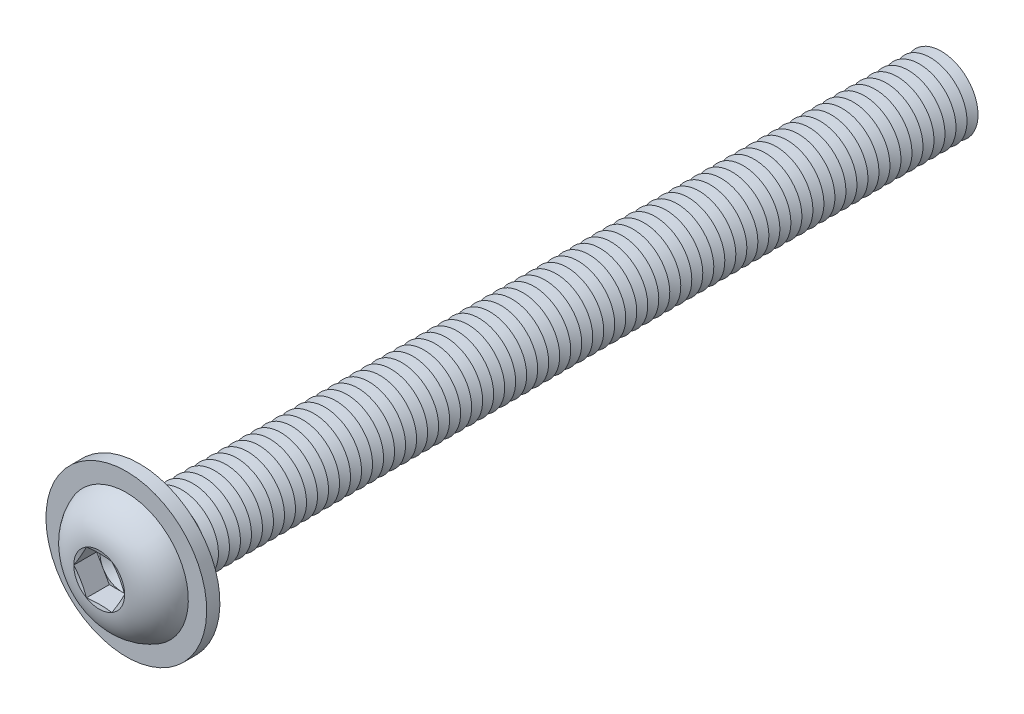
ISO-10303-21;
HEADER;
FILE_DESCRIPTION(('STEP AP214'),'2;1');
FILE_NAME('part.step','',(''),(''),'','','');
FILE_SCHEMA(('AUTOMOTIVE_DESIGN { 1 0 10303 214 1 1 1 1 }'));
ENDSEC;
DATA;
#1=APPLICATION_CONTEXT('core data for automotive mechanical design processes');
#2=APPLICATION_PROTOCOL_DEFINITION('international standard','automotive_design',2000,#1);
#3=PRODUCT_CONTEXT('',#1,'mechanical');
#4=PRODUCT('Part','Part','',(#3));
#5=PRODUCT_RELATED_PRODUCT_CATEGORY('part','',(#4));
#6=PRODUCT_DEFINITION_FORMATION('','',#4);
#7=PRODUCT_DEFINITION_CONTEXT('part definition',#1,'design');
#8=PRODUCT_DEFINITION('design','',#6,#7);
#9=PRODUCT_DEFINITION_SHAPE('','',#8);
#10=(LENGTH_UNIT() NAMED_UNIT(*) SI_UNIT(.MILLI.,.METRE.));
#11=(NAMED_UNIT(*) PLANE_ANGLE_UNIT() SI_UNIT($,.RADIAN.));
#12=(NAMED_UNIT(*) SI_UNIT($,.STERADIAN.) SOLID_ANGLE_UNIT());
#13=UNCERTAINTY_MEASURE_WITH_UNIT(LENGTH_MEASURE(1.E-05),#10,'distance_accuracy_value','');
#14=(GEOMETRIC_REPRESENTATION_CONTEXT(3) GLOBAL_UNCERTAINTY_ASSIGNED_CONTEXT((#13)) GLOBAL_UNIT_ASSIGNED_CONTEXT((#10,
#11,#12)) REPRESENTATION_CONTEXT('',''));
#15=CARTESIAN_POINT('',(0.,0.,0.));
#16=DIRECTION('',(0.,0.,1.));
#17=DIRECTION('',(1.,0.,0.));
#18=AXIS2_PLACEMENT_3D('',#15,#16,#17);
#19=CARTESIAN_POINT('',(0.,0.,-104.75));
#20=DIRECTION('',(0.,0.,1.));
#21=DIRECTION('',(0.,-1.,0.));
#22=AXIS2_PLACEMENT_3D('',#19,#20,#21);
#23=CONICAL_SURFACE('',#22,4.99999999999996,1.0471975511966);
#24=CARTESIAN_POINT('',(0.,0.,-105.5));
#25=DIRECTION('',(0.,0.,1.));
#26=DIRECTION('',(0.,-1.,0.));
#27=AXIS2_PLACEMENT_3D('',#24,#25,#26);
#28=CIRCLE('',#27,3.70096189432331);
#29=CARTESIAN_POINT('',(0.,-3.70096189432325,-105.5));
#30=VERTEX_POINT('',#29);
#31=EDGE_CURVE('E591',#30,#30,#28,.T.);
#32=ORIENTED_EDGE('',*,*,#31,.T.);
#33=EDGE_LOOP('',(#32));
#34=FACE_BOUND('',#33,.T.);
#35=CARTESIAN_POINT('',(0.,0.,-104.75));
#36=DIRECTION('',(0.,0.,1.));
#37=DIRECTION('',(0.,-1.,0.));
#38=AXIS2_PLACEMENT_3D('',#35,#36,#37);
#39=CIRCLE('',#38,4.99999999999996);
#40=CARTESIAN_POINT('',(0.,-4.99999999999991,-104.75));
#41=VERTEX_POINT('',#40);
#42=EDGE_CURVE('E587',#41,#41,#39,.T.);
#43=ORIENTED_EDGE('',*,*,#42,.F.);
#44=EDGE_LOOP('',(#43));
#45=FACE_BOUND('',#44,.T.);
#46=ADVANCED_FACE('F39',(#34,#45),#23,.T.);
#47=CARTESIAN_POINT('',(0.,0.,-105.5));
#48=DIRECTION('',(0.,0.,-1.));
#49=DIRECTION('',(0.,1.,0.));
#50=AXIS2_PLACEMENT_3D('',#47,#48,#49);
#51=CONICAL_SURFACE('',#50,3.70096189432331,1.0471975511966);
#52=CARTESIAN_POINT('',(0.,0.,-106.25));
#53=DIRECTION('',(0.,0.,1.));
#54=DIRECTION('',(0.,-1.,0.));
#55=AXIS2_PLACEMENT_3D('',#52,#53,#54);
#56=CIRCLE('',#55,4.99999999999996);
#57=CARTESIAN_POINT('',(0.,-4.99999999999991,-106.25));
#58=VERTEX_POINT('',#57);
#59=EDGE_CURVE('E594',#58,#58,#56,.T.);
#60=ORIENTED_EDGE('',*,*,#59,.T.);
#61=EDGE_LOOP('',(#60));
#62=FACE_BOUND('',#61,.T.);
#63=ORIENTED_EDGE('',*,*,#31,.F.);
#64=EDGE_LOOP('',(#63));
#65=FACE_BOUND('',#64,.T.);
#66=ADVANCED_FACE('F617',(#62,#65),#51,.T.);
#67=CARTESIAN_POINT('',(0.,4.99999999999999,-110.));
#68=DIRECTION('',(0.,0.,-1.));
#69=DIRECTION('',(0.,1.,0.));
#70=AXIS2_PLACEMENT_3D('',#67,#68,#69);
#71=PLANE('',#70);
#72=CARTESIAN_POINT('',(0.,0.,-110.));
#73=DIRECTION('',(0.,0.,1.));
#74=DIRECTION('',(0.,-1.,0.));
#75=AXIS2_PLACEMENT_3D('',#72,#73,#74);
#76=CIRCLE('',#75,3.70096189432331);
#77=CARTESIAN_POINT('',(0.,-3.70096189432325,-110.));
#78=VERTEX_POINT('',#77);
#79=EDGE_CURVE('E323',#78,#78,#76,.T.);
#80=ORIENTED_EDGE('',*,*,#79,.F.);
#81=EDGE_LOOP('',(#80));
#82=FACE_BOUND('',#81,.T.);
#83=ADVANCED_FACE('F615',(#82),#71,.T.);
#84=CARTESIAN_POINT('',(0.,0.,-109.25));
#85=DIRECTION('',(0.,0.,1.));
#86=DIRECTION('',(0.,-1.,0.));
#87=AXIS2_PLACEMENT_3D('',#84,#85,#86);
#88=CONICAL_SURFACE('',#87,4.99999999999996,1.0471975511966);
#89=ORIENTED_EDGE('',*,*,#79,.T.);
#90=EDGE_LOOP('',(#89));
#91=FACE_BOUND('',#90,.T.);
#92=CARTESIAN_POINT('',(0.,0.,-109.25));
#93=DIRECTION('',(0.,0.,1.));
#94=DIRECTION('',(0.,-1.,0.));
#95=AXIS2_PLACEMENT_3D('',#92,#93,#94);
#96=CIRCLE('',#95,4.99999999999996);
#97=CARTESIAN_POINT('',(0.,-4.99999999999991,-109.25));
#98=VERTEX_POINT('',#97);
#99=EDGE_CURVE('E478',#98,#98,#96,.T.);
#100=ORIENTED_EDGE('',*,*,#99,.F.);
#101=EDGE_LOOP('',(#100));
#102=FACE_BOUND('',#101,.T.);
#103=ADVANCED_FACE('F612',(#91,#102),#88,.T.);
#104=CARTESIAN_POINT('',(0.,0.,-108.5));
#105=DIRECTION('',(0.,0.,-1.));
#106=DIRECTION('',(0.,1.,0.));
#107=AXIS2_PLACEMENT_3D('',#104,#105,#106);
#108=CONICAL_SURFACE('',#107,3.70096189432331,1.0471975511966);
#109=ORIENTED_EDGE('',*,*,#99,.T.);
#110=EDGE_LOOP('',(#109));
#111=FACE_BOUND('',#110,.T.);
#112=CARTESIAN_POINT('',(0.,0.,-108.5));
#113=DIRECTION('',(0.,0.,1.));
#114=DIRECTION('',(0.,-1.,0.));
#115=AXIS2_PLACEMENT_3D('',#112,#113,#114);
#116=CIRCLE('',#115,3.70096189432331);
#117=CARTESIAN_POINT('',(0.,-3.70096189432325,-108.5));
#118=VERTEX_POINT('',#117);
#119=EDGE_CURVE('E475',#118,#118,#116,.T.);
#120=ORIENTED_EDGE('',*,*,#119,.F.);
#121=EDGE_LOOP('',(#120));
#122=FACE_BOUND('',#121,.T.);
#123=ADVANCED_FACE('F622',(#111,#122),#108,.T.);
#124=CARTESIAN_POINT('',(0.,0.,-107.75));
#125=DIRECTION('',(0.,0.,1.));
#126=DIRECTION('',(0.,-1.,0.));
#127=AXIS2_PLACEMENT_3D('',#124,#125,#126);
#128=CONICAL_SURFACE('',#127,4.99999999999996,1.0471975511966);
#129=ORIENTED_EDGE('',*,*,#119,.T.);
#130=EDGE_LOOP('',(#129));
#131=FACE_BOUND('',#130,.T.);
#132=CARTESIAN_POINT('',(0.,0.,-107.75));
#133=DIRECTION('',(0.,0.,1.));
#134=DIRECTION('',(0.,-1.,0.));
#135=AXIS2_PLACEMENT_3D('',#132,#133,#134);
#136=CIRCLE('',#135,4.99999999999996);
#137=CARTESIAN_POINT('',(0.,-4.99999999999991,-107.75));
#138=VERTEX_POINT('',#137);
#139=EDGE_CURVE('E479',#138,#138,#136,.T.);
#140=ORIENTED_EDGE('',*,*,#139,.F.);
#141=EDGE_LOOP('',(#140));
#142=FACE_BOUND('',#141,.T.);
#143=ADVANCED_FACE('F638',(#131,#142),#128,.T.);
#144=CARTESIAN_POINT('',(0.,0.,-107.));
#145=DIRECTION('',(0.,0.,-1.));
#146=DIRECTION('',(0.,1.,0.));
#147=AXIS2_PLACEMENT_3D('',#144,#145,#146);
#148=CONICAL_SURFACE('',#147,3.70096189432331,1.0471975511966);
#149=ORIENTED_EDGE('',*,*,#139,.T.);
#150=EDGE_LOOP('',(#149));
#151=FACE_BOUND('',#150,.T.);
#152=CARTESIAN_POINT('',(0.,0.,-107.));
#153=DIRECTION('',(0.,0.,1.));
#154=DIRECTION('',(0.,-1.,0.));
#155=AXIS2_PLACEMENT_3D('',#152,#153,#154);
#156=CIRCLE('',#155,3.70096189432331);
#157=CARTESIAN_POINT('',(0.,-3.70096189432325,-107.));
#158=VERTEX_POINT('',#157);
#159=EDGE_CURVE('E598',#158,#158,#156,.T.);
#160=ORIENTED_EDGE('',*,*,#159,.F.);
#161=EDGE_LOOP('',(#160));
#162=FACE_BOUND('',#161,.T.);
#163=ADVANCED_FACE('F634',(#151,#162),#148,.T.);
#164=CARTESIAN_POINT('',(0.,0.,-106.25));
#165=DIRECTION('',(0.,0.,1.));
#166=DIRECTION('',(0.,-1.,0.));
#167=AXIS2_PLACEMENT_3D('',#164,#165,#166);
#168=CONICAL_SURFACE('',#167,4.99999999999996,1.0471975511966);
#169=ORIENTED_EDGE('',*,*,#159,.T.);
#170=EDGE_LOOP('',(#169));
#171=FACE_BOUND('',#170,.T.);
#172=ORIENTED_EDGE('',*,*,#59,.F.);
#173=EDGE_LOOP('',(#172));
#174=FACE_BOUND('',#173,.T.);
#175=ADVANCED_FACE('F637',(#171,#174),#168,.T.);
#176=CARTESIAN_POINT('',(0.,0.,-103.25));
#177=DIRECTION('',(0.,0.,1.));
#178=DIRECTION('',(0.,-1.,0.));
#179=AXIS2_PLACEMENT_3D('',#176,#177,#178);
#180=CONICAL_SURFACE('',#179,4.99999999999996,1.0471975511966);
#181=CARTESIAN_POINT('',(0.,0.,-104.));
#182=DIRECTION('',(0.,0.,1.));
#183=DIRECTION('',(0.,-1.,0.));
#184=AXIS2_PLACEMENT_3D('',#181,#182,#183);
#185=CIRCLE('',#184,3.70096189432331);
#186=CARTESIAN_POINT('',(0.,-3.70096189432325,-104.));
#187=VERTEX_POINT('',#186);
#188=EDGE_CURVE('E583',#187,#187,#185,.T.);
#189=ORIENTED_EDGE('',*,*,#188,.T.);
#190=EDGE_LOOP('',(#189));
#191=FACE_BOUND('',#190,.T.);
#192=CARTESIAN_POINT('',(0.,0.,-103.25));
#193=DIRECTION('',(0.,0.,1.));
#194=DIRECTION('',(0.,-1.,0.));
#195=AXIS2_PLACEMENT_3D('',#192,#193,#194);
#196=CIRCLE('',#195,4.99999999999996);
#197=CARTESIAN_POINT('',(0.,-4.99999999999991,-103.25));
#198=VERTEX_POINT('',#197);
#199=EDGE_CURVE('E380',#198,#198,#196,.T.);
#200=ORIENTED_EDGE('',*,*,#199,.F.);
#201=EDGE_LOOP('',(#200));
#202=FACE_BOUND('',#201,.T.);
#203=ADVANCED_FACE('F642',(#191,#202),#180,.T.);
#204=CARTESIAN_POINT('',(0.,0.,-104.));
#205=DIRECTION('',(0.,0.,-1.));
#206=DIRECTION('',(0.,1.,0.));
#207=AXIS2_PLACEMENT_3D('',#204,#205,#206);
#208=CONICAL_SURFACE('',#207,3.70096189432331,1.0471975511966);
#209=ORIENTED_EDGE('',*,*,#42,.T.);
#210=EDGE_LOOP('',(#209));
#211=FACE_BOUND('',#210,.T.);
#212=ORIENTED_EDGE('',*,*,#188,.F.);
#213=EDGE_LOOP('',(#212));
#214=FACE_BOUND('',#213,.T.);
#215=ADVANCED_FACE('F674',(#211,#214),#208,.T.);
#216=CARTESIAN_POINT('',(0.,0.,-101.75));
#217=DIRECTION('',(0.,0.,1.));
#218=DIRECTION('',(0.,-1.,0.));
#219=AXIS2_PLACEMENT_3D('',#216,#217,#218);
#220=CONICAL_SURFACE('',#219,4.99999999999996,1.0471975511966);
#221=CARTESIAN_POINT('',(0.,0.,-102.5));
#222=DIRECTION('',(0.,0.,1.));
#223=DIRECTION('',(0.,-1.,0.));
#224=AXIS2_PLACEMENT_3D('',#221,#222,#223);
#225=CIRCLE('',#224,3.70096189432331);
#226=CARTESIAN_POINT('',(0.,-3.70096189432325,-102.5));
#227=VERTEX_POINT('',#226);
#228=EDGE_CURVE('E377',#227,#227,#225,.T.);
#229=ORIENTED_EDGE('',*,*,#228,.T.);
#230=EDGE_LOOP('',(#229));
#231=FACE_BOUND('',#230,.T.);
#232=CARTESIAN_POINT('',(0.,0.,-101.75));
#233=DIRECTION('',(0.,0.,1.));
#234=DIRECTION('',(0.,-1.,0.));
#235=AXIS2_PLACEMENT_3D('',#232,#233,#234);
#236=CIRCLE('',#235,4.99999999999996);
#237=CARTESIAN_POINT('',(0.,-4.99999999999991,-101.75));
#238=VERTEX_POINT('',#237);
#239=EDGE_CURVE('E381',#238,#238,#236,.T.);
#240=ORIENTED_EDGE('',*,*,#239,.F.);
#241=EDGE_LOOP('',(#240));
#242=FACE_BOUND('',#241,.T.);
#243=ADVANCED_FACE('F680',(#231,#242),#220,.T.);
#244=CARTESIAN_POINT('',(0.,0.,-102.5));
#245=DIRECTION('',(0.,0.,-1.));
#246=DIRECTION('',(0.,1.,0.));
#247=AXIS2_PLACEMENT_3D('',#244,#245,#246);
#248=CONICAL_SURFACE('',#247,3.70096189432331,1.0471975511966);
#249=ORIENTED_EDGE('',*,*,#199,.T.);
#250=EDGE_LOOP('',(#249));
#251=FACE_BOUND('',#250,.T.);
#252=ORIENTED_EDGE('',*,*,#228,.F.);
#253=EDGE_LOOP('',(#252));
#254=FACE_BOUND('',#253,.T.);
#255=ADVANCED_FACE('F687',(#251,#254),#248,.T.);
#256=CARTESIAN_POINT('',(0.,0.,-100.25));
#257=DIRECTION('',(0.,0.,1.));
#258=DIRECTION('',(0.,-1.,0.));
#259=AXIS2_PLACEMENT_3D('',#256,#257,#258);
#260=CONICAL_SURFACE('',#259,4.99999999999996,1.0471975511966);
#261=CARTESIAN_POINT('',(0.,0.,-101.));
#262=DIRECTION('',(0.,0.,1.));
#263=DIRECTION('',(0.,-1.,0.));
#264=AXIS2_PLACEMENT_3D('',#261,#262,#263);
#265=CIRCLE('',#264,3.70096189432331);
#266=CARTESIAN_POINT('',(0.,-3.70096189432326,-101.));
#267=VERTEX_POINT('',#266);
#268=EDGE_CURVE('E517',#267,#267,#265,.T.);
#269=ORIENTED_EDGE('',*,*,#268,.T.);
#270=EDGE_LOOP('',(#269));
#271=FACE_BOUND('',#270,.T.);
#272=CARTESIAN_POINT('',(0.,0.,-100.25));
#273=DIRECTION('',(0.,0.,1.));
#274=DIRECTION('',(0.,-1.,0.));
#275=AXIS2_PLACEMENT_3D('',#272,#273,#274);
#276=CIRCLE('',#275,4.99999999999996);
#277=CARTESIAN_POINT('',(0.,-4.99999999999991,-100.25));
#278=VERTEX_POINT('',#277);
#279=EDGE_CURVE('E519',#278,#278,#276,.T.);
#280=ORIENTED_EDGE('',*,*,#279,.F.);
#281=EDGE_LOOP('',(#280));
#282=FACE_BOUND('',#281,.T.);
#283=ADVANCED_FACE('F694',(#271,#282),#260,.T.);
#284=CARTESIAN_POINT('',(0.,0.,-101.));
#285=DIRECTION('',(0.,0.,-1.));
#286=DIRECTION('',(0.,1.,0.));
#287=AXIS2_PLACEMENT_3D('',#284,#285,#286);
#288=CONICAL_SURFACE('',#287,3.70096189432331,1.0471975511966);
#289=ORIENTED_EDGE('',*,*,#239,.T.);
#290=EDGE_LOOP('',(#289));
#291=FACE_BOUND('',#290,.T.);
#292=ORIENTED_EDGE('',*,*,#268,.F.);
#293=EDGE_LOOP('',(#292));
#294=FACE_BOUND('',#293,.T.);
#295=ADVANCED_FACE('F701',(#291,#294),#288,.T.);
#296=CARTESIAN_POINT('',(0.,0.,-98.75));
#297=DIRECTION('',(0.,0.,1.));
#298=DIRECTION('',(0.,-1.,0.));
#299=AXIS2_PLACEMENT_3D('',#296,#297,#298);
#300=CONICAL_SURFACE('',#299,4.99999999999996,1.0471975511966);
#301=CARTESIAN_POINT('',(0.,0.,-99.5));
#302=DIRECTION('',(0.,0.,1.));
#303=DIRECTION('',(0.,-1.,0.));
#304=AXIS2_PLACEMENT_3D('',#301,#302,#303);
#305=CIRCLE('',#304,3.70096189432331);
#306=CARTESIAN_POINT('',(0.,-3.70096189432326,-99.5));
#307=VERTEX_POINT('',#306);
#308=EDGE_CURVE('E570',#307,#307,#305,.T.);
#309=ORIENTED_EDGE('',*,*,#308,.T.);
#310=EDGE_LOOP('',(#309));
#311=FACE_BOUND('',#310,.T.);
#312=CARTESIAN_POINT('',(0.,0.,-98.75));
#313=DIRECTION('',(0.,0.,1.));
#314=DIRECTION('',(0.,-1.,0.));
#315=AXIS2_PLACEMENT_3D('',#312,#313,#314);
#316=CIRCLE('',#315,4.99999999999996);
#317=CARTESIAN_POINT('',(0.,-4.99999999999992,-98.75));
#318=VERTEX_POINT('',#317);
#319=EDGE_CURVE('E421',#318,#318,#316,.T.);
#320=ORIENTED_EDGE('',*,*,#319,.F.);
#321=EDGE_LOOP('',(#320));
#322=FACE_BOUND('',#321,.T.);
#323=ADVANCED_FACE('F708',(#311,#322),#300,.T.);
#324=CARTESIAN_POINT('',(0.,0.,-99.5));
#325=DIRECTION('',(0.,0.,-1.));
#326=DIRECTION('',(0.,1.,0.));
#327=AXIS2_PLACEMENT_3D('',#324,#325,#326);
#328=CONICAL_SURFACE('',#327,3.70096189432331,1.0471975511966);
#329=ORIENTED_EDGE('',*,*,#279,.T.);
#330=EDGE_LOOP('',(#329));
#331=FACE_BOUND('',#330,.T.);
#332=ORIENTED_EDGE('',*,*,#308,.F.);
#333=EDGE_LOOP('',(#332));
#334=FACE_BOUND('',#333,.T.);
#335=ADVANCED_FACE('F715',(#331,#334),#328,.T.);
#336=CARTESIAN_POINT('',(0.,0.,-97.25));
#337=DIRECTION('',(0.,0.,1.));
#338=DIRECTION('',(0.,-1.,0.));
#339=AXIS2_PLACEMENT_3D('',#336,#337,#338);
#340=CONICAL_SURFACE('',#339,4.99999999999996,1.0471975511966);
#341=CARTESIAN_POINT('',(0.,0.,-98.));
#342=DIRECTION('',(0.,0.,1.));
#343=DIRECTION('',(0.,-1.,0.));
#344=AXIS2_PLACEMENT_3D('',#341,#342,#343);
#345=CIRCLE('',#344,3.70096189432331);
#346=CARTESIAN_POINT('',(0.,-3.70096189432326,-98.));
#347=VERTEX_POINT('',#346);
#348=EDGE_CURVE('E418',#347,#347,#345,.T.);
#349=ORIENTED_EDGE('',*,*,#348,.T.);
#350=EDGE_LOOP('',(#349));
#351=FACE_BOUND('',#350,.T.);
#352=CARTESIAN_POINT('',(0.,0.,-97.25));
#353=DIRECTION('',(0.,0.,1.));
#354=DIRECTION('',(0.,-1.,0.));
#355=AXIS2_PLACEMENT_3D('',#352,#353,#354);
#356=CIRCLE('',#355,4.99999999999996);
#357=CARTESIAN_POINT('',(0.,-4.99999999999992,-97.25));
#358=VERTEX_POINT('',#357);
#359=EDGE_CURVE('E422',#358,#358,#356,.T.);
#360=ORIENTED_EDGE('',*,*,#359,.F.);
#361=EDGE_LOOP('',(#360));
#362=FACE_BOUND('',#361,.T.);
#363=ADVANCED_FACE('F722',(#351,#362),#340,.T.);
#364=CARTESIAN_POINT('',(0.,0.,-98.));
#365=DIRECTION('',(0.,0.,-1.));
#366=DIRECTION('',(0.,1.,0.));
#367=AXIS2_PLACEMENT_3D('',#364,#365,#366);
#368=CONICAL_SURFACE('',#367,3.70096189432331,1.0471975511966);
#369=ORIENTED_EDGE('',*,*,#319,.T.);
#370=EDGE_LOOP('',(#369));
#371=FACE_BOUND('',#370,.T.);
#372=ORIENTED_EDGE('',*,*,#348,.F.);
#373=EDGE_LOOP('',(#372));
#374=FACE_BOUND('',#373,.T.);
#375=ADVANCED_FACE('F729',(#371,#374),#368,.T.);
#376=CARTESIAN_POINT('',(0.,0.,-95.75));
#377=DIRECTION('',(0.,0.,1.));
#378=DIRECTION('',(0.,-1.,0.));
#379=AXIS2_PLACEMENT_3D('',#376,#377,#378);
#380=CONICAL_SURFACE('',#379,4.99999999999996,1.0471975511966);
#381=CARTESIAN_POINT('',(0.,0.,-96.5));
#382=DIRECTION('',(0.,0.,1.));
#383=DIRECTION('',(0.,-1.,0.));
#384=AXIS2_PLACEMENT_3D('',#381,#382,#383);
#385=CIRCLE('',#384,3.70096189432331);
#386=CARTESIAN_POINT('',(0.,-3.70096189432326,-96.5));
#387=VERTEX_POINT('',#386);
#388=EDGE_CURVE('E512',#387,#387,#385,.T.);
#389=ORIENTED_EDGE('',*,*,#388,.T.);
#390=EDGE_LOOP('',(#389));
#391=FACE_BOUND('',#390,.T.);
#392=CARTESIAN_POINT('',(0.,0.,-95.75));
#393=DIRECTION('',(0.,0.,1.));
#394=DIRECTION('',(0.,-1.,0.));
#395=AXIS2_PLACEMENT_3D('',#392,#393,#394);
#396=CIRCLE('',#395,4.99999999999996);
#397=CARTESIAN_POINT('',(0.,-4.99999999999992,-95.75));
#398=VERTEX_POINT('',#397);
#399=EDGE_CURVE('E509',#398,#398,#396,.T.);
#400=ORIENTED_EDGE('',*,*,#399,.F.);
#401=EDGE_LOOP('',(#400));
#402=FACE_BOUND('',#401,.T.);
#403=ADVANCED_FACE('F736',(#391,#402),#380,.T.);
#404=CARTESIAN_POINT('',(0.,0.,-96.5));
#405=DIRECTION('',(0.,0.,-1.));
#406=DIRECTION('',(0.,1.,0.));
#407=AXIS2_PLACEMENT_3D('',#404,#405,#406);
#408=CONICAL_SURFACE('',#407,3.70096189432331,1.0471975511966);
#409=ORIENTED_EDGE('',*,*,#359,.T.);
#410=EDGE_LOOP('',(#409));
#411=FACE_BOUND('',#410,.T.);
#412=ORIENTED_EDGE('',*,*,#388,.F.);
#413=EDGE_LOOP('',(#412));
#414=FACE_BOUND('',#413,.T.);
#415=ADVANCED_FACE('F743',(#411,#414),#408,.T.);
#416=CARTESIAN_POINT('',(0.,0.,-94.25));
#417=DIRECTION('',(0.,0.,1.));
#418=DIRECTION('',(0.,-1.,0.));
#419=AXIS2_PLACEMENT_3D('',#416,#417,#418);
#420=CONICAL_SURFACE('',#419,4.99999999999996,1.0471975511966);
#421=CARTESIAN_POINT('',(0.,0.,-95.));
#422=DIRECTION('',(0.,0.,1.));
#423=DIRECTION('',(0.,-1.,0.));
#424=AXIS2_PLACEMENT_3D('',#421,#422,#423);
#425=CIRCLE('',#424,3.70096189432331);
#426=CARTESIAN_POINT('',(0.,-3.70096189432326,-95.));
#427=VERTEX_POINT('',#426);
#428=EDGE_CURVE('E328',#427,#427,#425,.T.);
#429=ORIENTED_EDGE('',*,*,#428,.T.);
#430=EDGE_LOOP('',(#429));
#431=FACE_BOUND('',#430,.T.);
#432=CARTESIAN_POINT('',(0.,0.,-94.25));
#433=DIRECTION('',(0.,0.,1.));
#434=DIRECTION('',(0.,-1.,0.));
#435=AXIS2_PLACEMENT_3D('',#432,#433,#434);
#436=CIRCLE('',#435,4.99999999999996);
#437=CARTESIAN_POINT('',(0.,-4.99999999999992,-94.25));
#438=VERTEX_POINT('',#437);
#439=EDGE_CURVE('E2516',#438,#438,#436,.T.);
#440=ORIENTED_EDGE('',*,*,#439,.F.);
#441=EDGE_LOOP('',(#440));
#442=FACE_BOUND('',#441,.T.);
#443=ADVANCED_FACE('F750',(#431,#442),#420,.T.);
#444=CARTESIAN_POINT('',(0.,0.,-95.));
#445=DIRECTION('',(0.,0.,-1.));
#446=DIRECTION('',(0.,1.,0.));
#447=AXIS2_PLACEMENT_3D('',#444,#445,#446);
#448=CONICAL_SURFACE('',#447,3.70096189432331,1.0471975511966);
#449=ORIENTED_EDGE('',*,*,#399,.T.);
#450=EDGE_LOOP('',(#449));
#451=FACE_BOUND('',#450,.T.);
#452=ORIENTED_EDGE('',*,*,#428,.F.);
#453=EDGE_LOOP('',(#452));
#454=FACE_BOUND('',#453,.T.);
#455=ADVANCED_FACE('F756',(#451,#454),#448,.T.);
#456=CARTESIAN_POINT('',(0.,0.,-92.75));
#457=DIRECTION('',(0.,0.,1.));
#458=DIRECTION('',(0.,-1.,0.));
#459=AXIS2_PLACEMENT_3D('',#456,#457,#458);
#460=CONICAL_SURFACE('',#459,4.99999999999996,1.0471975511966);
#461=CARTESIAN_POINT('',(0.,0.,-93.5));
#462=DIRECTION('',(0.,0.,1.));
#463=DIRECTION('',(0.,-1.,0.));
#464=AXIS2_PLACEMENT_3D('',#461,#462,#463);
#465=CIRCLE('',#464,3.70096189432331);
#466=CARTESIAN_POINT('',(0.,-3.70096189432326,-93.5));
#467=VERTEX_POINT('',#466);
#468=EDGE_CURVE('E559',#467,#467,#465,.T.);
#469=ORIENTED_EDGE('',*,*,#468,.T.);
#470=EDGE_LOOP('',(#469));
#471=FACE_BOUND('',#470,.T.);
#472=CARTESIAN_POINT('',(0.,0.,-92.75));
#473=DIRECTION('',(0.,0.,1.));
#474=DIRECTION('',(0.,-1.,0.));
#475=AXIS2_PLACEMENT_3D('',#472,#473,#474);
#476=CIRCLE('',#475,4.99999999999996);
#477=CARTESIAN_POINT('',(0.,-4.99999999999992,-92.75));
#478=VERTEX_POINT('',#477);
#479=EDGE_CURVE('E556',#478,#478,#476,.T.);
#480=ORIENTED_EDGE('',*,*,#479,.F.);
#481=EDGE_LOOP('',(#480));
#482=FACE_BOUND('',#481,.T.);
#483=ADVANCED_FACE('F763',(#471,#482),#460,.T.);
#484=CARTESIAN_POINT('',(0.,0.,-93.5));
#485=DIRECTION('',(0.,0.,-1.));
#486=DIRECTION('',(0.,1.,0.));
#487=AXIS2_PLACEMENT_3D('',#484,#485,#486);
#488=CONICAL_SURFACE('',#487,3.70096189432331,1.0471975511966);
#489=ORIENTED_EDGE('',*,*,#439,.T.);
#490=EDGE_LOOP('',(#489));
#491=FACE_BOUND('',#490,.T.);
#492=ORIENTED_EDGE('',*,*,#468,.F.);
#493=EDGE_LOOP('',(#492));
#494=FACE_BOUND('',#493,.T.);
#495=ADVANCED_FACE('F770',(#491,#494),#488,.T.);
#496=CARTESIAN_POINT('',(0.,0.,-91.25));
#497=DIRECTION('',(0.,0.,1.));
#498=DIRECTION('',(0.,-1.,0.));
#499=AXIS2_PLACEMENT_3D('',#496,#497,#498);
#500=CONICAL_SURFACE('',#499,4.99999999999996,1.0471975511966);
#501=CARTESIAN_POINT('',(0.,0.,-92.));
#502=DIRECTION('',(0.,0.,1.));
#503=DIRECTION('',(0.,-1.,0.));
#504=AXIS2_PLACEMENT_3D('',#501,#502,#503);
#505=CIRCLE('',#504,3.70096189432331);
#506=CARTESIAN_POINT('',(0.,-3.70096189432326,-92.));
#507=VERTEX_POINT('',#506);
#508=EDGE_CURVE('E560',#507,#507,#505,.T.);
#509=ORIENTED_EDGE('',*,*,#508,.T.);
#510=EDGE_LOOP('',(#509));
#511=FACE_BOUND('',#510,.T.);
#512=CARTESIAN_POINT('',(0.,0.,-91.25));
#513=DIRECTION('',(0.,0.,1.));
#514=DIRECTION('',(0.,-1.,0.));
#515=AXIS2_PLACEMENT_3D('',#512,#513,#514);
#516=CIRCLE('',#515,4.99999999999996);
#517=CARTESIAN_POINT('',(0.,-4.99999999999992,-91.25));
#518=VERTEX_POINT('',#517);
#519=EDGE_CURVE('E374',#518,#518,#516,.T.);
#520=ORIENTED_EDGE('',*,*,#519,.F.);
#521=EDGE_LOOP('',(#520));
#522=FACE_BOUND('',#521,.T.);
#523=ADVANCED_FACE('F777',(#511,#522),#500,.T.);
#524=CARTESIAN_POINT('',(0.,0.,-92.));
#525=DIRECTION('',(0.,0.,-1.));
#526=DIRECTION('',(0.,1.,0.));
#527=AXIS2_PLACEMENT_3D('',#524,#525,#526);
#528=CONICAL_SURFACE('',#527,3.70096189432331,1.0471975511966);
#529=ORIENTED_EDGE('',*,*,#479,.T.);
#530=EDGE_LOOP('',(#529));
#531=FACE_BOUND('',#530,.T.);
#532=ORIENTED_EDGE('',*,*,#508,.F.);
#533=EDGE_LOOP('',(#532));
#534=FACE_BOUND('',#533,.T.);
#535=ADVANCED_FACE('F784',(#531,#534),#528,.T.);
#536=CARTESIAN_POINT('',(0.,0.,-89.75));
#537=DIRECTION('',(0.,0.,1.));
#538=DIRECTION('',(0.,-1.,0.));
#539=AXIS2_PLACEMENT_3D('',#536,#537,#538);
#540=CONICAL_SURFACE('',#539,4.99999999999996,1.0471975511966);
#541=CARTESIAN_POINT('',(0.,0.,-90.5));
#542=DIRECTION('',(0.,0.,1.));
#543=DIRECTION('',(0.,-1.,0.));
#544=AXIS2_PLACEMENT_3D('',#541,#542,#543);
#545=CIRCLE('',#544,3.70096189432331);
#546=CARTESIAN_POINT('',(0.,-3.70096189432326,-90.5));
#547=VERTEX_POINT('',#546);
#548=EDGE_CURVE('E371',#547,#547,#545,.T.);
#549=ORIENTED_EDGE('',*,*,#548,.T.);
#550=EDGE_LOOP('',(#549));
#551=FACE_BOUND('',#550,.T.);
#552=CARTESIAN_POINT('',(0.,0.,-89.75));
#553=DIRECTION('',(0.,0.,1.));
#554=DIRECTION('',(0.,-1.,0.));
#555=AXIS2_PLACEMENT_3D('',#552,#553,#554);
#556=CIRCLE('',#555,4.99999999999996);
#557=CARTESIAN_POINT('',(0.,-4.99999999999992,-89.75));
#558=VERTEX_POINT('',#557);
#559=EDGE_CURVE('E375',#558,#558,#556,.T.);
#560=ORIENTED_EDGE('',*,*,#559,.F.);
#561=EDGE_LOOP('',(#560));
#562=FACE_BOUND('',#561,.T.);
#563=ADVANCED_FACE('F791',(#551,#562),#540,.T.);
#564=CARTESIAN_POINT('',(0.,0.,-90.5));
#565=DIRECTION('',(0.,0.,-1.));
#566=DIRECTION('',(0.,1.,0.));
#567=AXIS2_PLACEMENT_3D('',#564,#565,#566);
#568=CONICAL_SURFACE('',#567,3.70096189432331,1.0471975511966);
#569=ORIENTED_EDGE('',*,*,#519,.T.);
#570=EDGE_LOOP('',(#569));
#571=FACE_BOUND('',#570,.T.);
#572=ORIENTED_EDGE('',*,*,#548,.F.);
#573=EDGE_LOOP('',(#572));
#574=FACE_BOUND('',#573,.T.);
#575=ADVANCED_FACE('F798',(#571,#574),#568,.T.);
#576=CARTESIAN_POINT('',(0.,0.,-88.25));
#577=DIRECTION('',(0.,0.,1.));
#578=DIRECTION('',(0.,-1.,0.));
#579=AXIS2_PLACEMENT_3D('',#576,#577,#578);
#580=CONICAL_SURFACE('',#579,4.99999999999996,1.0471975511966);
#581=CARTESIAN_POINT('',(0.,0.,-89.));
#582=DIRECTION('',(0.,0.,1.));
#583=DIRECTION('',(0.,-1.,0.));
#584=AXIS2_PLACEMENT_3D('',#581,#582,#583);
#585=CIRCLE('',#584,3.70096189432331);
#586=CARTESIAN_POINT('',(0.,-3.70096189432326,-89.));
#587=VERTEX_POINT('',#586);
#588=EDGE_CURVE('E473',#587,#587,#585,.T.);
#589=ORIENTED_EDGE('',*,*,#588,.T.);
#590=EDGE_LOOP('',(#589));
#591=FACE_BOUND('',#590,.T.);
#592=CARTESIAN_POINT('',(0.,0.,-88.2500000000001));
#593=DIRECTION('',(0.,0.,1.));
#594=DIRECTION('',(0.,-1.,0.));
#595=AXIS2_PLACEMENT_3D('',#592,#593,#594);
#596=CIRCLE('',#595,4.99999999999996);
#597=CARTESIAN_POINT('',(0.,-4.99999999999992,-88.2500000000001));
#598=VERTEX_POINT('',#597);
#599=EDGE_CURVE('E468',#598,#598,#596,.T.);
#600=ORIENTED_EDGE('',*,*,#599,.F.);
#601=EDGE_LOOP('',(#600));
#602=FACE_BOUND('',#601,.T.);
#603=ADVANCED_FACE('F805',(#591,#602),#580,.T.);
#604=CARTESIAN_POINT('',(0.,0.,-89.));
#605=DIRECTION('',(0.,0.,-1.));
#606=DIRECTION('',(0.,1.,0.));
#607=AXIS2_PLACEMENT_3D('',#604,#605,#606);
#608=CONICAL_SURFACE('',#607,3.70096189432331,1.0471975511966);
#609=ORIENTED_EDGE('',*,*,#559,.T.);
#610=EDGE_LOOP('',(#609));
#611=FACE_BOUND('',#610,.T.);
#612=ORIENTED_EDGE('',*,*,#588,.F.);
#613=EDGE_LOOP('',(#612));
#614=FACE_BOUND('',#613,.T.);
#615=ADVANCED_FACE('F812',(#611,#614),#608,.T.);
#616=CARTESIAN_POINT('',(0.,0.,-86.75));
#617=DIRECTION('',(0.,0.,1.));
#618=DIRECTION('',(0.,-1.,0.));
#619=AXIS2_PLACEMENT_3D('',#616,#617,#618);
#620=CONICAL_SURFACE('',#619,4.99999999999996,1.0471975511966);
#621=CARTESIAN_POINT('',(0.,0.,-87.5000000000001));
#622=DIRECTION('',(0.,0.,1.));
#623=DIRECTION('',(0.,-1.,0.));
#624=AXIS2_PLACEMENT_3D('',#621,#622,#623);
#625=CIRCLE('',#624,3.70096189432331);
#626=CARTESIAN_POINT('',(0.,-3.70096189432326,-87.5000000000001));
#627=VERTEX_POINT('',#626);
#628=EDGE_CURVE('E465',#627,#627,#625,.T.);
#629=ORIENTED_EDGE('',*,*,#628,.T.);
#630=EDGE_LOOP('',(#629));
#631=FACE_BOUND('',#630,.T.);
#632=CARTESIAN_POINT('',(0.,0.,-86.75));
#633=DIRECTION('',(0.,0.,1.));
#634=DIRECTION('',(0.,-1.,0.));
#635=AXIS2_PLACEMENT_3D('',#632,#633,#634);
#636=CIRCLE('',#635,4.99999999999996);
#637=CARTESIAN_POINT('',(0.,-4.99999999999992,-86.75));
#638=VERTEX_POINT('',#637);
#639=EDGE_CURVE('E469',#638,#638,#636,.T.);
#640=ORIENTED_EDGE('',*,*,#639,.F.);
#641=EDGE_LOOP('',(#640));
#642=FACE_BOUND('',#641,.T.);
#643=ADVANCED_FACE('F819',(#631,#642),#620,.T.);
#644=CARTESIAN_POINT('',(0.,0.,-87.5000000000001));
#645=DIRECTION('',(0.,0.,-1.));
#646=DIRECTION('',(0.,1.,0.));
#647=AXIS2_PLACEMENT_3D('',#644,#645,#646);
#648=CONICAL_SURFACE('',#647,3.70096189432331,1.0471975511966);
#649=ORIENTED_EDGE('',*,*,#599,.T.);
#650=EDGE_LOOP('',(#649));
#651=FACE_BOUND('',#650,.T.);
#652=ORIENTED_EDGE('',*,*,#628,.F.);
#653=EDGE_LOOP('',(#652));
#654=FACE_BOUND('',#653,.T.);
#655=ADVANCED_FACE('F826',(#651,#654),#648,.T.);
#656=CARTESIAN_POINT('',(0.,0.,-85.25));
#657=DIRECTION('',(0.,0.,1.));
#658=DIRECTION('',(0.,-1.,0.));
#659=AXIS2_PLACEMENT_3D('',#656,#657,#658);
#660=CONICAL_SURFACE('',#659,4.99999999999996,1.0471975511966);
#661=CARTESIAN_POINT('',(0.,0.,-86.));
#662=DIRECTION('',(0.,0.,1.));
#663=DIRECTION('',(0.,-1.,0.));
#664=AXIS2_PLACEMENT_3D('',#661,#662,#663);
#665=CIRCLE('',#664,3.70096189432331);
#666=CARTESIAN_POINT('',(0.,-3.70096189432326,-86.));
#667=VERTEX_POINT('',#666);
#668=EDGE_CURVE('E2495',#667,#667,#665,.T.);
#669=ORIENTED_EDGE('',*,*,#668,.T.);
#670=EDGE_LOOP('',(#669));
#671=FACE_BOUND('',#670,.T.);
#672=CARTESIAN_POINT('',(0.,0.,-85.25));
#673=DIRECTION('',(0.,0.,1.));
#674=DIRECTION('',(0.,-1.,0.));
#675=AXIS2_PLACEMENT_3D('',#672,#673,#674);
#676=CIRCLE('',#675,4.99999999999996);
#677=CARTESIAN_POINT('',(0.,-4.99999999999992,-85.25));
#678=VERTEX_POINT('',#677);
#679=EDGE_CURVE('E2500',#678,#678,#676,.T.);
#680=ORIENTED_EDGE('',*,*,#679,.F.);
#681=EDGE_LOOP('',(#680));
#682=FACE_BOUND('',#681,.T.);
#683=ADVANCED_FACE('F833',(#671,#682),#660,.T.);
#684=CARTESIAN_POINT('',(0.,0.,-86.));
#685=DIRECTION('',(0.,0.,-1.));
#686=DIRECTION('',(0.,1.,0.));
#687=AXIS2_PLACEMENT_3D('',#684,#685,#686);
#688=CONICAL_SURFACE('',#687,3.70096189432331,1.0471975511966);
#689=ORIENTED_EDGE('',*,*,#639,.T.);
#690=EDGE_LOOP('',(#689));
#691=FACE_BOUND('',#690,.T.);
#692=ORIENTED_EDGE('',*,*,#668,.F.);
#693=EDGE_LOOP('',(#692));
#694=FACE_BOUND('',#693,.T.);
#695=ADVANCED_FACE('F840',(#691,#694),#688,.T.);
#696=CARTESIAN_POINT('',(0.,0.,-83.75));
#697=DIRECTION('',(0.,0.,1.));
#698=DIRECTION('',(0.,-1.,0.));
#699=AXIS2_PLACEMENT_3D('',#696,#697,#698);
#700=CONICAL_SURFACE('',#699,4.99999999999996,1.0471975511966);
#701=CARTESIAN_POINT('',(0.,0.,-84.5));
#702=DIRECTION('',(0.,0.,1.));
#703=DIRECTION('',(0.,-1.,0.));
#704=AXIS2_PLACEMENT_3D('',#701,#702,#703);
#705=CIRCLE('',#704,3.70096189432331);
#706=CARTESIAN_POINT('',(0.,-3.70096189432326,-84.5));
#707=VERTEX_POINT('',#706);
#708=EDGE_CURVE('E2791',#707,#707,#705,.T.);
#709=ORIENTED_EDGE('',*,*,#708,.T.);
#710=EDGE_LOOP('',(#709));
#711=FACE_BOUND('',#710,.T.);
#712=CARTESIAN_POINT('',(0.,0.,-83.75));
#713=DIRECTION('',(0.,0.,1.));
#714=DIRECTION('',(0.,-1.,0.));
#715=AXIS2_PLACEMENT_3D('',#712,#713,#714);
#716=CIRCLE('',#715,4.99999999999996);
#717=CARTESIAN_POINT('',(0.,-4.99999999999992,-83.75));
#718=VERTEX_POINT('',#717);
#719=EDGE_CURVE('E2787',#718,#718,#716,.T.);
#720=ORIENTED_EDGE('',*,*,#719,.F.);
#721=EDGE_LOOP('',(#720));
#722=FACE_BOUND('',#721,.T.);
#723=ADVANCED_FACE('F847',(#711,#722),#700,.T.);
#724=CARTESIAN_POINT('',(0.,0.,-84.5));
#725=DIRECTION('',(0.,0.,-1.));
#726=DIRECTION('',(0.,1.,0.));
#727=AXIS2_PLACEMENT_3D('',#724,#725,#726);
#728=CONICAL_SURFACE('',#727,3.70096189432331,1.0471975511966);
#729=ORIENTED_EDGE('',*,*,#679,.T.);
#730=EDGE_LOOP('',(#729));
#731=FACE_BOUND('',#730,.T.);
#732=ORIENTED_EDGE('',*,*,#708,.F.);
#733=EDGE_LOOP('',(#732));
#734=FACE_BOUND('',#733,.T.);
#735=ADVANCED_FACE('F854',(#731,#734),#728,.T.);
#736=CARTESIAN_POINT('',(0.,0.,-82.25));
#737=DIRECTION('',(0.,0.,1.));
#738=DIRECTION('',(0.,-1.,0.));
#739=AXIS2_PLACEMENT_3D('',#736,#737,#738);
#740=CONICAL_SURFACE('',#739,4.99999999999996,1.0471975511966);
#741=CARTESIAN_POINT('',(0.,0.,-83.));
#742=DIRECTION('',(0.,0.,1.));
#743=DIRECTION('',(0.,-1.,0.));
#744=AXIS2_PLACEMENT_3D('',#741,#742,#743);
#745=CIRCLE('',#744,3.70096189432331);
#746=CARTESIAN_POINT('',(0.,-3.70096189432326,-83.));
#747=VERTEX_POINT('',#746);
#748=EDGE_CURVE('E2578',#747,#747,#745,.T.);
#749=ORIENTED_EDGE('',*,*,#748,.T.);
#750=EDGE_LOOP('',(#749));
#751=FACE_BOUND('',#750,.T.);
#752=CARTESIAN_POINT('',(0.,0.,-82.25));
#753=DIRECTION('',(0.,0.,1.));
#754=DIRECTION('',(0.,-1.,0.));
#755=AXIS2_PLACEMENT_3D('',#752,#753,#754);
#756=CIRCLE('',#755,4.99999999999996);
#757=CARTESIAN_POINT('',(0.,-4.99999999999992,-82.25));
#758=VERTEX_POINT('',#757);
#759=EDGE_CURVE('E416',#758,#758,#756,.T.);
#760=ORIENTED_EDGE('',*,*,#759,.F.);
#761=EDGE_LOOP('',(#760));
#762=FACE_BOUND('',#761,.T.);
#763=ADVANCED_FACE('F861',(#751,#762),#740,.T.);
#764=CARTESIAN_POINT('',(0.,0.,-83.));
#765=DIRECTION('',(0.,0.,-1.));
#766=DIRECTION('',(0.,1.,0.));
#767=AXIS2_PLACEMENT_3D('',#764,#765,#766);
#768=CONICAL_SURFACE('',#767,3.70096189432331,1.0471975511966);
#769=ORIENTED_EDGE('',*,*,#719,.T.);
#770=EDGE_LOOP('',(#769));
#771=FACE_BOUND('',#770,.T.);
#772=ORIENTED_EDGE('',*,*,#748,.F.);
#773=EDGE_LOOP('',(#772));
#774=FACE_BOUND('',#773,.T.);
#775=ADVANCED_FACE('F868',(#771,#774),#768,.T.);
#776=CARTESIAN_POINT('',(0.,0.,-80.75));
#777=DIRECTION('',(0.,0.,1.));
#778=DIRECTION('',(0.,-1.,0.));
#779=AXIS2_PLACEMENT_3D('',#776,#777,#778);
#780=CONICAL_SURFACE('',#779,4.99999999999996,1.0471975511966);
#781=CARTESIAN_POINT('',(0.,0.,-81.5));
#782=DIRECTION('',(0.,0.,1.));
#783=DIRECTION('',(0.,-1.,0.));
#784=AXIS2_PLACEMENT_3D('',#781,#782,#783);
#785=CIRCLE('',#784,3.70096189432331);
#786=CARTESIAN_POINT('',(0.,-3.70096189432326,-81.5));
#787=VERTEX_POINT('',#786);
#788=EDGE_CURVE('E413',#787,#787,#785,.T.);
#789=ORIENTED_EDGE('',*,*,#788,.T.);
#790=EDGE_LOOP('',(#789));
#791=FACE_BOUND('',#790,.T.);
#792=CARTESIAN_POINT('',(0.,0.,-80.75));
#793=DIRECTION('',(0.,0.,1.));
#794=DIRECTION('',(0.,-1.,0.));
#795=AXIS2_PLACEMENT_3D('',#792,#793,#794);
#796=CIRCLE('',#795,4.99999999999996);
#797=CARTESIAN_POINT('',(0.,-4.99999999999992,-80.75));
#798=VERTEX_POINT('',#797);
#799=EDGE_CURVE('E410',#798,#798,#796,.T.);
#800=ORIENTED_EDGE('',*,*,#799,.F.);
#801=EDGE_LOOP('',(#800));
#802=FACE_BOUND('',#801,.T.);
#803=ADVANCED_FACE('F875',(#791,#802),#780,.T.);
#804=CARTESIAN_POINT('',(0.,0.,-81.5));
#805=DIRECTION('',(0.,0.,-1.));
#806=DIRECTION('',(0.,1.,0.));
#807=AXIS2_PLACEMENT_3D('',#804,#805,#806);
#808=CONICAL_SURFACE('',#807,3.70096189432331,1.0471975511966);
#809=ORIENTED_EDGE('',*,*,#759,.T.);
#810=EDGE_LOOP('',(#809));
#811=FACE_BOUND('',#810,.T.);
#812=ORIENTED_EDGE('',*,*,#788,.F.);
#813=EDGE_LOOP('',(#812));
#814=FACE_BOUND('',#813,.T.);
#815=ADVANCED_FACE('F882',(#811,#814),#808,.T.);
#816=CARTESIAN_POINT('',(0.,0.,-79.25));
#817=DIRECTION('',(0.,0.,1.));
#818=DIRECTION('',(0.,-1.,0.));
#819=AXIS2_PLACEMENT_3D('',#816,#817,#818);
#820=CONICAL_SURFACE('',#819,4.99999999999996,1.0471975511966);
#821=CARTESIAN_POINT('',(0.,0.,-80.));
#822=DIRECTION('',(0.,0.,1.));
#823=DIRECTION('',(0.,-1.,0.));
#824=AXIS2_PLACEMENT_3D('',#821,#822,#823);
#825=CIRCLE('',#824,3.70096189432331);
#826=CARTESIAN_POINT('',(0.,-3.70096189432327,-80.));
#827=VERTEX_POINT('',#826);
#828=EDGE_CURVE('E407',#827,#827,#825,.T.);
#829=ORIENTED_EDGE('',*,*,#828,.T.);
#830=EDGE_LOOP('',(#829));
#831=FACE_BOUND('',#830,.T.);
#832=CARTESIAN_POINT('',(0.,0.,-79.25));
#833=DIRECTION('',(0.,0.,1.));
#834=DIRECTION('',(0.,-1.,0.));
#835=AXIS2_PLACEMENT_3D('',#832,#833,#834);
#836=CIRCLE('',#835,4.99999999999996);
#837=CARTESIAN_POINT('',(0.,-4.99999999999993,-79.25));
#838=VERTEX_POINT('',#837);
#839=EDGE_CURVE('E411',#838,#838,#836,.T.);
#840=ORIENTED_EDGE('',*,*,#839,.F.);
#841=EDGE_LOOP('',(#840));
#842=FACE_BOUND('',#841,.T.);
#843=ADVANCED_FACE('F889',(#831,#842),#820,.T.);
#844=CARTESIAN_POINT('',(0.,0.,-80.));
#845=DIRECTION('',(0.,0.,-1.));
#846=DIRECTION('',(0.,1.,0.));
#847=AXIS2_PLACEMENT_3D('',#844,#845,#846);
#848=CONICAL_SURFACE('',#847,3.70096189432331,1.0471975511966);
#849=ORIENTED_EDGE('',*,*,#799,.T.);
#850=EDGE_LOOP('',(#849));
#851=FACE_BOUND('',#850,.T.);
#852=ORIENTED_EDGE('',*,*,#828,.F.);
#853=EDGE_LOOP('',(#852));
#854=FACE_BOUND('',#853,.T.);
#855=ADVANCED_FACE('F896',(#851,#854),#848,.T.);
#856=CARTESIAN_POINT('',(0.,0.,-77.75));
#857=DIRECTION('',(0.,0.,1.));
#858=DIRECTION('',(0.,-1.,0.));
#859=AXIS2_PLACEMENT_3D('',#856,#857,#858);
#860=CONICAL_SURFACE('',#859,4.99999999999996,1.0471975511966);
#861=CARTESIAN_POINT('',(0.,0.,-78.5));
#862=DIRECTION('',(0.,0.,1.));
#863=DIRECTION('',(0.,-1.,0.));
#864=AXIS2_PLACEMENT_3D('',#861,#862,#863);
#865=CIRCLE('',#864,3.70096189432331);
#866=CARTESIAN_POINT('',(0.,-3.70096189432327,-78.5));
#867=VERTEX_POINT('',#866);
#868=EDGE_CURVE('E368',#867,#867,#865,.T.);
#869=ORIENTED_EDGE('',*,*,#868,.T.);
#870=EDGE_LOOP('',(#869));
#871=FACE_BOUND('',#870,.T.);
#872=CARTESIAN_POINT('',(0.,0.,-77.75));
#873=DIRECTION('',(0.,0.,1.));
#874=DIRECTION('',(0.,-1.,0.));
#875=AXIS2_PLACEMENT_3D('',#872,#873,#874);
#876=CIRCLE('',#875,4.99999999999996);
#877=CARTESIAN_POINT('',(0.,-4.99999999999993,-77.75));
#878=VERTEX_POINT('',#877);
#879=EDGE_CURVE('E365',#878,#878,#876,.T.);
#880=ORIENTED_EDGE('',*,*,#879,.F.);
#881=EDGE_LOOP('',(#880));
#882=FACE_BOUND('',#881,.T.);
#883=ADVANCED_FACE('F903',(#871,#882),#860,.T.);
#884=CARTESIAN_POINT('',(0.,0.,-78.5));
#885=DIRECTION('',(0.,0.,-1.));
#886=DIRECTION('',(0.,1.,0.));
#887=AXIS2_PLACEMENT_3D('',#884,#885,#886);
#888=CONICAL_SURFACE('',#887,3.70096189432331,1.0471975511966);
#889=ORIENTED_EDGE('',*,*,#839,.T.);
#890=EDGE_LOOP('',(#889));
#891=FACE_BOUND('',#890,.T.);
#892=ORIENTED_EDGE('',*,*,#868,.F.);
#893=EDGE_LOOP('',(#892));
#894=FACE_BOUND('',#893,.T.);
#895=ADVANCED_FACE('F910',(#891,#894),#888,.T.);
#896=CARTESIAN_POINT('',(0.,0.,-76.25));
#897=DIRECTION('',(0.,0.,1.));
#898=DIRECTION('',(0.,-1.,0.));
#899=AXIS2_PLACEMENT_3D('',#896,#897,#898);
#900=CONICAL_SURFACE('',#899,4.99999999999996,1.0471975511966);
#901=CARTESIAN_POINT('',(0.,0.,-77.));
#902=DIRECTION('',(0.,0.,1.));
#903=DIRECTION('',(0.,-1.,0.));
#904=AXIS2_PLACEMENT_3D('',#901,#902,#903);
#905=CIRCLE('',#904,3.70096189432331);
#906=CARTESIAN_POINT('',(0.,-3.70096189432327,-77.));
#907=VERTEX_POINT('',#906);
#908=EDGE_CURVE('E369',#907,#907,#905,.T.);
#909=ORIENTED_EDGE('',*,*,#908,.T.);
#910=EDGE_LOOP('',(#909));
#911=FACE_BOUND('',#910,.T.);
#912=CARTESIAN_POINT('',(0.,0.,-76.25));
#913=DIRECTION('',(0.,0.,1.));
#914=DIRECTION('',(0.,-1.,0.));
#915=AXIS2_PLACEMENT_3D('',#912,#913,#914);
#916=CIRCLE('',#915,4.99999999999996);
#917=CARTESIAN_POINT('',(0.,-4.99999999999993,-76.25));
#918=VERTEX_POINT('',#917);
#919=EDGE_CURVE('E551',#918,#918,#916,.T.);
#920=ORIENTED_EDGE('',*,*,#919,.F.);
#921=EDGE_LOOP('',(#920));
#922=FACE_BOUND('',#921,.T.);
#923=ADVANCED_FACE('F917',(#911,#922),#900,.T.);
#924=CARTESIAN_POINT('',(0.,0.,-77.));
#925=DIRECTION('',(0.,0.,-1.));
#926=DIRECTION('',(0.,1.,0.));
#927=AXIS2_PLACEMENT_3D('',#924,#925,#926);
#928=CONICAL_SURFACE('',#927,3.70096189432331,1.0471975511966);
#929=ORIENTED_EDGE('',*,*,#879,.T.);
#930=EDGE_LOOP('',(#929));
#931=FACE_BOUND('',#930,.T.);
#932=ORIENTED_EDGE('',*,*,#908,.F.);
#933=EDGE_LOOP('',(#932));
#934=FACE_BOUND('',#933,.T.);
#935=ADVANCED_FACE('F924',(#931,#934),#928,.T.);
#936=CARTESIAN_POINT('',(0.,0.,-74.75));
#937=DIRECTION('',(0.,0.,1.));
#938=DIRECTION('',(0.,-1.,0.));
#939=AXIS2_PLACEMENT_3D('',#936,#937,#938);
#940=CONICAL_SURFACE('',#939,4.99999999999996,1.0471975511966);
#941=CARTESIAN_POINT('',(0.,0.,-75.5));
#942=DIRECTION('',(0.,0.,1.));
#943=DIRECTION('',(0.,-1.,0.));
#944=AXIS2_PLACEMENT_3D('',#941,#942,#943);
#945=CIRCLE('',#944,3.70096189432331);
#946=CARTESIAN_POINT('',(0.,-3.70096189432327,-75.5));
#947=VERTEX_POINT('',#946);
#948=EDGE_CURVE('E2544',#947,#947,#945,.T.);
#949=ORIENTED_EDGE('',*,*,#948,.T.);
#950=EDGE_LOOP('',(#949));
#951=FACE_BOUND('',#950,.T.);
#952=CARTESIAN_POINT('',(0.,0.,-74.75));
#953=DIRECTION('',(0.,0.,1.));
#954=DIRECTION('',(0.,-1.,0.));
#955=AXIS2_PLACEMENT_3D('',#952,#953,#954);
#956=CIRCLE('',#955,4.99999999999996);
#957=CARTESIAN_POINT('',(0.,-4.99999999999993,-74.75));
#958=VERTEX_POINT('',#957);
#959=EDGE_CURVE('E2547',#958,#958,#956,.T.);
#960=ORIENTED_EDGE('',*,*,#959,.F.);
#961=EDGE_LOOP('',(#960));
#962=FACE_BOUND('',#961,.T.);
#963=ADVANCED_FACE('F931',(#951,#962),#940,.T.);
#964=CARTESIAN_POINT('',(0.,0.,-75.5));
#965=DIRECTION('',(0.,0.,-1.));
#966=DIRECTION('',(0.,1.,0.));
#967=AXIS2_PLACEMENT_3D('',#964,#965,#966);
#968=CONICAL_SURFACE('',#967,3.70096189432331,1.0471975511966);
#969=ORIENTED_EDGE('',*,*,#919,.T.);
#970=EDGE_LOOP('',(#969));
#971=FACE_BOUND('',#970,.T.);
#972=ORIENTED_EDGE('',*,*,#948,.F.);
#973=EDGE_LOOP('',(#972));
#974=FACE_BOUND('',#973,.T.);
#975=ADVANCED_FACE('F938',(#971,#974),#968,.T.);
#976=CARTESIAN_POINT('',(0.,0.,-73.25));
#977=DIRECTION('',(0.,0.,1.));
#978=DIRECTION('',(0.,-1.,0.));
#979=AXIS2_PLACEMENT_3D('',#976,#977,#978);
#980=CONICAL_SURFACE('',#979,4.99999999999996,1.0471975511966);
#981=CARTESIAN_POINT('',(0.,0.,-74.));
#982=DIRECTION('',(0.,0.,1.));
#983=DIRECTION('',(0.,-1.,0.));
#984=AXIS2_PLACEMENT_3D('',#981,#982,#983);
#985=CIRCLE('',#984,3.70096189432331);
#986=CARTESIAN_POINT('',(0.,-3.70096189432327,-74.));
#987=VERTEX_POINT('',#986);
#988=EDGE_CURVE('E405',#987,#987,#985,.T.);
#989=ORIENTED_EDGE('',*,*,#988,.T.);
#990=EDGE_LOOP('',(#989));
#991=FACE_BOUND('',#990,.T.);
#992=CARTESIAN_POINT('',(0.,0.,-73.25));
#993=DIRECTION('',(0.,0.,1.));
#994=DIRECTION('',(0.,-1.,0.));
#995=AXIS2_PLACEMENT_3D('',#992,#993,#994);
#996=CIRCLE('',#995,4.99999999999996);
#997=CARTESIAN_POINT('',(0.,-4.99999999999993,-73.25));
#998=VERTEX_POINT('',#997);
#999=EDGE_CURVE('E362',#998,#998,#996,.T.);
#1000=ORIENTED_EDGE('',*,*,#999,.F.);
#1001=EDGE_LOOP('',(#1000));
#1002=FACE_BOUND('',#1001,.T.);
#1003=ADVANCED_FACE('F945',(#991,#1002),#980,.T.);
#1004=CARTESIAN_POINT('',(0.,0.,-74.));
#1005=DIRECTION('',(0.,0.,-1.));
#1006=DIRECTION('',(0.,1.,0.));
#1007=AXIS2_PLACEMENT_3D('',#1004,#1005,#1006);
#1008=CONICAL_SURFACE('',#1007,3.70096189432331,1.0471975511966);
#1009=ORIENTED_EDGE('',*,*,#959,.T.);
#1010=EDGE_LOOP('',(#1009));
#1011=FACE_BOUND('',#1010,.T.);
#1012=ORIENTED_EDGE('',*,*,#988,.F.);
#1013=EDGE_LOOP('',(#1012));
#1014=FACE_BOUND('',#1013,.T.);
#1015=ADVANCED_FACE('F952',(#1011,#1014),#1008,.T.);
#1016=CARTESIAN_POINT('',(0.,0.,-71.75));
#1017=DIRECTION('',(0.,0.,1.));
#1018=DIRECTION('',(0.,-1.,0.));
#1019=AXIS2_PLACEMENT_3D('',#1016,#1017,#1018);
#1020=CONICAL_SURFACE('',#1019,4.99999999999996,1.0471975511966);
#1021=CARTESIAN_POINT('',(0.,0.,-72.5));
#1022=DIRECTION('',(0.,0.,1.));
#1023=DIRECTION('',(0.,-1.,0.));
#1024=AXIS2_PLACEMENT_3D('',#1021,#1022,#1023);
#1025=CIRCLE('',#1024,3.70096189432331);
#1026=CARTESIAN_POINT('',(0.,-3.70096189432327,-72.5));
#1027=VERTEX_POINT('',#1026);
#1028=EDGE_CURVE('E359',#1027,#1027,#1025,.T.);
#1029=ORIENTED_EDGE('',*,*,#1028,.T.);
#1030=EDGE_LOOP('',(#1029));
#1031=FACE_BOUND('',#1030,.T.);
#1032=CARTESIAN_POINT('',(0.,0.,-71.75));
#1033=DIRECTION('',(0.,0.,1.));
#1034=DIRECTION('',(0.,-1.,0.));
#1035=AXIS2_PLACEMENT_3D('',#1032,#1033,#1034);
#1036=CIRCLE('',#1035,4.99999999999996);
#1037=CARTESIAN_POINT('',(0.,-4.99999999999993,-71.75));
#1038=VERTEX_POINT('',#1037);
#1039=EDGE_CURVE('E363',#1038,#1038,#1036,.T.);
#1040=ORIENTED_EDGE('',*,*,#1039,.F.);
#1041=EDGE_LOOP('',(#1040));
#1042=FACE_BOUND('',#1041,.T.);
#1043=ADVANCED_FACE('F959',(#1031,#1042),#1020,.T.);
#1044=CARTESIAN_POINT('',(0.,0.,-72.5));
#1045=DIRECTION('',(0.,0.,-1.));
#1046=DIRECTION('',(0.,1.,0.));
#1047=AXIS2_PLACEMENT_3D('',#1044,#1045,#1046);
#1048=CONICAL_SURFACE('',#1047,3.70096189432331,1.0471975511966);
#1049=ORIENTED_EDGE('',*,*,#999,.T.);
#1050=EDGE_LOOP('',(#1049));
#1051=FACE_BOUND('',#1050,.T.);
#1052=ORIENTED_EDGE('',*,*,#1028,.F.);
#1053=EDGE_LOOP('',(#1052));
#1054=FACE_BOUND('',#1053,.T.);
#1055=ADVANCED_FACE('F966',(#1051,#1054),#1048,.T.);
#1056=CARTESIAN_POINT('',(0.,0.,-70.25));
#1057=DIRECTION('',(0.,0.,1.));
#1058=DIRECTION('',(0.,-1.,0.));
#1059=AXIS2_PLACEMENT_3D('',#1056,#1057,#1058);
#1060=CONICAL_SURFACE('',#1059,4.99999999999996,1.0471975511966);
#1061=CARTESIAN_POINT('',(0.,0.,-71.));
#1062=DIRECTION('',(0.,0.,1.));
#1063=DIRECTION('',(0.,-1.,0.));
#1064=AXIS2_PLACEMENT_3D('',#1061,#1062,#1063);
#1065=CIRCLE('',#1064,3.70096189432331);
#1066=CARTESIAN_POINT('',(0.,-3.70096189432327,-71.));
#1067=VERTEX_POINT('',#1066);
#1068=EDGE_CURVE('E2552',#1067,#1067,#1065,.T.);
#1069=ORIENTED_EDGE('',*,*,#1068,.T.);
#1070=EDGE_LOOP('',(#1069));
#1071=FACE_BOUND('',#1070,.T.);
#1072=CARTESIAN_POINT('',(0.,0.,-70.25));
#1073=DIRECTION('',(0.,0.,1.));
#1074=DIRECTION('',(0.,-1.,0.));
#1075=AXIS2_PLACEMENT_3D('',#1072,#1073,#1074);
#1076=CIRCLE('',#1075,4.99999999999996);
#1077=CARTESIAN_POINT('',(0.,-4.99999999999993,-70.25));
#1078=VERTEX_POINT('',#1077);
#1079=EDGE_CURVE('E2549',#1078,#1078,#1076,.T.);
#1080=ORIENTED_EDGE('',*,*,#1079,.F.);
#1081=EDGE_LOOP('',(#1080));
#1082=FACE_BOUND('',#1081,.T.);
#1083=ADVANCED_FACE('F973',(#1071,#1082),#1060,.T.);
#1084=CARTESIAN_POINT('',(0.,0.,-71.));
#1085=DIRECTION('',(0.,0.,-1.));
#1086=DIRECTION('',(0.,1.,0.));
#1087=AXIS2_PLACEMENT_3D('',#1084,#1085,#1086);
#1088=CONICAL_SURFACE('',#1087,3.70096189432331,1.0471975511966);
#1089=ORIENTED_EDGE('',*,*,#1039,.T.);
#1090=EDGE_LOOP('',(#1089));
#1091=FACE_BOUND('',#1090,.T.);
#1092=ORIENTED_EDGE('',*,*,#1068,.F.);
#1093=EDGE_LOOP('',(#1092));
#1094=FACE_BOUND('',#1093,.T.);
#1095=ADVANCED_FACE('F980',(#1091,#1094),#1088,.T.);
#1096=CARTESIAN_POINT('',(0.,0.,-68.75));
#1097=DIRECTION('',(0.,0.,1.));
#1098=DIRECTION('',(0.,-1.,0.));
#1099=AXIS2_PLACEMENT_3D('',#1096,#1097,#1098);
#1100=CONICAL_SURFACE('',#1099,4.99999999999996,1.0471975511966);
#1101=CARTESIAN_POINT('',(0.,0.,-69.5));
#1102=DIRECTION('',(0.,0.,1.));
#1103=DIRECTION('',(0.,-1.,0.));
#1104=AXIS2_PLACEMENT_3D('',#1101,#1102,#1103);
#1105=CIRCLE('',#1104,3.70096189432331);
#1106=CARTESIAN_POINT('',(0.,-3.70096189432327,-69.5));
#1107=VERTEX_POINT('',#1106);
#1108=EDGE_CURVE('E2553',#1107,#1107,#1105,.T.);
#1109=ORIENTED_EDGE('',*,*,#1108,.T.);
#1110=EDGE_LOOP('',(#1109));
#1111=FACE_BOUND('',#1110,.T.);
#1112=CARTESIAN_POINT('',(0.,0.,-68.75));
#1113=DIRECTION('',(0.,0.,1.));
#1114=DIRECTION('',(0.,-1.,0.));
#1115=AXIS2_PLACEMENT_3D('',#1112,#1113,#1114);
#1116=CIRCLE('',#1115,4.99999999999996);
#1117=CARTESIAN_POINT('',(0.,-4.99999999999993,-68.75));
#1118=VERTEX_POINT('',#1117);
#1119=EDGE_CURVE('E2491',#1118,#1118,#1116,.T.);
#1120=ORIENTED_EDGE('',*,*,#1119,.F.);
#1121=EDGE_LOOP('',(#1120));
#1122=FACE_BOUND('',#1121,.T.);
#1123=ADVANCED_FACE('F987',(#1111,#1122),#1100,.T.);
#1124=CARTESIAN_POINT('',(0.,0.,-69.5));
#1125=DIRECTION('',(0.,0.,-1.));
#1126=DIRECTION('',(0.,1.,0.));
#1127=AXIS2_PLACEMENT_3D('',#1124,#1125,#1126);
#1128=CONICAL_SURFACE('',#1127,3.70096189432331,1.0471975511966);
#1129=ORIENTED_EDGE('',*,*,#1079,.T.);
#1130=EDGE_LOOP('',(#1129));
#1131=FACE_BOUND('',#1130,.T.);
#1132=ORIENTED_EDGE('',*,*,#1108,.F.);
#1133=EDGE_LOOP('',(#1132));
#1134=FACE_BOUND('',#1133,.T.);
#1135=ADVANCED_FACE('F994',(#1131,#1134),#1128,.T.);
#1136=CARTESIAN_POINT('',(0.,0.,-67.25));
#1137=DIRECTION('',(0.,0.,1.));
#1138=DIRECTION('',(0.,-1.,0.));
#1139=AXIS2_PLACEMENT_3D('',#1136,#1137,#1138);
#1140=CONICAL_SURFACE('',#1139,4.99999999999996,1.0471975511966);
#1141=CARTESIAN_POINT('',(0.,0.,-68.));
#1142=DIRECTION('',(0.,0.,1.));
#1143=DIRECTION('',(0.,-1.,0.));
#1144=AXIS2_PLACEMENT_3D('',#1141,#1142,#1143);
#1145=CIRCLE('',#1144,3.70096189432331);
#1146=CARTESIAN_POINT('',(0.,-3.70096189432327,-68.));
#1147=VERTEX_POINT('',#1146);
#1148=EDGE_CURVE('E2489',#1147,#1147,#1145,.T.);
#1149=ORIENTED_EDGE('',*,*,#1148,.T.);
#1150=EDGE_LOOP('',(#1149));
#1151=FACE_BOUND('',#1150,.T.);
#1152=CARTESIAN_POINT('',(0.,0.,-67.25));
#1153=DIRECTION('',(0.,0.,1.));
#1154=DIRECTION('',(0.,-1.,0.));
#1155=AXIS2_PLACEMENT_3D('',#1152,#1153,#1154);
#1156=CIRCLE('',#1155,4.99999999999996);
#1157=CARTESIAN_POINT('',(0.,-4.99999999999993,-67.25));
#1158=VERTEX_POINT('',#1157);
#1159=EDGE_CURVE('E2492',#1158,#1158,#1156,.T.);
#1160=ORIENTED_EDGE('',*,*,#1159,.F.);
#1161=EDGE_LOOP('',(#1160));
#1162=FACE_BOUND('',#1161,.T.);
#1163=ADVANCED_FACE('F1001',(#1151,#1162),#1140,.T.);
#1164=CARTESIAN_POINT('',(0.,0.,-68.));
#1165=DIRECTION('',(0.,0.,-1.));
#1166=DIRECTION('',(0.,1.,0.));
#1167=AXIS2_PLACEMENT_3D('',#1164,#1165,#1166);
#1168=CONICAL_SURFACE('',#1167,3.70096189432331,1.0471975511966);
#1169=ORIENTED_EDGE('',*,*,#1119,.T.);
#1170=EDGE_LOOP('',(#1169));
#1171=FACE_BOUND('',#1170,.T.);
#1172=ORIENTED_EDGE('',*,*,#1148,.F.);
#1173=EDGE_LOOP('',(#1172));
#1174=FACE_BOUND('',#1173,.T.);
#1175=ADVANCED_FACE('F1008',(#1171,#1174),#1168,.T.);
#1176=CARTESIAN_POINT('',(0.,0.,-65.75));
#1177=DIRECTION('',(0.,0.,1.));
#1178=DIRECTION('',(0.,-1.,0.));
#1179=AXIS2_PLACEMENT_3D('',#1176,#1177,#1178);
#1180=CONICAL_SURFACE('',#1179,4.99999999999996,1.0471975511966);
#1181=CARTESIAN_POINT('',(0.,0.,-66.5));
#1182=DIRECTION('',(0.,0.,1.));
#1183=DIRECTION('',(0.,-1.,0.));
#1184=AXIS2_PLACEMENT_3D('',#1181,#1182,#1183);
#1185=CIRCLE('',#1184,3.70096189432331);
#1186=CARTESIAN_POINT('',(0.,-3.70096189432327,-66.5));
#1187=VERTEX_POINT('',#1186);
#1188=EDGE_CURVE('E2586',#1187,#1187,#1185,.T.);
#1189=ORIENTED_EDGE('',*,*,#1188,.T.);
#1190=EDGE_LOOP('',(#1189));
#1191=FACE_BOUND('',#1190,.T.);
#1192=CARTESIAN_POINT('',(0.,0.,-65.75));
#1193=DIRECTION('',(0.,0.,1.));
#1194=DIRECTION('',(0.,-1.,0.));
#1195=AXIS2_PLACEMENT_3D('',#1192,#1193,#1194);
#1196=CIRCLE('',#1195,4.99999999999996);
#1197=CARTESIAN_POINT('',(0.,-4.99999999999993,-65.75));
#1198=VERTEX_POINT('',#1197);
#1199=EDGE_CURVE('E2583',#1198,#1198,#1196,.T.);
#1200=ORIENTED_EDGE('',*,*,#1199,.F.);
#1201=EDGE_LOOP('',(#1200));
#1202=FACE_BOUND('',#1201,.T.);
#1203=ADVANCED_FACE('F1015',(#1191,#1202),#1180,.T.);
#1204=CARTESIAN_POINT('',(0.,0.,-66.5));
#1205=DIRECTION('',(0.,0.,-1.));
#1206=DIRECTION('',(0.,1.,0.));
#1207=AXIS2_PLACEMENT_3D('',#1204,#1205,#1206);
#1208=CONICAL_SURFACE('',#1207,3.70096189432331,1.0471975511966);
#1209=ORIENTED_EDGE('',*,*,#1159,.T.);
#1210=EDGE_LOOP('',(#1209));
#1211=FACE_BOUND('',#1210,.T.);
#1212=ORIENTED_EDGE('',*,*,#1188,.F.);
#1213=EDGE_LOOP('',(#1212));
#1214=FACE_BOUND('',#1213,.T.);
#1215=ADVANCED_FACE('F1022',(#1211,#1214),#1208,.T.);
#1216=CARTESIAN_POINT('',(0.,0.,-64.25));
#1217=DIRECTION('',(0.,0.,1.));
#1218=DIRECTION('',(0.,-1.,0.));
#1219=AXIS2_PLACEMENT_3D('',#1216,#1217,#1218);
#1220=CONICAL_SURFACE('',#1219,4.99999999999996,1.0471975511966);
#1221=CARTESIAN_POINT('',(0.,0.,-65.));
#1222=DIRECTION('',(0.,0.,1.));
#1223=DIRECTION('',(0.,-1.,0.));
#1224=AXIS2_PLACEMENT_3D('',#1221,#1222,#1223);
#1225=CIRCLE('',#1224,3.70096189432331);
#1226=CARTESIAN_POINT('',(0.,-3.70096189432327,-65.));
#1227=VERTEX_POINT('',#1226);
#1228=EDGE_CURVE('E462',#1227,#1227,#1225,.T.);
#1229=ORIENTED_EDGE('',*,*,#1228,.T.);
#1230=EDGE_LOOP('',(#1229));
#1231=FACE_BOUND('',#1230,.T.);
#1232=CARTESIAN_POINT('',(0.,0.,-64.25));
#1233=DIRECTION('',(0.,0.,1.));
#1234=DIRECTION('',(0.,-1.,0.));
#1235=AXIS2_PLACEMENT_3D('',#1232,#1233,#1234);
#1236=CIRCLE('',#1235,4.99999999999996);
#1237=CARTESIAN_POINT('',(0.,-4.99999999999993,-64.25));
#1238=VERTEX_POINT('',#1237);
#1239=EDGE_CURVE('E459',#1238,#1238,#1236,.T.);
#1240=ORIENTED_EDGE('',*,*,#1239,.F.);
#1241=EDGE_LOOP('',(#1240));
#1242=FACE_BOUND('',#1241,.T.);
#1243=ADVANCED_FACE('F1029',(#1231,#1242),#1220,.T.);
#1244=CARTESIAN_POINT('',(0.,0.,-65.));
#1245=DIRECTION('',(0.,0.,-1.));
#1246=DIRECTION('',(0.,1.,0.));
#1247=AXIS2_PLACEMENT_3D('',#1244,#1245,#1246);
#1248=CONICAL_SURFACE('',#1247,3.70096189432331,1.0471975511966);
#1249=ORIENTED_EDGE('',*,*,#1199,.T.);
#1250=EDGE_LOOP('',(#1249));
#1251=FACE_BOUND('',#1250,.T.);
#1252=ORIENTED_EDGE('',*,*,#1228,.F.);
#1253=EDGE_LOOP('',(#1252));
#1254=FACE_BOUND('',#1253,.T.);
#1255=ADVANCED_FACE('F1036',(#1251,#1254),#1248,.T.);
#1256=CARTESIAN_POINT('',(0.,0.,-62.75));
#1257=DIRECTION('',(0.,0.,1.));
#1258=DIRECTION('',(0.,-1.,0.));
#1259=AXIS2_PLACEMENT_3D('',#1256,#1257,#1258);
#1260=CONICAL_SURFACE('',#1259,4.99999999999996,1.0471975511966);
#1261=CARTESIAN_POINT('',(0.,0.,-63.5));
#1262=DIRECTION('',(0.,0.,1.));
#1263=DIRECTION('',(0.,-1.,0.));
#1264=AXIS2_PLACEMENT_3D('',#1261,#1262,#1263);
#1265=CIRCLE('',#1264,3.70096189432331);
#1266=CARTESIAN_POINT('',(0.,-3.70096189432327,-63.5));
#1267=VERTEX_POINT('',#1266);
#1268=EDGE_CURVE('E463',#1267,#1267,#1265,.T.);
#1269=ORIENTED_EDGE('',*,*,#1268,.T.);
#1270=EDGE_LOOP('',(#1269));
#1271=FACE_BOUND('',#1270,.T.);
#1272=CARTESIAN_POINT('',(0.,0.,-62.75));
#1273=DIRECTION('',(0.,0.,1.));
#1274=DIRECTION('',(0.,-1.,0.));
#1275=AXIS2_PLACEMENT_3D('',#1272,#1273,#1274);
#1276=CIRCLE('',#1275,4.99999999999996);
#1277=CARTESIAN_POINT('',(0.,-4.99999999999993,-62.75));
#1278=VERTEX_POINT('',#1277);
#1279=EDGE_CURVE('E356',#1278,#1278,#1276,.T.);
#1280=ORIENTED_EDGE('',*,*,#1279,.F.);
#1281=EDGE_LOOP('',(#1280));
#1282=FACE_BOUND('',#1281,.T.);
#1283=ADVANCED_FACE('F1043',(#1271,#1282),#1260,.T.);
#1284=CARTESIAN_POINT('',(0.,0.,-63.5));
#1285=DIRECTION('',(0.,0.,-1.));
#1286=DIRECTION('',(0.,1.,0.));
#1287=AXIS2_PLACEMENT_3D('',#1284,#1285,#1286);
#1288=CONICAL_SURFACE('',#1287,3.70096189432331,1.0471975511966);
#1289=ORIENTED_EDGE('',*,*,#1239,.T.);
#1290=EDGE_LOOP('',(#1289));
#1291=FACE_BOUND('',#1290,.T.);
#1292=ORIENTED_EDGE('',*,*,#1268,.F.);
#1293=EDGE_LOOP('',(#1292));
#1294=FACE_BOUND('',#1293,.T.);
#1295=ADVANCED_FACE('F1050',(#1291,#1294),#1288,.T.);
#1296=CARTESIAN_POINT('',(0.,0.,-61.25));
#1297=DIRECTION('',(0.,0.,1.));
#1298=DIRECTION('',(0.,-1.,0.));
#1299=AXIS2_PLACEMENT_3D('',#1296,#1297,#1298);
#1300=CONICAL_SURFACE('',#1299,4.99999999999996,1.0471975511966);
#1301=CARTESIAN_POINT('',(0.,0.,-62.));
#1302=DIRECTION('',(0.,0.,1.));
#1303=DIRECTION('',(0.,-1.,0.));
#1304=AXIS2_PLACEMENT_3D('',#1301,#1302,#1303);
#1305=CIRCLE('',#1304,3.70096189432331);
#1306=CARTESIAN_POINT('',(0.,-3.70096189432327,-62.));
#1307=VERTEX_POINT('',#1306);
#1308=EDGE_CURVE('E353',#1307,#1307,#1305,.T.);
#1309=ORIENTED_EDGE('',*,*,#1308,.T.);
#1310=EDGE_LOOP('',(#1309));
#1311=FACE_BOUND('',#1310,.T.);
#1312=CARTESIAN_POINT('',(0.,0.,-61.25));
#1313=DIRECTION('',(0.,0.,1.));
#1314=DIRECTION('',(0.,-1.,0.));
#1315=AXIS2_PLACEMENT_3D('',#1312,#1313,#1314);
#1316=CIRCLE('',#1315,4.99999999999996);
#1317=CARTESIAN_POINT('',(0.,-4.99999999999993,-61.25));
#1318=VERTEX_POINT('',#1317);
#1319=EDGE_CURVE('E357',#1318,#1318,#1316,.T.);
#1320=ORIENTED_EDGE('',*,*,#1319,.F.);
#1321=EDGE_LOOP('',(#1320));
#1322=FACE_BOUND('',#1321,.T.);
#1323=ADVANCED_FACE('F1057',(#1311,#1322),#1300,.T.);
#1324=CARTESIAN_POINT('',(0.,0.,-62.));
#1325=DIRECTION('',(0.,0.,-1.));
#1326=DIRECTION('',(0.,1.,0.));
#1327=AXIS2_PLACEMENT_3D('',#1324,#1325,#1326);
#1328=CONICAL_SURFACE('',#1327,3.70096189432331,1.0471975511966);
#1329=ORIENTED_EDGE('',*,*,#1279,.T.);
#1330=EDGE_LOOP('',(#1329));
#1331=FACE_BOUND('',#1330,.T.);
#1332=ORIENTED_EDGE('',*,*,#1308,.F.);
#1333=EDGE_LOOP('',(#1332));
#1334=FACE_BOUND('',#1333,.T.);
#1335=ADVANCED_FACE('F1064',(#1331,#1334),#1328,.T.);
#1336=CARTESIAN_POINT('',(0.,0.,-59.75));
#1337=DIRECTION('',(0.,0.,1.));
#1338=DIRECTION('',(0.,-1.,0.));
#1339=AXIS2_PLACEMENT_3D('',#1336,#1337,#1338);
#1340=CONICAL_SURFACE('',#1339,4.99999999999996,1.0471975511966);
#1341=CARTESIAN_POINT('',(0.,0.,-60.5));
#1342=DIRECTION('',(0.,0.,1.));
#1343=DIRECTION('',(0.,-1.,0.));
#1344=AXIS2_PLACEMENT_3D('',#1341,#1342,#1343);
#1345=CIRCLE('',#1344,3.70096189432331);
#1346=CARTESIAN_POINT('',(0.,-3.70096189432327,-60.5));
#1347=VERTEX_POINT('',#1346);
#1348=EDGE_CURVE('E401',#1347,#1347,#1345,.T.);
#1349=ORIENTED_EDGE('',*,*,#1348,.T.);
#1350=EDGE_LOOP('',(#1349));
#1351=FACE_BOUND('',#1350,.T.);
#1352=CARTESIAN_POINT('',(0.,0.,-59.75));
#1353=DIRECTION('',(0.,0.,1.));
#1354=DIRECTION('',(0.,-1.,0.));
#1355=AXIS2_PLACEMENT_3D('',#1352,#1353,#1354);
#1356=CIRCLE('',#1355,4.99999999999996);
#1357=CARTESIAN_POINT('',(0.,-4.99999999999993,-59.75));
#1358=VERTEX_POINT('',#1357);
#1359=EDGE_CURVE('E350',#1358,#1358,#1356,.T.);
#1360=ORIENTED_EDGE('',*,*,#1359,.F.);
#1361=EDGE_LOOP('',(#1360));
#1362=FACE_BOUND('',#1361,.T.);
#1363=ADVANCED_FACE('F1071',(#1351,#1362),#1340,.T.);
#1364=CARTESIAN_POINT('',(0.,0.,-60.5));
#1365=DIRECTION('',(0.,0.,-1.));
#1366=DIRECTION('',(0.,1.,0.));
#1367=AXIS2_PLACEMENT_3D('',#1364,#1365,#1366);
#1368=CONICAL_SURFACE('',#1367,3.70096189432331,1.0471975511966);
#1369=ORIENTED_EDGE('',*,*,#1319,.T.);
#1370=EDGE_LOOP('',(#1369));
#1371=FACE_BOUND('',#1370,.T.);
#1372=ORIENTED_EDGE('',*,*,#1348,.F.);
#1373=EDGE_LOOP('',(#1372));
#1374=FACE_BOUND('',#1373,.T.);
#1375=ADVANCED_FACE('F1078',(#1371,#1374),#1368,.T.);
#1376=CARTESIAN_POINT('',(0.,0.,-58.25));
#1377=DIRECTION('',(0.,0.,1.));
#1378=DIRECTION('',(0.,-1.,0.));
#1379=AXIS2_PLACEMENT_3D('',#1376,#1377,#1378);
#1380=CONICAL_SURFACE('',#1379,4.99999999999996,1.0471975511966);
#1381=CARTESIAN_POINT('',(0.,0.,-59.));
#1382=DIRECTION('',(0.,0.,1.));
#1383=DIRECTION('',(0.,-1.,0.));
#1384=AXIS2_PLACEMENT_3D('',#1381,#1382,#1383);
#1385=CIRCLE('',#1384,3.70096189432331);
#1386=CARTESIAN_POINT('',(0.,-3.70096189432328,-59.));
#1387=VERTEX_POINT('',#1386);
#1388=EDGE_CURVE('E347',#1387,#1387,#1385,.T.);
#1389=ORIENTED_EDGE('',*,*,#1388,.T.);
#1390=EDGE_LOOP('',(#1389));
#1391=FACE_BOUND('',#1390,.T.);
#1392=CARTESIAN_POINT('',(0.,0.,-58.25));
#1393=DIRECTION('',(0.,0.,1.));
#1394=DIRECTION('',(0.,-1.,0.));
#1395=AXIS2_PLACEMENT_3D('',#1392,#1393,#1394);
#1396=CIRCLE('',#1395,4.99999999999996);
#1397=CARTESIAN_POINT('',(0.,-4.99999999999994,-58.25));
#1398=VERTEX_POINT('',#1397);
#1399=EDGE_CURVE('E351',#1398,#1398,#1396,.T.);
#1400=ORIENTED_EDGE('',*,*,#1399,.F.);
#1401=EDGE_LOOP('',(#1400));
#1402=FACE_BOUND('',#1401,.T.);
#1403=ADVANCED_FACE('F1085',(#1391,#1402),#1380,.T.);
#1404=CARTESIAN_POINT('',(0.,0.,-59.));
#1405=DIRECTION('',(0.,0.,-1.));
#1406=DIRECTION('',(0.,1.,0.));
#1407=AXIS2_PLACEMENT_3D('',#1404,#1405,#1406);
#1408=CONICAL_SURFACE('',#1407,3.70096189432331,1.0471975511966);
#1409=ORIENTED_EDGE('',*,*,#1359,.T.);
#1410=EDGE_LOOP('',(#1409));
#1411=FACE_BOUND('',#1410,.T.);
#1412=ORIENTED_EDGE('',*,*,#1388,.F.);
#1413=EDGE_LOOP('',(#1412));
#1414=FACE_BOUND('',#1413,.T.);
#1415=ADVANCED_FACE('F1092',(#1411,#1414),#1408,.T.);
#1416=CARTESIAN_POINT('',(0.,0.,-56.75));
#1417=DIRECTION('',(0.,0.,1.));
#1418=DIRECTION('',(0.,-1.,0.));
#1419=AXIS2_PLACEMENT_3D('',#1416,#1417,#1418);
#1420=CONICAL_SURFACE('',#1419,4.99999999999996,1.0471975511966);
#1421=CARTESIAN_POINT('',(0.,0.,-57.5));
#1422=DIRECTION('',(0.,0.,1.));
#1423=DIRECTION('',(0.,-1.,0.));
#1424=AXIS2_PLACEMENT_3D('',#1421,#1422,#1423);
#1425=CIRCLE('',#1424,3.70096189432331);
#1426=CARTESIAN_POINT('',(0.,-3.70096189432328,-57.5));
#1427=VERTEX_POINT('',#1426);
#1428=EDGE_CURVE('E2732',#1427,#1427,#1425,.T.);
#1429=ORIENTED_EDGE('',*,*,#1428,.T.);
#1430=EDGE_LOOP('',(#1429));
#1431=FACE_BOUND('',#1430,.T.);
#1432=CARTESIAN_POINT('',(0.,0.,-56.75));
#1433=DIRECTION('',(0.,0.,1.));
#1434=DIRECTION('',(0.,-1.,0.));
#1435=AXIS2_PLACEMENT_3D('',#1432,#1433,#1434);
#1436=CIRCLE('',#1435,4.99999999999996);
#1437=CARTESIAN_POINT('',(0.,-4.99999999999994,-56.75));
#1438=VERTEX_POINT('',#1437);
#1439=EDGE_CURVE('E2590',#1438,#1438,#1436,.T.);
#1440=ORIENTED_EDGE('',*,*,#1439,.F.);
#1441=EDGE_LOOP('',(#1440));
#1442=FACE_BOUND('',#1441,.T.);
#1443=ADVANCED_FACE('F1099',(#1431,#1442),#1420,.T.);
#1444=CARTESIAN_POINT('',(0.,0.,-57.5));
#1445=DIRECTION('',(0.,0.,-1.));
#1446=DIRECTION('',(0.,1.,0.));
#1447=AXIS2_PLACEMENT_3D('',#1444,#1445,#1446);
#1448=CONICAL_SURFACE('',#1447,3.70096189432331,1.0471975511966);
#1449=ORIENTED_EDGE('',*,*,#1399,.T.);
#1450=EDGE_LOOP('',(#1449));
#1451=FACE_BOUND('',#1450,.T.);
#1452=ORIENTED_EDGE('',*,*,#1428,.F.);
#1453=EDGE_LOOP('',(#1452));
#1454=FACE_BOUND('',#1453,.T.);
#1455=ADVANCED_FACE('F1106',(#1451,#1454),#1448,.T.);
#1456=CARTESIAN_POINT('',(0.,0.,-55.25));
#1457=DIRECTION('',(0.,0.,1.));
#1458=DIRECTION('',(0.,-1.,0.));
#1459=AXIS2_PLACEMENT_3D('',#1456,#1457,#1458);
#1460=CONICAL_SURFACE('',#1459,4.99999999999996,1.0471975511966);
#1461=CARTESIAN_POINT('',(0.,0.,-56.));
#1462=DIRECTION('',(0.,0.,1.));
#1463=DIRECTION('',(0.,-1.,0.));
#1464=AXIS2_PLACEMENT_3D('',#1461,#1462,#1463);
#1465=CIRCLE('',#1464,3.70096189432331);
#1466=CARTESIAN_POINT('',(0.,-3.70096189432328,-56.));
#1467=VERTEX_POINT('',#1466);
#1468=EDGE_CURVE('E2557',#1467,#1467,#1465,.T.);
#1469=ORIENTED_EDGE('',*,*,#1468,.T.);
#1470=EDGE_LOOP('',(#1469));
#1471=FACE_BOUND('',#1470,.T.);
#1472=CARTESIAN_POINT('',(0.,0.,-55.25));
#1473=DIRECTION('',(0.,0.,1.));
#1474=DIRECTION('',(0.,-1.,0.));
#1475=AXIS2_PLACEMENT_3D('',#1472,#1473,#1474);
#1476=CIRCLE('',#1475,4.99999999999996);
#1477=CARTESIAN_POINT('',(0.,-4.99999999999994,-55.25));
#1478=VERTEX_POINT('',#1477);
#1479=EDGE_CURVE('E397',#1478,#1478,#1476,.T.);
#1480=ORIENTED_EDGE('',*,*,#1479,.F.);
#1481=EDGE_LOOP('',(#1480));
#1482=FACE_BOUND('',#1481,.T.);
#1483=ADVANCED_FACE('F1113',(#1471,#1482),#1460,.T.);
#1484=CARTESIAN_POINT('',(0.,0.,-56.));
#1485=DIRECTION('',(0.,0.,-1.));
#1486=DIRECTION('',(0.,1.,0.));
#1487=AXIS2_PLACEMENT_3D('',#1484,#1485,#1486);
#1488=CONICAL_SURFACE('',#1487,3.70096189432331,1.0471975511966);
#1489=ORIENTED_EDGE('',*,*,#1439,.T.);
#1490=EDGE_LOOP('',(#1489));
#1491=FACE_BOUND('',#1490,.T.);
#1492=ORIENTED_EDGE('',*,*,#1468,.F.);
#1493=EDGE_LOOP('',(#1492));
#1494=FACE_BOUND('',#1493,.T.);
#1495=ADVANCED_FACE('F1120',(#1491,#1494),#1488,.T.);
#1496=CARTESIAN_POINT('',(0.,0.,-53.75));
#1497=DIRECTION('',(0.,0.,1.));
#1498=DIRECTION('',(0.,-1.,0.));
#1499=AXIS2_PLACEMENT_3D('',#1496,#1497,#1498);
#1500=CONICAL_SURFACE('',#1499,4.99999999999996,1.0471975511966);
#1501=CARTESIAN_POINT('',(0.,0.,-54.5));
#1502=DIRECTION('',(0.,0.,1.));
#1503=DIRECTION('',(0.,-1.,0.));
#1504=AXIS2_PLACEMENT_3D('',#1501,#1502,#1503);
#1505=CIRCLE('',#1504,3.70096189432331);
#1506=CARTESIAN_POINT('',(0.,-3.70096189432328,-54.5));
#1507=VERTEX_POINT('',#1506);
#1508=EDGE_CURVE('E344',#1507,#1507,#1505,.T.);
#1509=ORIENTED_EDGE('',*,*,#1508,.T.);
#1510=EDGE_LOOP('',(#1509));
#1511=FACE_BOUND('',#1510,.T.);
#1512=CARTESIAN_POINT('',(0.,0.,-53.75));
#1513=DIRECTION('',(0.,0.,1.));
#1514=DIRECTION('',(0.,-1.,0.));
#1515=AXIS2_PLACEMENT_3D('',#1512,#1513,#1514);
#1516=CIRCLE('',#1515,4.99999999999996);
#1517=CARTESIAN_POINT('',(0.,-4.99999999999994,-53.75));
#1518=VERTEX_POINT('',#1517);
#1519=EDGE_CURVE('E341',#1518,#1518,#1516,.T.);
#1520=ORIENTED_EDGE('',*,*,#1519,.F.);
#1521=EDGE_LOOP('',(#1520));
#1522=FACE_BOUND('',#1521,.T.);
#1523=ADVANCED_FACE('F1127',(#1511,#1522),#1500,.T.);
#1524=CARTESIAN_POINT('',(0.,0.,-54.5));
#1525=DIRECTION('',(0.,0.,-1.));
#1526=DIRECTION('',(0.,1.,0.));
#1527=AXIS2_PLACEMENT_3D('',#1524,#1525,#1526);
#1528=CONICAL_SURFACE('',#1527,3.70096189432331,1.0471975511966);
#1529=ORIENTED_EDGE('',*,*,#1479,.T.);
#1530=EDGE_LOOP('',(#1529));
#1531=FACE_BOUND('',#1530,.T.);
#1532=ORIENTED_EDGE('',*,*,#1508,.F.);
#1533=EDGE_LOOP('',(#1532));
#1534=FACE_BOUND('',#1533,.T.);
#1535=ADVANCED_FACE('F1134',(#1531,#1534),#1528,.T.);
#1536=CARTESIAN_POINT('',(0.,0.,-52.25));
#1537=DIRECTION('',(0.,0.,1.));
#1538=DIRECTION('',(0.,-1.,0.));
#1539=AXIS2_PLACEMENT_3D('',#1536,#1537,#1538);
#1540=CONICAL_SURFACE('',#1539,4.99999999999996,1.0471975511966);
#1541=CARTESIAN_POINT('',(0.,0.,-53.));
#1542=DIRECTION('',(0.,0.,1.));
#1543=DIRECTION('',(0.,-1.,0.));
#1544=AXIS2_PLACEMENT_3D('',#1541,#1542,#1543);
#1545=CIRCLE('',#1544,3.70096189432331);
#1546=CARTESIAN_POINT('',(0.,-3.70096189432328,-53.));
#1547=VERTEX_POINT('',#1546);
#1548=EDGE_CURVE('E345',#1547,#1547,#1545,.T.);
#1549=ORIENTED_EDGE('',*,*,#1548,.T.);
#1550=EDGE_LOOP('',(#1549));
#1551=FACE_BOUND('',#1550,.T.);
#1552=CARTESIAN_POINT('',(0.,0.,-52.25));
#1553=DIRECTION('',(0.,0.,1.));
#1554=DIRECTION('',(0.,-1.,0.));
#1555=AXIS2_PLACEMENT_3D('',#1552,#1553,#1554);
#1556=CIRCLE('',#1555,4.99999999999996);
#1557=CARTESIAN_POINT('',(0.,-4.99999999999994,-52.25));
#1558=VERTEX_POINT('',#1557);
#1559=EDGE_CURVE('E2722',#1558,#1558,#1556,.T.);
#1560=ORIENTED_EDGE('',*,*,#1559,.F.);
#1561=EDGE_LOOP('',(#1560));
#1562=FACE_BOUND('',#1561,.T.);
#1563=ADVANCED_FACE('F1141',(#1551,#1562),#1540,.T.);
#1564=CARTESIAN_POINT('',(0.,0.,-53.));
#1565=DIRECTION('',(0.,0.,-1.));
#1566=DIRECTION('',(0.,1.,0.));
#1567=AXIS2_PLACEMENT_3D('',#1564,#1565,#1566);
#1568=CONICAL_SURFACE('',#1567,3.70096189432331,1.0471975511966);
#1569=ORIENTED_EDGE('',*,*,#1519,.T.);
#1570=EDGE_LOOP('',(#1569));
#1571=FACE_BOUND('',#1570,.T.);
#1572=ORIENTED_EDGE('',*,*,#1548,.F.);
#1573=EDGE_LOOP('',(#1572));
#1574=FACE_BOUND('',#1573,.T.);
#1575=ADVANCED_FACE('F1148',(#1571,#1574),#1568,.T.);
#1576=CARTESIAN_POINT('',(0.,0.,-50.75));
#1577=DIRECTION('',(0.,0.,1.));
#1578=DIRECTION('',(0.,-1.,0.));
#1579=AXIS2_PLACEMENT_3D('',#1576,#1577,#1578);
#1580=CONICAL_SURFACE('',#1579,4.99999999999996,1.0471975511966);
#1581=CARTESIAN_POINT('',(0.,0.,-51.5));
#1582=DIRECTION('',(0.,0.,1.));
#1583=DIRECTION('',(0.,-1.,0.));
#1584=AXIS2_PLACEMENT_3D('',#1581,#1582,#1583);
#1585=CIRCLE('',#1584,3.70096189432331);
#1586=CARTESIAN_POINT('',(0.,-3.70096189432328,-51.5));
#1587=VERTEX_POINT('',#1586);
#1588=EDGE_CURVE('E2718',#1587,#1587,#1585,.T.);
#1589=ORIENTED_EDGE('',*,*,#1588,.T.);
#1590=EDGE_LOOP('',(#1589));
#1591=FACE_BOUND('',#1590,.T.);
#1592=CARTESIAN_POINT('',(0.,0.,-50.75));
#1593=DIRECTION('',(0.,0.,1.));
#1594=DIRECTION('',(0.,-1.,0.));
#1595=AXIS2_PLACEMENT_3D('',#1592,#1593,#1594);
#1596=CIRCLE('',#1595,4.99999999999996);
#1597=CARTESIAN_POINT('',(0.,-4.99999999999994,-50.75));
#1598=VERTEX_POINT('',#1597);
#1599=EDGE_CURVE('E2714',#1598,#1598,#1596,.T.);
#1600=ORIENTED_EDGE('',*,*,#1599,.F.);
#1601=EDGE_LOOP('',(#1600));
#1602=FACE_BOUND('',#1601,.T.);
#1603=ADVANCED_FACE('F1155',(#1591,#1602),#1580,.T.);
#1604=CARTESIAN_POINT('',(0.,0.,-51.5));
#1605=DIRECTION('',(0.,0.,-1.));
#1606=DIRECTION('',(0.,1.,0.));
#1607=AXIS2_PLACEMENT_3D('',#1604,#1605,#1606);
#1608=CONICAL_SURFACE('',#1607,3.70096189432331,1.0471975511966);
#1609=ORIENTED_EDGE('',*,*,#1559,.T.);
#1610=EDGE_LOOP('',(#1609));
#1611=FACE_BOUND('',#1610,.T.);
#1612=ORIENTED_EDGE('',*,*,#1588,.F.);
#1613=EDGE_LOOP('',(#1612));
#1614=FACE_BOUND('',#1613,.T.);
#1615=ADVANCED_FACE('F1162',(#1611,#1614),#1608,.T.);
#1616=CARTESIAN_POINT('',(0.,0.,-49.25));
#1617=DIRECTION('',(0.,0.,1.));
#1618=DIRECTION('',(0.,-1.,0.));
#1619=AXIS2_PLACEMENT_3D('',#1616,#1617,#1618);
#1620=CONICAL_SURFACE('',#1619,4.99999999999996,1.0471975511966);
#1621=CARTESIAN_POINT('',(0.,0.,-50.));
#1622=DIRECTION('',(0.,0.,1.));
#1623=DIRECTION('',(0.,-1.,0.));
#1624=AXIS2_PLACEMENT_3D('',#1621,#1622,#1623);
#1625=CIRCLE('',#1624,3.70096189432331);
#1626=CARTESIAN_POINT('',(0.,-3.70096189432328,-50.));
#1627=VERTEX_POINT('',#1626);
#1628=EDGE_CURVE('E544',#1627,#1627,#1625,.T.);
#1629=ORIENTED_EDGE('',*,*,#1628,.T.);
#1630=EDGE_LOOP('',(#1629));
#1631=FACE_BOUND('',#1630,.T.);
#1632=CARTESIAN_POINT('',(0.,0.,-49.25));
#1633=DIRECTION('',(0.,0.,1.));
#1634=DIRECTION('',(0.,-1.,0.));
#1635=AXIS2_PLACEMENT_3D('',#1632,#1633,#1634);
#1636=CIRCLE('',#1635,4.99999999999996);
#1637=CARTESIAN_POINT('',(0.,-4.99999999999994,-49.25));
#1638=VERTEX_POINT('',#1637);
#1639=EDGE_CURVE('E541',#1638,#1638,#1636,.T.);
#1640=ORIENTED_EDGE('',*,*,#1639,.F.);
#1641=EDGE_LOOP('',(#1640));
#1642=FACE_BOUND('',#1641,.T.);
#1643=ADVANCED_FACE('F1169',(#1631,#1642),#1620,.T.);
#1644=CARTESIAN_POINT('',(0.,0.,-50.));
#1645=DIRECTION('',(0.,0.,-1.));
#1646=DIRECTION('',(0.,1.,0.));
#1647=AXIS2_PLACEMENT_3D('',#1644,#1645,#1646);
#1648=CONICAL_SURFACE('',#1647,3.70096189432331,1.0471975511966);
#1649=ORIENTED_EDGE('',*,*,#1599,.T.);
#1650=EDGE_LOOP('',(#1649));
#1651=FACE_BOUND('',#1650,.T.);
#1652=ORIENTED_EDGE('',*,*,#1628,.F.);
#1653=EDGE_LOOP('',(#1652));
#1654=FACE_BOUND('',#1653,.T.);
#1655=ADVANCED_FACE('F1176',(#1651,#1654),#1648,.T.);
#1656=CARTESIAN_POINT('',(0.,0.,-47.75));
#1657=DIRECTION('',(0.,0.,1.));
#1658=DIRECTION('',(0.,-1.,0.));
#1659=AXIS2_PLACEMENT_3D('',#1656,#1657,#1658);
#1660=CONICAL_SURFACE('',#1659,4.99999999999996,1.0471975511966);
#1661=CARTESIAN_POINT('',(0.,0.,-48.5));
#1662=DIRECTION('',(0.,0.,1.));
#1663=DIRECTION('',(0.,-1.,0.));
#1664=AXIS2_PLACEMENT_3D('',#1661,#1662,#1663);
#1665=CIRCLE('',#1664,3.70096189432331);
#1666=CARTESIAN_POINT('',(0.,-3.70096189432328,-48.5));
#1667=VERTEX_POINT('',#1666);
#1668=EDGE_CURVE('E338',#1667,#1667,#1665,.T.);
#1669=ORIENTED_EDGE('',*,*,#1668,.T.);
#1670=EDGE_LOOP('',(#1669));
#1671=FACE_BOUND('',#1670,.T.);
#1672=CARTESIAN_POINT('',(0.,0.,-47.75));
#1673=DIRECTION('',(0.,0.,1.));
#1674=DIRECTION('',(0.,-1.,0.));
#1675=AXIS2_PLACEMENT_3D('',#1672,#1673,#1674);
#1676=CIRCLE('',#1675,4.99999999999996);
#1677=CARTESIAN_POINT('',(0.,-4.99999999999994,-47.75));
#1678=VERTEX_POINT('',#1677);
#1679=EDGE_CURVE('E335',#1678,#1678,#1676,.T.);
#1680=ORIENTED_EDGE('',*,*,#1679,.F.);
#1681=EDGE_LOOP('',(#1680));
#1682=FACE_BOUND('',#1681,.T.);
#1683=ADVANCED_FACE('F1183',(#1671,#1682),#1660,.T.);
#1684=CARTESIAN_POINT('',(0.,0.,-48.5));
#1685=DIRECTION('',(0.,0.,-1.));
#1686=DIRECTION('',(0.,1.,0.));
#1687=AXIS2_PLACEMENT_3D('',#1684,#1685,#1686);
#1688=CONICAL_SURFACE('',#1687,3.70096189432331,1.0471975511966);
#1689=ORIENTED_EDGE('',*,*,#1639,.T.);
#1690=EDGE_LOOP('',(#1689));
#1691=FACE_BOUND('',#1690,.T.);
#1692=ORIENTED_EDGE('',*,*,#1668,.F.);
#1693=EDGE_LOOP('',(#1692));
#1694=FACE_BOUND('',#1693,.T.);
#1695=ADVANCED_FACE('F1190',(#1691,#1694),#1688,.T.);
#1696=CARTESIAN_POINT('',(0.,0.,-46.25));
#1697=DIRECTION('',(0.,0.,1.));
#1698=DIRECTION('',(0.,-1.,0.));
#1699=AXIS2_PLACEMENT_3D('',#1696,#1697,#1698);
#1700=CONICAL_SURFACE('',#1699,4.99999999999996,1.0471975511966);
#1701=CARTESIAN_POINT('',(0.,0.,-47.));
#1702=DIRECTION('',(0.,0.,1.));
#1703=DIRECTION('',(0.,-1.,0.));
#1704=AXIS2_PLACEMENT_3D('',#1701,#1702,#1703);
#1705=CIRCLE('',#1704,3.70096189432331);
#1706=CARTESIAN_POINT('',(0.,-3.70096189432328,-47.));
#1707=VERTEX_POINT('',#1706);
#1708=EDGE_CURVE('E339',#1707,#1707,#1705,.T.);
#1709=ORIENTED_EDGE('',*,*,#1708,.T.);
#1710=EDGE_LOOP('',(#1709));
#1711=FACE_BOUND('',#1710,.T.);
#1712=CARTESIAN_POINT('',(0.,0.,-46.25));
#1713=DIRECTION('',(0.,0.,1.));
#1714=DIRECTION('',(0.,-1.,0.));
#1715=AXIS2_PLACEMENT_3D('',#1712,#1713,#1714);
#1716=CIRCLE('',#1715,4.99999999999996);
#1717=CARTESIAN_POINT('',(0.,-4.99999999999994,-46.25));
#1718=VERTEX_POINT('',#1717);
#1719=EDGE_CURVE('E457',#1718,#1718,#1716,.T.);
#1720=ORIENTED_EDGE('',*,*,#1719,.F.);
#1721=EDGE_LOOP('',(#1720));
#1722=FACE_BOUND('',#1721,.T.);
#1723=ADVANCED_FACE('F1197',(#1711,#1722),#1700,.T.);
#1724=CARTESIAN_POINT('',(0.,0.,-47.));
#1725=DIRECTION('',(0.,0.,-1.));
#1726=DIRECTION('',(0.,1.,0.));
#1727=AXIS2_PLACEMENT_3D('',#1724,#1725,#1726);
#1728=CONICAL_SURFACE('',#1727,3.70096189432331,1.0471975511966);
#1729=ORIENTED_EDGE('',*,*,#1679,.T.);
#1730=EDGE_LOOP('',(#1729));
#1731=FACE_BOUND('',#1730,.T.);
#1732=ORIENTED_EDGE('',*,*,#1708,.F.);
#1733=EDGE_LOOP('',(#1732));
#1734=FACE_BOUND('',#1733,.T.);
#1735=ADVANCED_FACE('F1204',(#1731,#1734),#1728,.T.);
#1736=CARTESIAN_POINT('',(0.,0.,-44.75));
#1737=DIRECTION('',(0.,0.,1.));
#1738=DIRECTION('',(0.,-1.,0.));
#1739=AXIS2_PLACEMENT_3D('',#1736,#1737,#1738);
#1740=CONICAL_SURFACE('',#1739,4.99999999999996,1.0471975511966);
#1741=CARTESIAN_POINT('',(0.,0.,-45.5));
#1742=DIRECTION('',(0.,0.,1.));
#1743=DIRECTION('',(0.,-1.,0.));
#1744=AXIS2_PLACEMENT_3D('',#1741,#1742,#1743);
#1745=CIRCLE('',#1744,3.70096189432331);
#1746=CARTESIAN_POINT('',(0.,-3.70096189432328,-45.5));
#1747=VERTEX_POINT('',#1746);
#1748=EDGE_CURVE('E2561',#1747,#1747,#1745,.T.);
#1749=ORIENTED_EDGE('',*,*,#1748,.T.);
#1750=EDGE_LOOP('',(#1749));
#1751=FACE_BOUND('',#1750,.T.);
#1752=CARTESIAN_POINT('',(0.,0.,-44.75));
#1753=DIRECTION('',(0.,0.,1.));
#1754=DIRECTION('',(0.,-1.,0.));
#1755=AXIS2_PLACEMENT_3D('',#1752,#1753,#1754);
#1756=CIRCLE('',#1755,4.99999999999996);
#1757=CARTESIAN_POINT('',(0.,-4.99999999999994,-44.75));
#1758=VERTEX_POINT('',#1757);
#1759=EDGE_CURVE('E507',#1758,#1758,#1756,.T.);
#1760=ORIENTED_EDGE('',*,*,#1759,.F.);
#1761=EDGE_LOOP('',(#1760));
#1762=FACE_BOUND('',#1761,.T.);
#1763=ADVANCED_FACE('F1211',(#1751,#1762),#1740,.T.);
#1764=CARTESIAN_POINT('',(0.,0.,-45.5));
#1765=DIRECTION('',(0.,0.,-1.));
#1766=DIRECTION('',(0.,1.,0.));
#1767=AXIS2_PLACEMENT_3D('',#1764,#1765,#1766);
#1768=CONICAL_SURFACE('',#1767,3.70096189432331,1.0471975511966);
#1769=ORIENTED_EDGE('',*,*,#1719,.T.);
#1770=EDGE_LOOP('',(#1769));
#1771=FACE_BOUND('',#1770,.T.);
#1772=ORIENTED_EDGE('',*,*,#1748,.F.);
#1773=EDGE_LOOP('',(#1772));
#1774=FACE_BOUND('',#1773,.T.);
#1775=ADVANCED_FACE('F1218',(#1771,#1774),#1768,.T.);
#1776=CARTESIAN_POINT('',(0.,0.,-43.25));
#1777=DIRECTION('',(0.,0.,1.));
#1778=DIRECTION('',(0.,-1.,0.));
#1779=AXIS2_PLACEMENT_3D('',#1776,#1777,#1778);
#1780=CONICAL_SURFACE('',#1779,4.99999999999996,1.0471975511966);
#1781=CARTESIAN_POINT('',(0.,0.,-44.));
#1782=DIRECTION('',(0.,0.,1.));
#1783=DIRECTION('',(0.,-1.,0.));
#1784=AXIS2_PLACEMENT_3D('',#1781,#1782,#1783);
#1785=CIRCLE('',#1784,3.70096189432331);
#1786=CARTESIAN_POINT('',(0.,-3.70096189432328,-44.));
#1787=VERTEX_POINT('',#1786);
#1788=EDGE_CURVE('E452',#1787,#1787,#1785,.T.);
#1789=ORIENTED_EDGE('',*,*,#1788,.T.);
#1790=EDGE_LOOP('',(#1789));
#1791=FACE_BOUND('',#1790,.T.);
#1792=CARTESIAN_POINT('',(0.,0.,-43.25));
#1793=DIRECTION('',(0.,0.,1.));
#1794=DIRECTION('',(0.,-1.,0.));
#1795=AXIS2_PLACEMENT_3D('',#1792,#1793,#1794);
#1796=CIRCLE('',#1795,4.99999999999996);
#1797=CARTESIAN_POINT('',(0.,-4.99999999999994,-43.25));
#1798=VERTEX_POINT('',#1797);
#1799=EDGE_CURVE('E449',#1798,#1798,#1796,.T.);
#1800=ORIENTED_EDGE('',*,*,#1799,.F.);
#1801=EDGE_LOOP('',(#1800));
#1802=FACE_BOUND('',#1801,.T.);
#1803=ADVANCED_FACE('F1225',(#1791,#1802),#1780,.T.);
#1804=CARTESIAN_POINT('',(0.,0.,-44.));
#1805=DIRECTION('',(0.,0.,-1.));
#1806=DIRECTION('',(0.,1.,0.));
#1807=AXIS2_PLACEMENT_3D('',#1804,#1805,#1806);
#1808=CONICAL_SURFACE('',#1807,3.70096189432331,1.0471975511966);
#1809=ORIENTED_EDGE('',*,*,#1759,.T.);
#1810=EDGE_LOOP('',(#1809));
#1811=FACE_BOUND('',#1810,.T.);
#1812=ORIENTED_EDGE('',*,*,#1788,.F.);
#1813=EDGE_LOOP('',(#1812));
#1814=FACE_BOUND('',#1813,.T.);
#1815=ADVANCED_FACE('F1232',(#1811,#1814),#1808,.T.);
#1816=CARTESIAN_POINT('',(0.,0.,-41.75));
#1817=DIRECTION('',(0.,0.,1.));
#1818=DIRECTION('',(0.,-1.,0.));
#1819=AXIS2_PLACEMENT_3D('',#1816,#1817,#1818);
#1820=CONICAL_SURFACE('',#1819,4.99999999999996,1.0471975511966);
#1821=CARTESIAN_POINT('',(0.,0.,-42.5));
#1822=DIRECTION('',(0.,0.,1.));
#1823=DIRECTION('',(0.,-1.,0.));
#1824=AXIS2_PLACEMENT_3D('',#1821,#1822,#1823);
#1825=CIRCLE('',#1824,3.70096189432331);
#1826=CARTESIAN_POINT('',(0.,-3.70096189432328,-42.5));
#1827=VERTEX_POINT('',#1826);
#1828=EDGE_CURVE('E453',#1827,#1827,#1825,.T.);
#1829=ORIENTED_EDGE('',*,*,#1828,.T.);
#1830=EDGE_LOOP('',(#1829));
#1831=FACE_BOUND('',#1830,.T.);
#1832=CARTESIAN_POINT('',(0.,0.,-41.75));
#1833=DIRECTION('',(0.,0.,1.));
#1834=DIRECTION('',(0.,-1.,0.));
#1835=AXIS2_PLACEMENT_3D('',#1832,#1833,#1834);
#1836=CIRCLE('',#1835,4.99999999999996);
#1837=CARTESIAN_POINT('',(0.,-4.99999999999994,-41.75));
#1838=VERTEX_POINT('',#1837);
#1839=EDGE_CURVE('E392',#1838,#1838,#1836,.T.);
#1840=ORIENTED_EDGE('',*,*,#1839,.F.);
#1841=EDGE_LOOP('',(#1840));
#1842=FACE_BOUND('',#1841,.T.);
#1843=ADVANCED_FACE('F1239',(#1831,#1842),#1820,.T.);
#1844=CARTESIAN_POINT('',(0.,0.,-42.5));
#1845=DIRECTION('',(0.,0.,-1.));
#1846=DIRECTION('',(0.,1.,0.));
#1847=AXIS2_PLACEMENT_3D('',#1844,#1845,#1846);
#1848=CONICAL_SURFACE('',#1847,3.70096189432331,1.0471975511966);
#1849=ORIENTED_EDGE('',*,*,#1799,.T.);
#1850=EDGE_LOOP('',(#1849));
#1851=FACE_BOUND('',#1850,.T.);
#1852=ORIENTED_EDGE('',*,*,#1828,.F.);
#1853=EDGE_LOOP('',(#1852));
#1854=FACE_BOUND('',#1853,.T.);
#1855=ADVANCED_FACE('F1246',(#1851,#1854),#1848,.T.);
#1856=CARTESIAN_POINT('',(0.,0.,-40.25));
#1857=DIRECTION('',(0.,0.,1.));
#1858=DIRECTION('',(0.,-1.,0.));
#1859=AXIS2_PLACEMENT_3D('',#1856,#1857,#1858);
#1860=CONICAL_SURFACE('',#1859,4.99999999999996,1.0471975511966);
#1861=CARTESIAN_POINT('',(0.,0.,-41.));
#1862=DIRECTION('',(0.,0.,1.));
#1863=DIRECTION('',(0.,-1.,0.));
#1864=AXIS2_PLACEMENT_3D('',#1861,#1862,#1863);
#1865=CIRCLE('',#1864,3.70096189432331);
#1866=CARTESIAN_POINT('',(0.,-3.70096189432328,-41.));
#1867=VERTEX_POINT('',#1866);
#1868=EDGE_CURVE('E389',#1867,#1867,#1865,.T.);
#1869=ORIENTED_EDGE('',*,*,#1868,.T.);
#1870=EDGE_LOOP('',(#1869));
#1871=FACE_BOUND('',#1870,.T.);
#1872=CARTESIAN_POINT('',(0.,0.,-40.25));
#1873=DIRECTION('',(0.,0.,1.));
#1874=DIRECTION('',(0.,-1.,0.));
#1875=AXIS2_PLACEMENT_3D('',#1872,#1873,#1874);
#1876=CIRCLE('',#1875,4.99999999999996);
#1877=CARTESIAN_POINT('',(0.,-4.99999999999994,-40.25));
#1878=VERTEX_POINT('',#1877);
#1879=EDGE_CURVE('E393',#1878,#1878,#1876,.T.);
#1880=ORIENTED_EDGE('',*,*,#1879,.F.);
#1881=EDGE_LOOP('',(#1880));
#1882=FACE_BOUND('',#1881,.T.);
#1883=ADVANCED_FACE('F1253',(#1871,#1882),#1860,.T.);
#1884=CARTESIAN_POINT('',(0.,0.,-41.));
#1885=DIRECTION('',(0.,0.,-1.));
#1886=DIRECTION('',(0.,1.,0.));
#1887=AXIS2_PLACEMENT_3D('',#1884,#1885,#1886);
#1888=CONICAL_SURFACE('',#1887,3.70096189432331,1.0471975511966);
#1889=ORIENTED_EDGE('',*,*,#1839,.T.);
#1890=EDGE_LOOP('',(#1889));
#1891=FACE_BOUND('',#1890,.T.);
#1892=ORIENTED_EDGE('',*,*,#1868,.F.);
#1893=EDGE_LOOP('',(#1892));
#1894=FACE_BOUND('',#1893,.T.);
#1895=ADVANCED_FACE('F1260',(#1891,#1894),#1888,.T.);
#1896=CARTESIAN_POINT('',(0.,0.,-38.75));
#1897=DIRECTION('',(0.,0.,1.));
#1898=DIRECTION('',(0.,-1.,0.));
#1899=AXIS2_PLACEMENT_3D('',#1896,#1897,#1898);
#1900=CONICAL_SURFACE('',#1899,4.99999999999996,1.0471975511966);
#1901=CARTESIAN_POINT('',(0.,0.,-39.5));
#1902=DIRECTION('',(0.,0.,1.));
#1903=DIRECTION('',(0.,-1.,0.));
#1904=AXIS2_PLACEMENT_3D('',#1901,#1902,#1903);
#1905=CIRCLE('',#1904,3.70096189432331);
#1906=CARTESIAN_POINT('',(0.,-3.70096189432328,-39.5));
#1907=VERTEX_POINT('',#1906);
#1908=EDGE_CURVE('E446',#1907,#1907,#1905,.T.);
#1909=ORIENTED_EDGE('',*,*,#1908,.T.);
#1910=EDGE_LOOP('',(#1909));
#1911=FACE_BOUND('',#1910,.T.);
#1912=CARTESIAN_POINT('',(0.,0.,-38.75));
#1913=DIRECTION('',(0.,0.,1.));
#1914=DIRECTION('',(0.,-1.,0.));
#1915=AXIS2_PLACEMENT_3D('',#1912,#1913,#1914);
#1916=CIRCLE('',#1915,4.99999999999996);
#1917=CARTESIAN_POINT('',(0.,-4.99999999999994,-38.75));
#1918=VERTEX_POINT('',#1917);
#1919=EDGE_CURVE('E443',#1918,#1918,#1916,.T.);
#1920=ORIENTED_EDGE('',*,*,#1919,.F.);
#1921=EDGE_LOOP('',(#1920));
#1922=FACE_BOUND('',#1921,.T.);
#1923=ADVANCED_FACE('F1267',(#1911,#1922),#1900,.T.);
#1924=CARTESIAN_POINT('',(0.,0.,-39.5));
#1925=DIRECTION('',(0.,0.,-1.));
#1926=DIRECTION('',(0.,1.,0.));
#1927=AXIS2_PLACEMENT_3D('',#1924,#1925,#1926);
#1928=CONICAL_SURFACE('',#1927,3.70096189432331,1.0471975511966);
#1929=ORIENTED_EDGE('',*,*,#1879,.T.);
#1930=EDGE_LOOP('',(#1929));
#1931=FACE_BOUND('',#1930,.T.);
#1932=ORIENTED_EDGE('',*,*,#1908,.F.);
#1933=EDGE_LOOP('',(#1932));
#1934=FACE_BOUND('',#1933,.T.);
#1935=ADVANCED_FACE('F1274',(#1931,#1934),#1928,.T.);
#1936=CARTESIAN_POINT('',(0.,0.,-37.25));
#1937=DIRECTION('',(0.,0.,1.));
#1938=DIRECTION('',(0.,-1.,0.));
#1939=AXIS2_PLACEMENT_3D('',#1936,#1937,#1938);
#1940=CONICAL_SURFACE('',#1939,4.99999999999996,1.0471975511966);
#1941=CARTESIAN_POINT('',(0.,0.,-38.));
#1942=DIRECTION('',(0.,0.,1.));
#1943=DIRECTION('',(0.,-1.,0.));
#1944=AXIS2_PLACEMENT_3D('',#1941,#1942,#1943);
#1945=CIRCLE('',#1944,3.70096189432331);
#1946=CARTESIAN_POINT('',(0.,-3.70096189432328,-38.));
#1947=VERTEX_POINT('',#1946);
#1948=EDGE_CURVE('E447',#1947,#1947,#1945,.T.);
#1949=ORIENTED_EDGE('',*,*,#1948,.T.);
#1950=EDGE_LOOP('',(#1949));
#1951=FACE_BOUND('',#1950,.T.);
#1952=CARTESIAN_POINT('',(0.,0.,-37.25));
#1953=DIRECTION('',(0.,0.,1.));
#1954=DIRECTION('',(0.,-1.,0.));
#1955=AXIS2_PLACEMENT_3D('',#1952,#1953,#1954);
#1956=CIRCLE('',#1955,4.99999999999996);
#1957=CARTESIAN_POINT('',(0.,-4.99999999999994,-37.25));
#1958=VERTEX_POINT('',#1957);
#1959=EDGE_CURVE('E2487',#1958,#1958,#1956,.T.);
#1960=ORIENTED_EDGE('',*,*,#1959,.F.);
#1961=EDGE_LOOP('',(#1960));
#1962=FACE_BOUND('',#1961,.T.);
#1963=ADVANCED_FACE('F1281',(#1951,#1962),#1940,.T.);
#1964=CARTESIAN_POINT('',(0.,0.,-38.));
#1965=DIRECTION('',(0.,0.,-1.));
#1966=DIRECTION('',(0.,1.,0.));
#1967=AXIS2_PLACEMENT_3D('',#1964,#1965,#1966);
#1968=CONICAL_SURFACE('',#1967,3.70096189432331,1.0471975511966);
#1969=ORIENTED_EDGE('',*,*,#1919,.T.);
#1970=EDGE_LOOP('',(#1969));
#1971=FACE_BOUND('',#1970,.T.);
#1972=ORIENTED_EDGE('',*,*,#1948,.F.);
#1973=EDGE_LOOP('',(#1972));
#1974=FACE_BOUND('',#1973,.T.);
#1975=ADVANCED_FACE('F1288',(#1971,#1974),#1968,.T.);
#1976=CARTESIAN_POINT('',(0.,0.,-35.75));
#1977=DIRECTION('',(0.,0.,1.));
#1978=DIRECTION('',(0.,-1.,0.));
#1979=AXIS2_PLACEMENT_3D('',#1976,#1977,#1978);
#1980=CONICAL_SURFACE('',#1979,4.99999999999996,1.0471975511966);
#1981=CARTESIAN_POINT('',(0.,0.,-36.5));
#1982=DIRECTION('',(0.,0.,1.));
#1983=DIRECTION('',(0.,-1.,0.));
#1984=AXIS2_PLACEMENT_3D('',#1981,#1982,#1983);
#1985=CIRCLE('',#1984,3.70096189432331);
#1986=CARTESIAN_POINT('',(0.,-3.70096189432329,-36.5));
#1987=VERTEX_POINT('',#1986);
#1988=EDGE_CURVE('E502',#1987,#1987,#1985,.T.);
#1989=ORIENTED_EDGE('',*,*,#1988,.T.);
#1990=EDGE_LOOP('',(#1989));
#1991=FACE_BOUND('',#1990,.T.);
#1992=CARTESIAN_POINT('',(0.,0.,-35.75));
#1993=DIRECTION('',(0.,0.,1.));
#1994=DIRECTION('',(0.,-1.,0.));
#1995=AXIS2_PLACEMENT_3D('',#1992,#1993,#1994);
#1996=CIRCLE('',#1995,4.99999999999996);
#1997=CARTESIAN_POINT('',(0.,-4.99999999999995,-35.75));
#1998=VERTEX_POINT('',#1997);
#1999=EDGE_CURVE('E499',#1998,#1998,#1996,.T.);
#2000=ORIENTED_EDGE('',*,*,#1999,.F.);
#2001=EDGE_LOOP('',(#2000));
#2002=FACE_BOUND('',#2001,.T.);
#2003=ADVANCED_FACE('F1295',(#1991,#2002),#1980,.T.);
#2004=CARTESIAN_POINT('',(0.,0.,-36.5));
#2005=DIRECTION('',(0.,0.,-1.));
#2006=DIRECTION('',(0.,1.,0.));
#2007=AXIS2_PLACEMENT_3D('',#2004,#2005,#2006);
#2008=CONICAL_SURFACE('',#2007,3.70096189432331,1.0471975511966);
#2009=ORIENTED_EDGE('',*,*,#1959,.T.);
#2010=EDGE_LOOP('',(#2009));
#2011=FACE_BOUND('',#2010,.T.);
#2012=ORIENTED_EDGE('',*,*,#1988,.F.);
#2013=EDGE_LOOP('',(#2012));
#2014=FACE_BOUND('',#2013,.T.);
#2015=ADVANCED_FACE('F1302',(#2011,#2014),#2008,.T.);
#2016=CARTESIAN_POINT('',(0.,0.,-34.25));
#2017=DIRECTION('',(0.,0.,1.));
#2018=DIRECTION('',(0.,-1.,0.));
#2019=AXIS2_PLACEMENT_3D('',#2016,#2017,#2018);
#2020=CONICAL_SURFACE('',#2019,4.99999999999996,1.0471975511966);
#2021=CARTESIAN_POINT('',(0.,0.,-35.));
#2022=DIRECTION('',(0.,0.,1.));
#2023=DIRECTION('',(0.,-1.,0.));
#2024=AXIS2_PLACEMENT_3D('',#2021,#2022,#2023);
#2025=CIRCLE('',#2024,3.70096189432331);
#2026=CARTESIAN_POINT('',(0.,-3.70096189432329,-35.));
#2027=VERTEX_POINT('',#2026);
#2028=EDGE_CURVE('E503',#2027,#2027,#2025,.T.);
#2029=ORIENTED_EDGE('',*,*,#2028,.T.);
#2030=EDGE_LOOP('',(#2029));
#2031=FACE_BOUND('',#2030,.T.);
#2032=CARTESIAN_POINT('',(0.,0.,-34.25));
#2033=DIRECTION('',(0.,0.,1.));
#2034=DIRECTION('',(0.,-1.,0.));
#2035=AXIS2_PLACEMENT_3D('',#2032,#2033,#2034);
#2036=CIRCLE('',#2035,4.99999999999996);
#2037=CARTESIAN_POINT('',(0.,-4.99999999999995,-34.25));
#2038=VERTEX_POINT('',#2037);
#2039=EDGE_CURVE('E2565',#2038,#2038,#2036,.T.);
#2040=ORIENTED_EDGE('',*,*,#2039,.F.);
#2041=EDGE_LOOP('',(#2040));
#2042=FACE_BOUND('',#2041,.T.);
#2043=ADVANCED_FACE('F1309',(#2031,#2042),#2020,.T.);
#2044=CARTESIAN_POINT('',(0.,0.,-35.));
#2045=DIRECTION('',(0.,0.,-1.));
#2046=DIRECTION('',(0.,1.,0.));
#2047=AXIS2_PLACEMENT_3D('',#2044,#2045,#2046);
#2048=CONICAL_SURFACE('',#2047,3.70096189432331,1.0471975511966);
#2049=ORIENTED_EDGE('',*,*,#1999,.T.);
#2050=EDGE_LOOP('',(#2049));
#2051=FACE_BOUND('',#2050,.T.);
#2052=ORIENTED_EDGE('',*,*,#2028,.F.);
#2053=EDGE_LOOP('',(#2052));
#2054=FACE_BOUND('',#2053,.T.);
#2055=ADVANCED_FACE('F1316',(#2051,#2054),#2048,.T.);
#2056=CARTESIAN_POINT('',(0.,0.,-32.75));
#2057=DIRECTION('',(0.,0.,1.));
#2058=DIRECTION('',(0.,-1.,0.));
#2059=AXIS2_PLACEMENT_3D('',#2056,#2057,#2058);
#2060=CONICAL_SURFACE('',#2059,4.99999999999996,1.0471975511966);
#2061=CARTESIAN_POINT('',(0.,0.,-33.5));
#2062=DIRECTION('',(0.,0.,1.));
#2063=DIRECTION('',(0.,-1.,0.));
#2064=AXIS2_PLACEMENT_3D('',#2061,#2062,#2063);
#2065=CIRCLE('',#2064,3.70096189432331);
#2066=CARTESIAN_POINT('',(0.,-3.70096189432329,-33.5));
#2067=VERTEX_POINT('',#2066);
#2068=EDGE_CURVE('E2482',#2067,#2067,#2065,.T.);
#2069=ORIENTED_EDGE('',*,*,#2068,.T.);
#2070=EDGE_LOOP('',(#2069));
#2071=FACE_BOUND('',#2070,.T.);
#2072=CARTESIAN_POINT('',(0.,0.,-32.75));
#2073=DIRECTION('',(0.,0.,1.));
#2074=DIRECTION('',(0.,-1.,0.));
#2075=AXIS2_PLACEMENT_3D('',#2072,#2073,#2074);
#2076=CIRCLE('',#2075,4.99999999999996);
#2077=CARTESIAN_POINT('',(0.,-4.99999999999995,-32.75));
#2078=VERTEX_POINT('',#2077);
#2079=EDGE_CURVE('E2479',#2078,#2078,#2076,.T.);
#2080=ORIENTED_EDGE('',*,*,#2079,.F.);
#2081=EDGE_LOOP('',(#2080));
#2082=FACE_BOUND('',#2081,.T.);
#2083=ADVANCED_FACE('F1323',(#2071,#2082),#2060,.T.);
#2084=CARTESIAN_POINT('',(0.,0.,-33.5));
#2085=DIRECTION('',(0.,0.,-1.));
#2086=DIRECTION('',(0.,1.,0.));
#2087=AXIS2_PLACEMENT_3D('',#2084,#2085,#2086);
#2088=CONICAL_SURFACE('',#2087,3.70096189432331,1.0471975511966);
#2089=ORIENTED_EDGE('',*,*,#2039,.T.);
#2090=EDGE_LOOP('',(#2089));
#2091=FACE_BOUND('',#2090,.T.);
#2092=ORIENTED_EDGE('',*,*,#2068,.F.);
#2093=EDGE_LOOP('',(#2092));
#2094=FACE_BOUND('',#2093,.T.);
#2095=ADVANCED_FACE('F1330',(#2091,#2094),#2088,.T.);
#2096=CARTESIAN_POINT('',(0.,0.,-31.25));
#2097=DIRECTION('',(0.,0.,1.));
#2098=DIRECTION('',(0.,-1.,0.));
#2099=AXIS2_PLACEMENT_3D('',#2096,#2097,#2098);
#2100=CONICAL_SURFACE('',#2099,4.99999999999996,1.0471975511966);
#2101=CARTESIAN_POINT('',(0.,0.,-32.));
#2102=DIRECTION('',(0.,0.,1.));
#2103=DIRECTION('',(0.,-1.,0.));
#2104=AXIS2_PLACEMENT_3D('',#2101,#2102,#2103);
#2105=CIRCLE('',#2104,3.70096189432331);
#2106=CARTESIAN_POINT('',(0.,-3.70096189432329,-32.));
#2107=VERTEX_POINT('',#2106);
#2108=EDGE_CURVE('E2483',#2107,#2107,#2105,.T.);
#2109=ORIENTED_EDGE('',*,*,#2108,.T.);
#2110=EDGE_LOOP('',(#2109));
#2111=FACE_BOUND('',#2110,.T.);
#2112=CARTESIAN_POINT('',(0.,0.,-31.25));
#2113=DIRECTION('',(0.,0.,1.));
#2114=DIRECTION('',(0.,-1.,0.));
#2115=AXIS2_PLACEMENT_3D('',#2112,#2113,#2114);
#2116=CIRCLE('',#2115,4.99999999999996);
#2117=CARTESIAN_POINT('',(0.,-4.99999999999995,-31.25));
#2118=VERTEX_POINT('',#2117);
#2119=EDGE_CURVE('E2594',#2118,#2118,#2116,.T.);
#2120=ORIENTED_EDGE('',*,*,#2119,.F.);
#2121=EDGE_LOOP('',(#2120));
#2122=FACE_BOUND('',#2121,.T.);
#2123=ADVANCED_FACE('F1337',(#2111,#2122),#2100,.T.);
#2124=CARTESIAN_POINT('',(0.,0.,-32.));
#2125=DIRECTION('',(0.,0.,-1.));
#2126=DIRECTION('',(0.,1.,0.));
#2127=AXIS2_PLACEMENT_3D('',#2124,#2125,#2126);
#2128=CONICAL_SURFACE('',#2127,3.70096189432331,1.0471975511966);
#2129=ORIENTED_EDGE('',*,*,#2079,.T.);
#2130=EDGE_LOOP('',(#2129));
#2131=FACE_BOUND('',#2130,.T.);
#2132=ORIENTED_EDGE('',*,*,#2108,.F.);
#2133=EDGE_LOOP('',(#2132));
#2134=FACE_BOUND('',#2133,.T.);
#2135=ADVANCED_FACE('F1344',(#2131,#2134),#2128,.T.);
#2136=CARTESIAN_POINT('',(0.,0.,-29.75));
#2137=DIRECTION('',(0.,0.,1.));
#2138=DIRECTION('',(0.,-1.,0.));
#2139=AXIS2_PLACEMENT_3D('',#2136,#2137,#2138);
#2140=CONICAL_SURFACE('',#2139,4.99999999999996,1.0471975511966);
#2141=CARTESIAN_POINT('',(0.,0.,-30.5));
#2142=DIRECTION('',(0.,0.,1.));
#2143=DIRECTION('',(0.,-1.,0.));
#2144=AXIS2_PLACEMENT_3D('',#2141,#2142,#2143);
#2145=CIRCLE('',#2144,3.70096189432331);
#2146=CARTESIAN_POINT('',(0.,-3.70096189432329,-30.5));
#2147=VERTEX_POINT('',#2146);
#2148=EDGE_CURVE('E2477',#2147,#2147,#2145,.T.);
#2149=ORIENTED_EDGE('',*,*,#2148,.T.);
#2150=EDGE_LOOP('',(#2149));
#2151=FACE_BOUND('',#2150,.T.);
#2152=CARTESIAN_POINT('',(0.,0.,-29.75));
#2153=DIRECTION('',(0.,0.,1.));
#2154=DIRECTION('',(0.,-1.,0.));
#2155=AXIS2_PLACEMENT_3D('',#2152,#2153,#2154);
#2156=CIRCLE('',#2155,4.99999999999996);
#2157=CARTESIAN_POINT('',(0.,-4.99999999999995,-29.75));
#2158=VERTEX_POINT('',#2157);
#2159=EDGE_CURVE('E2474',#2158,#2158,#2156,.T.);
#2160=ORIENTED_EDGE('',*,*,#2159,.F.);
#2161=EDGE_LOOP('',(#2160));
#2162=FACE_BOUND('',#2161,.T.);
#2163=ADVANCED_FACE('F1351',(#2151,#2162),#2140,.T.);
#2164=CARTESIAN_POINT('',(0.,0.,-30.5));
#2165=DIRECTION('',(0.,0.,-1.));
#2166=DIRECTION('',(0.,1.,0.));
#2167=AXIS2_PLACEMENT_3D('',#2164,#2165,#2166);
#2168=CONICAL_SURFACE('',#2167,3.70096189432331,1.0471975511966);
#2169=ORIENTED_EDGE('',*,*,#2119,.T.);
#2170=EDGE_LOOP('',(#2169));
#2171=FACE_BOUND('',#2170,.T.);
#2172=ORIENTED_EDGE('',*,*,#2148,.F.);
#2173=EDGE_LOOP('',(#2172));
#2174=FACE_BOUND('',#2173,.T.);
#2175=ADVANCED_FACE('F1358',(#2171,#2174),#2168,.T.);
#2176=CARTESIAN_POINT('',(0.,0.,-28.25));
#2177=DIRECTION('',(0.,0.,1.));
#2178=DIRECTION('',(0.,-1.,0.));
#2179=AXIS2_PLACEMENT_3D('',#2176,#2177,#2178);
#2180=CONICAL_SURFACE('',#2179,4.99999999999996,1.0471975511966);
#2181=CARTESIAN_POINT('',(0.,0.,-29.));
#2182=DIRECTION('',(0.,0.,1.));
#2183=DIRECTION('',(0.,-1.,0.));
#2184=AXIS2_PLACEMENT_3D('',#2181,#2182,#2183);
#2185=CIRCLE('',#2184,3.70096189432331);
#2186=CARTESIAN_POINT('',(0.,-3.70096189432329,-29.));
#2187=VERTEX_POINT('',#2186);
#2188=EDGE_CURVE('E536',#2187,#2187,#2185,.T.);
#2189=ORIENTED_EDGE('',*,*,#2188,.T.);
#2190=EDGE_LOOP('',(#2189));
#2191=FACE_BOUND('',#2190,.T.);
#2192=CARTESIAN_POINT('',(0.,0.,-28.25));
#2193=DIRECTION('',(0.,0.,1.));
#2194=DIRECTION('',(0.,-1.,0.));
#2195=AXIS2_PLACEMENT_3D('',#2192,#2193,#2194);
#2196=CIRCLE('',#2195,4.99999999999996);
#2197=CARTESIAN_POINT('',(0.,-4.99999999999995,-28.25));
#2198=VERTEX_POINT('',#2197);
#2199=EDGE_CURVE('E533',#2198,#2198,#2196,.T.);
#2200=ORIENTED_EDGE('',*,*,#2199,.F.);
#2201=EDGE_LOOP('',(#2200));
#2202=FACE_BOUND('',#2201,.T.);
#2203=ADVANCED_FACE('F1365',(#2191,#2202),#2180,.T.);
#2204=CARTESIAN_POINT('',(0.,0.,-29.));
#2205=DIRECTION('',(0.,0.,-1.));
#2206=DIRECTION('',(0.,1.,0.));
#2207=AXIS2_PLACEMENT_3D('',#2204,#2205,#2206);
#2208=CONICAL_SURFACE('',#2207,3.70096189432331,1.0471975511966);
#2209=ORIENTED_EDGE('',*,*,#2159,.T.);
#2210=EDGE_LOOP('',(#2209));
#2211=FACE_BOUND('',#2210,.T.);
#2212=ORIENTED_EDGE('',*,*,#2188,.F.);
#2213=EDGE_LOOP('',(#2212));
#2214=FACE_BOUND('',#2213,.T.);
#2215=ADVANCED_FACE('F1372',(#2211,#2214),#2208,.T.);
#2216=CARTESIAN_POINT('',(0.,0.,-26.75));
#2217=DIRECTION('',(0.,0.,1.));
#2218=DIRECTION('',(0.,-1.,0.));
#2219=AXIS2_PLACEMENT_3D('',#2216,#2217,#2218);
#2220=CONICAL_SURFACE('',#2219,4.99999999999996,1.0471975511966);
#2221=CARTESIAN_POINT('',(0.,0.,-27.5));
#2222=DIRECTION('',(0.,0.,1.));
#2223=DIRECTION('',(0.,-1.,0.));
#2224=AXIS2_PLACEMENT_3D('',#2221,#2222,#2223);
#2225=CIRCLE('',#2224,3.70096189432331);
#2226=CARTESIAN_POINT('',(0.,-3.70096189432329,-27.5));
#2227=VERTEX_POINT('',#2226);
#2228=EDGE_CURVE('E496',#2227,#2227,#2225,.T.);
#2229=ORIENTED_EDGE('',*,*,#2228,.T.);
#2230=EDGE_LOOP('',(#2229));
#2231=FACE_BOUND('',#2230,.T.);
#2232=CARTESIAN_POINT('',(0.,0.,-26.75));
#2233=DIRECTION('',(0.,0.,1.));
#2234=DIRECTION('',(0.,-1.,0.));
#2235=AXIS2_PLACEMENT_3D('',#2232,#2233,#2234);
#2236=CIRCLE('',#2235,4.99999999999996);
#2237=CARTESIAN_POINT('',(0.,-4.99999999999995,-26.75));
#2238=VERTEX_POINT('',#2237);
#2239=EDGE_CURVE('E493',#2238,#2238,#2236,.T.);
#2240=ORIENTED_EDGE('',*,*,#2239,.F.);
#2241=EDGE_LOOP('',(#2240));
#2242=FACE_BOUND('',#2241,.T.);
#2243=ADVANCED_FACE('F1379',(#2231,#2242),#2220,.T.);
#2244=CARTESIAN_POINT('',(0.,0.,-27.5));
#2245=DIRECTION('',(0.,0.,-1.));
#2246=DIRECTION('',(0.,1.,0.));
#2247=AXIS2_PLACEMENT_3D('',#2244,#2245,#2246);
#2248=CONICAL_SURFACE('',#2247,3.70096189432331,1.0471975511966);
#2249=ORIENTED_EDGE('',*,*,#2199,.T.);
#2250=EDGE_LOOP('',(#2249));
#2251=FACE_BOUND('',#2250,.T.);
#2252=ORIENTED_EDGE('',*,*,#2228,.F.);
#2253=EDGE_LOOP('',(#2252));
#2254=FACE_BOUND('',#2253,.T.);
#2255=ADVANCED_FACE('F1386',(#2251,#2254),#2248,.T.);
#2256=CARTESIAN_POINT('',(0.,0.,-25.25));
#2257=DIRECTION('',(0.,0.,1.));
#2258=DIRECTION('',(0.,-1.,0.));
#2259=AXIS2_PLACEMENT_3D('',#2256,#2257,#2258);
#2260=CONICAL_SURFACE('',#2259,4.99999999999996,1.0471975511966);
#2261=CARTESIAN_POINT('',(0.,0.,-26.));
#2262=DIRECTION('',(0.,0.,1.));
#2263=DIRECTION('',(0.,-1.,0.));
#2264=AXIS2_PLACEMENT_3D('',#2261,#2262,#2263);
#2265=CIRCLE('',#2264,3.70096189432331);
#2266=CARTESIAN_POINT('',(0.,-3.70096189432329,-26.));
#2267=VERTEX_POINT('',#2266);
#2268=EDGE_CURVE('E497',#2267,#2267,#2265,.T.);
#2269=ORIENTED_EDGE('',*,*,#2268,.T.);
#2270=EDGE_LOOP('',(#2269));
#2271=FACE_BOUND('',#2270,.T.);
#2272=CARTESIAN_POINT('',(0.,0.,-25.25));
#2273=DIRECTION('',(0.,0.,1.));
#2274=DIRECTION('',(0.,-1.,0.));
#2275=AXIS2_PLACEMENT_3D('',#2272,#2273,#2274);
#2276=CIRCLE('',#2275,4.99999999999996);
#2277=CARTESIAN_POINT('',(0.,-4.99999999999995,-25.25));
#2278=VERTEX_POINT('',#2277);
#2279=EDGE_CURVE('E2662',#2278,#2278,#2276,.T.);
#2280=ORIENTED_EDGE('',*,*,#2279,.F.);
#2281=EDGE_LOOP('',(#2280));
#2282=FACE_BOUND('',#2281,.T.);
#2283=ADVANCED_FACE('F1393',(#2271,#2282),#2260,.T.);
#2284=CARTESIAN_POINT('',(0.,0.,-26.));
#2285=DIRECTION('',(0.,0.,-1.));
#2286=DIRECTION('',(0.,1.,0.));
#2287=AXIS2_PLACEMENT_3D('',#2284,#2285,#2286);
#2288=CONICAL_SURFACE('',#2287,3.70096189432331,1.0471975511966);
#2289=ORIENTED_EDGE('',*,*,#2239,.T.);
#2290=EDGE_LOOP('',(#2289));
#2291=FACE_BOUND('',#2290,.T.);
#2292=ORIENTED_EDGE('',*,*,#2268,.F.);
#2293=EDGE_LOOP('',(#2292));
#2294=FACE_BOUND('',#2293,.T.);
#2295=ADVANCED_FACE('F1400',(#2291,#2294),#2288,.T.);
#2296=CARTESIAN_POINT('',(0.,0.,-23.75));
#2297=DIRECTION('',(0.,0.,1.));
#2298=DIRECTION('',(0.,-1.,0.));
#2299=AXIS2_PLACEMENT_3D('',#2296,#2297,#2298);
#2300=CONICAL_SURFACE('',#2299,4.99999999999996,1.0471975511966);
#2301=CARTESIAN_POINT('',(0.,0.,-24.5));
#2302=DIRECTION('',(0.,0.,1.));
#2303=DIRECTION('',(0.,-1.,0.));
#2304=AXIS2_PLACEMENT_3D('',#2301,#2302,#2303);
#2305=CIRCLE('',#2304,3.70096189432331);
#2306=CARTESIAN_POINT('',(0.,-3.70096189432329,-24.5));
#2307=VERTEX_POINT('',#2306);
#2308=EDGE_CURVE('E2599',#2307,#2307,#2305,.T.);
#2309=ORIENTED_EDGE('',*,*,#2308,.T.);
#2310=EDGE_LOOP('',(#2309));
#2311=FACE_BOUND('',#2310,.T.);
#2312=CARTESIAN_POINT('',(0.,0.,-23.75));
#2313=DIRECTION('',(0.,0.,1.));
#2314=DIRECTION('',(0.,-1.,0.));
#2315=AXIS2_PLACEMENT_3D('',#2312,#2313,#2314);
#2316=CIRCLE('',#2315,4.99999999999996);
#2317=CARTESIAN_POINT('',(0.,-4.99999999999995,-23.75));
#2318=VERTEX_POINT('',#2317);
#2319=EDGE_CURVE('E2596',#2318,#2318,#2316,.T.);
#2320=ORIENTED_EDGE('',*,*,#2319,.F.);
#2321=EDGE_LOOP('',(#2320));
#2322=FACE_BOUND('',#2321,.T.);
#2323=ADVANCED_FACE('F1407',(#2311,#2322),#2300,.T.);
#2324=CARTESIAN_POINT('',(0.,0.,-24.5));
#2325=DIRECTION('',(0.,0.,-1.));
#2326=DIRECTION('',(0.,1.,0.));
#2327=AXIS2_PLACEMENT_3D('',#2324,#2325,#2326);
#2328=CONICAL_SURFACE('',#2327,3.70096189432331,1.0471975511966);
#2329=ORIENTED_EDGE('',*,*,#2279,.T.);
#2330=EDGE_LOOP('',(#2329));
#2331=FACE_BOUND('',#2330,.T.);
#2332=ORIENTED_EDGE('',*,*,#2308,.F.);
#2333=EDGE_LOOP('',(#2332));
#2334=FACE_BOUND('',#2333,.T.);
#2335=ADVANCED_FACE('F1414',(#2331,#2334),#2328,.T.);
#2336=CARTESIAN_POINT('',(0.,0.,-22.25));
#2337=DIRECTION('',(0.,0.,1.));
#2338=DIRECTION('',(0.,-1.,0.));
#2339=AXIS2_PLACEMENT_3D('',#2336,#2337,#2338);
#2340=CONICAL_SURFACE('',#2339,4.99999999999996,1.0471975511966);
#2341=CARTESIAN_POINT('',(0.,0.,-23.));
#2342=DIRECTION('',(0.,0.,1.));
#2343=DIRECTION('',(0.,-1.,0.));
#2344=AXIS2_PLACEMENT_3D('',#2341,#2342,#2343);
#2345=CIRCLE('',#2344,3.70096189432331);
#2346=CARTESIAN_POINT('',(0.,-3.70096189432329,-23.));
#2347=VERTEX_POINT('',#2346);
#2348=EDGE_CURVE('E2600',#2347,#2347,#2345,.T.);
#2349=ORIENTED_EDGE('',*,*,#2348,.T.);
#2350=EDGE_LOOP('',(#2349));
#2351=FACE_BOUND('',#2350,.T.);
#2352=CARTESIAN_POINT('',(0.,0.,-22.25));
#2353=DIRECTION('',(0.,0.,1.));
#2354=DIRECTION('',(0.,-1.,0.));
#2355=AXIS2_PLACEMENT_3D('',#2352,#2353,#2354);
#2356=CIRCLE('',#2355,4.99999999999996);
#2357=CARTESIAN_POINT('',(0.,-4.99999999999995,-22.25));
#2358=VERTEX_POINT('',#2357);
#2359=EDGE_CURVE('E490',#2358,#2358,#2356,.T.);
#2360=ORIENTED_EDGE('',*,*,#2359,.F.);
#2361=EDGE_LOOP('',(#2360));
#2362=FACE_BOUND('',#2361,.T.);
#2363=ADVANCED_FACE('F1421',(#2351,#2362),#2340,.T.);
#2364=CARTESIAN_POINT('',(0.,0.,-23.));
#2365=DIRECTION('',(0.,0.,-1.));
#2366=DIRECTION('',(0.,1.,0.));
#2367=AXIS2_PLACEMENT_3D('',#2364,#2365,#2366);
#2368=CONICAL_SURFACE('',#2367,3.70096189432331,1.0471975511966);
#2369=ORIENTED_EDGE('',*,*,#2319,.T.);
#2370=EDGE_LOOP('',(#2369));
#2371=FACE_BOUND('',#2370,.T.);
#2372=ORIENTED_EDGE('',*,*,#2348,.F.);
#2373=EDGE_LOOP('',(#2372));
#2374=FACE_BOUND('',#2373,.T.);
#2375=ADVANCED_FACE('F1428',(#2371,#2374),#2368,.T.);
#2376=CARTESIAN_POINT('',(0.,0.,-20.75));
#2377=DIRECTION('',(0.,0.,1.));
#2378=DIRECTION('',(0.,-1.,0.));
#2379=AXIS2_PLACEMENT_3D('',#2376,#2377,#2378);
#2380=CONICAL_SURFACE('',#2379,4.99999999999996,1.0471975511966);
#2381=CARTESIAN_POINT('',(0.,0.,-21.5));
#2382=DIRECTION('',(0.,0.,1.));
#2383=DIRECTION('',(0.,-1.,0.));
#2384=AXIS2_PLACEMENT_3D('',#2381,#2382,#2383);
#2385=CIRCLE('',#2384,3.70096189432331);
#2386=CARTESIAN_POINT('',(0.,-3.70096189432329,-21.5));
#2387=VERTEX_POINT('',#2386);
#2388=EDGE_CURVE('E487',#2387,#2387,#2385,.T.);
#2389=ORIENTED_EDGE('',*,*,#2388,.T.);
#2390=EDGE_LOOP('',(#2389));
#2391=FACE_BOUND('',#2390,.T.);
#2392=CARTESIAN_POINT('',(0.,0.,-20.75));
#2393=DIRECTION('',(0.,0.,1.));
#2394=DIRECTION('',(0.,-1.,0.));
#2395=AXIS2_PLACEMENT_3D('',#2392,#2393,#2394);
#2396=CIRCLE('',#2395,4.99999999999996);
#2397=CARTESIAN_POINT('',(0.,-4.99999999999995,-20.75));
#2398=VERTEX_POINT('',#2397);
#2399=EDGE_CURVE('E491',#2398,#2398,#2396,.T.);
#2400=ORIENTED_EDGE('',*,*,#2399,.F.);
#2401=EDGE_LOOP('',(#2400));
#2402=FACE_BOUND('',#2401,.T.);
#2403=ADVANCED_FACE('F1435',(#2391,#2402),#2380,.T.);
#2404=CARTESIAN_POINT('',(0.,0.,-21.5));
#2405=DIRECTION('',(0.,0.,-1.));
#2406=DIRECTION('',(0.,1.,0.));
#2407=AXIS2_PLACEMENT_3D('',#2404,#2405,#2406);
#2408=CONICAL_SURFACE('',#2407,3.70096189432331,1.0471975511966);
#2409=ORIENTED_EDGE('',*,*,#2359,.T.);
#2410=EDGE_LOOP('',(#2409));
#2411=FACE_BOUND('',#2410,.T.);
#2412=ORIENTED_EDGE('',*,*,#2388,.F.);
#2413=EDGE_LOOP('',(#2412));
#2414=FACE_BOUND('',#2413,.T.);
#2415=ADVANCED_FACE('F1442',(#2411,#2414),#2408,.T.);
#2416=CARTESIAN_POINT('',(0.,0.,-19.25));
#2417=DIRECTION('',(0.,0.,1.));
#2418=DIRECTION('',(0.,-1.,0.));
#2419=AXIS2_PLACEMENT_3D('',#2416,#2417,#2418);
#2420=CONICAL_SURFACE('',#2419,4.99999999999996,1.0471975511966);
#2421=CARTESIAN_POINT('',(0.,0.,-20.));
#2422=DIRECTION('',(0.,0.,1.));
#2423=DIRECTION('',(0.,-1.,0.));
#2424=AXIS2_PLACEMENT_3D('',#2421,#2422,#2423);
#2425=CIRCLE('',#2424,3.70096189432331);
#2426=CARTESIAN_POINT('',(0.,-3.70096189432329,-20.));
#2427=VERTEX_POINT('',#2426);
#2428=EDGE_CURVE('E2646',#2427,#2427,#2425,.T.);
#2429=ORIENTED_EDGE('',*,*,#2428,.T.);
#2430=EDGE_LOOP('',(#2429));
#2431=FACE_BOUND('',#2430,.T.);
#2432=CARTESIAN_POINT('',(0.,0.,-19.25));
#2433=DIRECTION('',(0.,0.,1.));
#2434=DIRECTION('',(0.,-1.,0.));
#2435=AXIS2_PLACEMENT_3D('',#2432,#2433,#2434);
#2436=CIRCLE('',#2435,4.99999999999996);
#2437=CARTESIAN_POINT('',(0.,-4.99999999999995,-19.25));
#2438=VERTEX_POINT('',#2437);
#2439=EDGE_CURVE('E485',#2438,#2438,#2436,.T.);
#2440=ORIENTED_EDGE('',*,*,#2439,.F.);
#2441=EDGE_LOOP('',(#2440));
#2442=FACE_BOUND('',#2441,.T.);
#2443=ADVANCED_FACE('F1449',(#2431,#2442),#2420,.T.);
#2444=CARTESIAN_POINT('',(0.,0.,-20.));
#2445=DIRECTION('',(0.,0.,-1.));
#2446=DIRECTION('',(0.,1.,0.));
#2447=AXIS2_PLACEMENT_3D('',#2444,#2445,#2446);
#2448=CONICAL_SURFACE('',#2447,3.70096189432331,1.0471975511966);
#2449=ORIENTED_EDGE('',*,*,#2399,.T.);
#2450=EDGE_LOOP('',(#2449));
#2451=FACE_BOUND('',#2450,.T.);
#2452=ORIENTED_EDGE('',*,*,#2428,.F.);
#2453=EDGE_LOOP('',(#2452));
#2454=FACE_BOUND('',#2453,.T.);
#2455=ADVANCED_FACE('F1456',(#2451,#2454),#2448,.T.);
#2456=CARTESIAN_POINT('',(0.,0.,-17.75));
#2457=DIRECTION('',(0.,0.,1.));
#2458=DIRECTION('',(0.,-1.,0.));
#2459=AXIS2_PLACEMENT_3D('',#2456,#2457,#2458);
#2460=CONICAL_SURFACE('',#2459,4.99999999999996,1.0471975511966);
#2461=CARTESIAN_POINT('',(0.,0.,-18.5));
#2462=DIRECTION('',(0.,0.,1.));
#2463=DIRECTION('',(0.,-1.,0.));
#2464=AXIS2_PLACEMENT_3D('',#2461,#2462,#2463);
#2465=CIRCLE('',#2464,3.70096189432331);
#2466=CARTESIAN_POINT('',(0.,-3.70096189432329,-18.5));
#2467=VERTEX_POINT('',#2466);
#2468=EDGE_CURVE('E482',#2467,#2467,#2465,.T.);
#2469=ORIENTED_EDGE('',*,*,#2468,.T.);
#2470=EDGE_LOOP('',(#2469));
#2471=FACE_BOUND('',#2470,.T.);
#2472=CARTESIAN_POINT('',(0.,0.,-17.75));
#2473=DIRECTION('',(0.,0.,1.));
#2474=DIRECTION('',(0.,-1.,0.));
#2475=AXIS2_PLACEMENT_3D('',#2472,#2473,#2474);
#2476=CIRCLE('',#2475,4.99999999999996);
#2477=CARTESIAN_POINT('',(0.,-4.99999999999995,-17.75));
#2478=VERTEX_POINT('',#2477);
#2479=EDGE_CURVE('E440',#2478,#2478,#2476,.T.);
#2480=ORIENTED_EDGE('',*,*,#2479,.F.);
#2481=EDGE_LOOP('',(#2480));
#2482=FACE_BOUND('',#2481,.T.);
#2483=ADVANCED_FACE('F1463',(#2471,#2482),#2460,.T.);
#2484=CARTESIAN_POINT('',(0.,0.,-18.5));
#2485=DIRECTION('',(0.,0.,-1.));
#2486=DIRECTION('',(0.,1.,0.));
#2487=AXIS2_PLACEMENT_3D('',#2484,#2485,#2486);
#2488=CONICAL_SURFACE('',#2487,3.70096189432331,1.0471975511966);
#2489=ORIENTED_EDGE('',*,*,#2439,.T.);
#2490=EDGE_LOOP('',(#2489));
#2491=FACE_BOUND('',#2490,.T.);
#2492=ORIENTED_EDGE('',*,*,#2468,.F.);
#2493=EDGE_LOOP('',(#2492));
#2494=FACE_BOUND('',#2493,.T.);
#2495=ADVANCED_FACE('F1470',(#2491,#2494),#2488,.T.);
#2496=CARTESIAN_POINT('',(0.,0.,-16.25));
#2497=DIRECTION('',(0.,0.,1.));
#2498=DIRECTION('',(0.,-1.,0.));
#2499=AXIS2_PLACEMENT_3D('',#2496,#2497,#2498);
#2500=CONICAL_SURFACE('',#2499,4.99999999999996,1.0471975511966);
#2501=CARTESIAN_POINT('',(0.,0.,-17.));
#2502=DIRECTION('',(0.,0.,1.));
#2503=DIRECTION('',(0.,-1.,0.));
#2504=AXIS2_PLACEMENT_3D('',#2501,#2502,#2503);
#2505=CIRCLE('',#2504,3.70096189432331);
#2506=CARTESIAN_POINT('',(0.,-3.70096189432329,-17.));
#2507=VERTEX_POINT('',#2506);
#2508=EDGE_CURVE('E437',#2507,#2507,#2505,.T.);
#2509=ORIENTED_EDGE('',*,*,#2508,.T.);
#2510=EDGE_LOOP('',(#2509));
#2511=FACE_BOUND('',#2510,.T.);
#2512=CARTESIAN_POINT('',(0.,0.,-16.25));
#2513=DIRECTION('',(0.,0.,1.));
#2514=DIRECTION('',(0.,-1.,0.));
#2515=AXIS2_PLACEMENT_3D('',#2512,#2513,#2514);
#2516=CIRCLE('',#2515,4.99999999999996);
#2517=CARTESIAN_POINT('',(0.,-4.99999999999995,-16.25));
#2518=VERTEX_POINT('',#2517);
#2519=EDGE_CURVE('E441',#2518,#2518,#2516,.T.);
#2520=ORIENTED_EDGE('',*,*,#2519,.F.);
#2521=EDGE_LOOP('',(#2520));
#2522=FACE_BOUND('',#2521,.T.);
#2523=ADVANCED_FACE('F1477',(#2511,#2522),#2500,.T.);
#2524=CARTESIAN_POINT('',(0.,0.,-17.));
#2525=DIRECTION('',(0.,0.,-1.));
#2526=DIRECTION('',(0.,1.,0.));
#2527=AXIS2_PLACEMENT_3D('',#2524,#2525,#2526);
#2528=CONICAL_SURFACE('',#2527,3.70096189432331,1.0471975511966);
#2529=ORIENTED_EDGE('',*,*,#2479,.T.);
#2530=EDGE_LOOP('',(#2529));
#2531=FACE_BOUND('',#2530,.T.);
#2532=ORIENTED_EDGE('',*,*,#2508,.F.);
#2533=EDGE_LOOP('',(#2532));
#2534=FACE_BOUND('',#2533,.T.);
#2535=ADVANCED_FACE('F1484',(#2531,#2534),#2528,.T.);
#2536=CARTESIAN_POINT('',(0.,0.,-14.75));
#2537=DIRECTION('',(0.,0.,1.));
#2538=DIRECTION('',(0.,-1.,0.));
#2539=AXIS2_PLACEMENT_3D('',#2536,#2537,#2538);
#2540=CONICAL_SURFACE('',#2539,4.99999999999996,1.0471975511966);
#2541=CARTESIAN_POINT('',(0.,0.,-15.5));
#2542=DIRECTION('',(0.,0.,1.));
#2543=DIRECTION('',(0.,-1.,0.));
#2544=AXIS2_PLACEMENT_3D('',#2541,#2542,#2543);
#2545=CIRCLE('',#2544,3.70096189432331);
#2546=CARTESIAN_POINT('',(0.,-3.70096189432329,-15.5));
#2547=VERTEX_POINT('',#2546);
#2548=EDGE_CURVE('E2634',#2547,#2547,#2545,.T.);
#2549=ORIENTED_EDGE('',*,*,#2548,.T.);
#2550=EDGE_LOOP('',(#2549));
#2551=FACE_BOUND('',#2550,.T.);
#2552=CARTESIAN_POINT('',(0.,0.,-14.75));
#2553=DIRECTION('',(0.,0.,1.));
#2554=DIRECTION('',(0.,-1.,0.));
#2555=AXIS2_PLACEMENT_3D('',#2552,#2553,#2554);
#2556=CIRCLE('',#2555,4.99999999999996);
#2557=CARTESIAN_POINT('',(0.,-4.99999999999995,-14.75));
#2558=VERTEX_POINT('',#2557);
#2559=EDGE_CURVE('E2630',#2558,#2558,#2556,.T.);
#2560=ORIENTED_EDGE('',*,*,#2559,.F.);
#2561=EDGE_LOOP('',(#2560));
#2562=FACE_BOUND('',#2561,.T.);
#2563=ADVANCED_FACE('F1491',(#2551,#2562),#2540,.T.);
#2564=CARTESIAN_POINT('',(0.,0.,-15.5));
#2565=DIRECTION('',(0.,0.,-1.));
#2566=DIRECTION('',(0.,1.,0.));
#2567=AXIS2_PLACEMENT_3D('',#2564,#2565,#2566);
#2568=CONICAL_SURFACE('',#2567,3.70096189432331,1.0471975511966);
#2569=ORIENTED_EDGE('',*,*,#2519,.T.);
#2570=EDGE_LOOP('',(#2569));
#2571=FACE_BOUND('',#2570,.T.);
#2572=ORIENTED_EDGE('',*,*,#2548,.F.);
#2573=EDGE_LOOP('',(#2572));
#2574=FACE_BOUND('',#2573,.T.);
#2575=ADVANCED_FACE('F1498',(#2571,#2574),#2568,.T.);
#2576=CARTESIAN_POINT('',(0.,0.,-13.25));
#2577=DIRECTION('',(0.,0.,1.));
#2578=DIRECTION('',(0.,-1.,0.));
#2579=AXIS2_PLACEMENT_3D('',#2576,#2577,#2578);
#2580=CONICAL_SURFACE('',#2579,4.99999999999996,1.0471975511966);
#2581=CARTESIAN_POINT('',(0.,0.,-14.));
#2582=DIRECTION('',(0.,0.,1.));
#2583=DIRECTION('',(0.,-1.,0.));
#2584=AXIS2_PLACEMENT_3D('',#2581,#2582,#2583);
#2585=CIRCLE('',#2584,3.70096189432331);
#2586=CARTESIAN_POINT('',(0.,-3.7009618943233,-14.));
#2587=VERTEX_POINT('',#2586);
#2588=EDGE_CURVE('E530',#2587,#2587,#2585,.T.);
#2589=ORIENTED_EDGE('',*,*,#2588,.T.);
#2590=EDGE_LOOP('',(#2589));
#2591=FACE_BOUND('',#2590,.T.);
#2592=CARTESIAN_POINT('',(0.,0.,-13.25));
#2593=DIRECTION('',(0.,0.,1.));
#2594=DIRECTION('',(0.,-1.,0.));
#2595=AXIS2_PLACEMENT_3D('',#2592,#2593,#2594);
#2596=CIRCLE('',#2595,4.99999999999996);
#2597=CARTESIAN_POINT('',(0.,-4.99999999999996,-13.25));
#2598=VERTEX_POINT('',#2597);
#2599=EDGE_CURVE('E527',#2598,#2598,#2596,.T.);
#2600=ORIENTED_EDGE('',*,*,#2599,.F.);
#2601=EDGE_LOOP('',(#2600));
#2602=FACE_BOUND('',#2601,.T.);
#2603=ADVANCED_FACE('F1505',(#2591,#2602),#2580,.T.);
#2604=CARTESIAN_POINT('',(0.,0.,-14.));
#2605=DIRECTION('',(0.,0.,-1.));
#2606=DIRECTION('',(0.,1.,0.));
#2607=AXIS2_PLACEMENT_3D('',#2604,#2605,#2606);
#2608=CONICAL_SURFACE('',#2607,3.70096189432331,1.0471975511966);
#2609=ORIENTED_EDGE('',*,*,#2559,.T.);
#2610=EDGE_LOOP('',(#2609));
#2611=FACE_BOUND('',#2610,.T.);
#2612=ORIENTED_EDGE('',*,*,#2588,.F.);
#2613=EDGE_LOOP('',(#2612));
#2614=FACE_BOUND('',#2613,.T.);
#2615=ADVANCED_FACE('F1512',(#2611,#2614),#2608,.T.);
#2616=CARTESIAN_POINT('',(0.,0.,-11.75));
#2617=DIRECTION('',(0.,0.,1.));
#2618=DIRECTION('',(0.,-1.,0.));
#2619=AXIS2_PLACEMENT_3D('',#2616,#2617,#2618);
#2620=CONICAL_SURFACE('',#2619,4.99999999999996,1.0471975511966);
#2621=CARTESIAN_POINT('',(0.,0.,-12.5));
#2622=DIRECTION('',(0.,0.,1.));
#2623=DIRECTION('',(0.,-1.,0.));
#2624=AXIS2_PLACEMENT_3D('',#2621,#2622,#2623);
#2625=CIRCLE('',#2624,3.70096189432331);
#2626=CARTESIAN_POINT('',(0.,-3.7009618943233,-12.5));
#2627=VERTEX_POINT('',#2626);
#2628=EDGE_CURVE('E531',#2627,#2627,#2625,.T.);
#2629=ORIENTED_EDGE('',*,*,#2628,.T.);
#2630=EDGE_LOOP('',(#2629));
#2631=FACE_BOUND('',#2630,.T.);
#2632=CARTESIAN_POINT('',(0.,0.,-11.75));
#2633=DIRECTION('',(0.,0.,1.));
#2634=DIRECTION('',(0.,-1.,0.));
#2635=AXIS2_PLACEMENT_3D('',#2632,#2633,#2634);
#2636=CIRCLE('',#2635,4.99999999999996);
#2637=CARTESIAN_POINT('',(0.,-4.99999999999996,-11.75));
#2638=VERTEX_POINT('',#2637);
#2639=EDGE_CURVE('E434',#2638,#2638,#2636,.T.);
#2640=ORIENTED_EDGE('',*,*,#2639,.F.);
#2641=EDGE_LOOP('',(#2640));
#2642=FACE_BOUND('',#2641,.T.);
#2643=ADVANCED_FACE('F1519',(#2631,#2642),#2620,.T.);
#2644=CARTESIAN_POINT('',(0.,0.,-12.5));
#2645=DIRECTION('',(0.,0.,-1.));
#2646=DIRECTION('',(0.,1.,0.));
#2647=AXIS2_PLACEMENT_3D('',#2644,#2645,#2646);
#2648=CONICAL_SURFACE('',#2647,3.70096189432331,1.0471975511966);
#2649=ORIENTED_EDGE('',*,*,#2599,.T.);
#2650=EDGE_LOOP('',(#2649));
#2651=FACE_BOUND('',#2650,.T.);
#2652=ORIENTED_EDGE('',*,*,#2628,.F.);
#2653=EDGE_LOOP('',(#2652));
#2654=FACE_BOUND('',#2653,.T.);
#2655=ADVANCED_FACE('F1526',(#2651,#2654),#2648,.T.);
#2656=CARTESIAN_POINT('',(0.,0.,-10.25));
#2657=DIRECTION('',(0.,0.,1.));
#2658=DIRECTION('',(0.,-1.,0.));
#2659=AXIS2_PLACEMENT_3D('',#2656,#2657,#2658);
#2660=CONICAL_SURFACE('',#2659,4.99999999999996,1.0471975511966);
#2661=CARTESIAN_POINT('',(0.,0.,-11.));
#2662=DIRECTION('',(0.,0.,1.));
#2663=DIRECTION('',(0.,-1.,0.));
#2664=AXIS2_PLACEMENT_3D('',#2661,#2662,#2663);
#2665=CIRCLE('',#2664,3.70096189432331);
#2666=CARTESIAN_POINT('',(0.,-3.7009618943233,-11.));
#2667=VERTEX_POINT('',#2666);
#2668=EDGE_CURVE('E431',#2667,#2667,#2665,.T.);
#2669=ORIENTED_EDGE('',*,*,#2668,.T.);
#2670=EDGE_LOOP('',(#2669));
#2671=FACE_BOUND('',#2670,.T.);
#2672=CARTESIAN_POINT('',(0.,0.,-10.25));
#2673=DIRECTION('',(0.,0.,1.));
#2674=DIRECTION('',(0.,-1.,0.));
#2675=AXIS2_PLACEMENT_3D('',#2672,#2673,#2674);
#2676=CIRCLE('',#2675,4.99999999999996);
#2677=CARTESIAN_POINT('',(0.,-4.99999999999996,-10.25));
#2678=VERTEX_POINT('',#2677);
#2679=EDGE_CURVE('E435',#2678,#2678,#2676,.T.);
#2680=ORIENTED_EDGE('',*,*,#2679,.F.);
#2681=EDGE_LOOP('',(#2680));
#2682=FACE_BOUND('',#2681,.T.);
#2683=ADVANCED_FACE('F1533',(#2671,#2682),#2660,.T.);
#2684=CARTESIAN_POINT('',(0.,0.,-11.));
#2685=DIRECTION('',(0.,0.,-1.));
#2686=DIRECTION('',(0.,1.,0.));
#2687=AXIS2_PLACEMENT_3D('',#2684,#2685,#2686);
#2688=CONICAL_SURFACE('',#2687,3.70096189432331,1.0471975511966);
#2689=ORIENTED_EDGE('',*,*,#2639,.T.);
#2690=EDGE_LOOP('',(#2689));
#2691=FACE_BOUND('',#2690,.T.);
#2692=ORIENTED_EDGE('',*,*,#2668,.F.);
#2693=EDGE_LOOP('',(#2692));
#2694=FACE_BOUND('',#2693,.T.);
#2695=ADVANCED_FACE('F1540',(#2691,#2694),#2688,.T.);
#2696=CARTESIAN_POINT('',(0.,0.,-8.75000000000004));
#2697=DIRECTION('',(0.,0.,1.));
#2698=DIRECTION('',(0.,-1.,0.));
#2699=AXIS2_PLACEMENT_3D('',#2696,#2697,#2698);
#2700=CONICAL_SURFACE('',#2699,4.99999999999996,1.0471975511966);
#2701=CARTESIAN_POINT('',(0.,0.,-9.50000000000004));
#2702=DIRECTION('',(0.,0.,1.));
#2703=DIRECTION('',(0.,-1.,0.));
#2704=AXIS2_PLACEMENT_3D('',#2701,#2702,#2703);
#2705=CIRCLE('',#2704,3.70096189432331);
#2706=CARTESIAN_POINT('',(0.,-3.7009618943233,-9.50000000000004));
#2707=VERTEX_POINT('',#2706);
#2708=EDGE_CURVE('E2614',#2707,#2707,#2705,.T.);
#2709=ORIENTED_EDGE('',*,*,#2708,.T.);
#2710=EDGE_LOOP('',(#2709));
#2711=FACE_BOUND('',#2710,.T.);
#2712=CARTESIAN_POINT('',(0.,0.,-8.75000000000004));
#2713=DIRECTION('',(0.,0.,1.));
#2714=DIRECTION('',(0.,-1.,0.));
#2715=AXIS2_PLACEMENT_3D('',#2712,#2713,#2714);
#2716=CIRCLE('',#2715,4.99999999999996);
#2717=CARTESIAN_POINT('',(0.,-4.99999999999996,-8.75000000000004));
#2718=VERTEX_POINT('',#2717);
#2719=EDGE_CURVE('E2569',#2718,#2718,#2716,.T.);
#2720=ORIENTED_EDGE('',*,*,#2719,.F.);
#2721=EDGE_LOOP('',(#2720));
#2722=FACE_BOUND('',#2721,.T.);
#2723=ADVANCED_FACE('F1547',(#2711,#2722),#2700,.T.);
#2724=CARTESIAN_POINT('',(0.,0.,-9.50000000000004));
#2725=DIRECTION('',(0.,0.,-1.));
#2726=DIRECTION('',(0.,1.,0.));
#2727=AXIS2_PLACEMENT_3D('',#2724,#2725,#2726);
#2728=CONICAL_SURFACE('',#2727,3.70096189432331,1.0471975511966);
#2729=ORIENTED_EDGE('',*,*,#2679,.T.);
#2730=EDGE_LOOP('',(#2729));
#2731=FACE_BOUND('',#2730,.T.);
#2732=ORIENTED_EDGE('',*,*,#2708,.F.);
#2733=EDGE_LOOP('',(#2732));
#2734=FACE_BOUND('',#2733,.T.);
#2735=ADVANCED_FACE('F1554',(#2731,#2734),#2728,.T.);
#2736=CARTESIAN_POINT('',(0.,0.,-7.25000000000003));
#2737=DIRECTION('',(0.,0.,1.));
#2738=DIRECTION('',(0.,-1.,0.));
#2739=AXIS2_PLACEMENT_3D('',#2736,#2737,#2738);
#2740=CONICAL_SURFACE('',#2739,4.99999999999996,1.0471975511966);
#2741=CARTESIAN_POINT('',(0.,0.,-8.00000000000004));
#2742=DIRECTION('',(0.,0.,1.));
#2743=DIRECTION('',(0.,-1.,0.));
#2744=AXIS2_PLACEMENT_3D('',#2741,#2742,#2743);
#2745=CIRCLE('',#2744,3.70096189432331);
#2746=CARTESIAN_POINT('',(0.,-3.7009618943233,-8.00000000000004));
#2747=VERTEX_POINT('',#2746);
#2748=EDGE_CURVE('E428',#2747,#2747,#2745,.T.);
#2749=ORIENTED_EDGE('',*,*,#2748,.T.);
#2750=EDGE_LOOP('',(#2749));
#2751=FACE_BOUND('',#2750,.T.);
#2752=CARTESIAN_POINT('',(0.,0.,-7.25000000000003));
#2753=DIRECTION('',(0.,0.,1.));
#2754=DIRECTION('',(0.,-1.,0.));
#2755=AXIS2_PLACEMENT_3D('',#2752,#2753,#2754);
#2756=CIRCLE('',#2755,4.99999999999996);
#2757=CARTESIAN_POINT('',(0.,-4.99999999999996,-7.25000000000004));
#2758=VERTEX_POINT('',#2757);
#2759=EDGE_CURVE('E425',#2758,#2758,#2756,.T.);
#2760=ORIENTED_EDGE('',*,*,#2759,.F.);
#2761=EDGE_LOOP('',(#2760));
#2762=FACE_BOUND('',#2761,.T.);
#2763=ADVANCED_FACE('F1561',(#2751,#2762),#2740,.T.);
#2764=CARTESIAN_POINT('',(0.,0.,-8.00000000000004));
#2765=DIRECTION('',(0.,0.,-1.));
#2766=DIRECTION('',(0.,1.,0.));
#2767=AXIS2_PLACEMENT_3D('',#2764,#2765,#2766);
#2768=CONICAL_SURFACE('',#2767,3.70096189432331,1.0471975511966);
#2769=ORIENTED_EDGE('',*,*,#2719,.T.);
#2770=EDGE_LOOP('',(#2769));
#2771=FACE_BOUND('',#2770,.T.);
#2772=ORIENTED_EDGE('',*,*,#2748,.F.);
#2773=EDGE_LOOP('',(#2772));
#2774=FACE_BOUND('',#2773,.T.);
#2775=ADVANCED_FACE('F1568',(#2771,#2774),#2768,.T.);
#2776=CARTESIAN_POINT('',(0.,0.,-5.75000000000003));
#2777=DIRECTION('',(0.,0.,1.));
#2778=DIRECTION('',(0.,-1.,0.));
#2779=AXIS2_PLACEMENT_3D('',#2776,#2777,#2778);
#2780=CONICAL_SURFACE('',#2779,4.99999999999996,1.0471975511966);
#2781=CARTESIAN_POINT('',(0.,0.,-6.50000000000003));
#2782=DIRECTION('',(0.,0.,1.));
#2783=DIRECTION('',(0.,-1.,0.));
#2784=AXIS2_PLACEMENT_3D('',#2781,#2782,#2783);
#2785=CIRCLE('',#2784,3.70096189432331);
#2786=CARTESIAN_POINT('',(0.,-3.7009618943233,-6.50000000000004));
#2787=VERTEX_POINT('',#2786);
#2788=EDGE_CURVE('E429',#2787,#2787,#2785,.T.);
#2789=ORIENTED_EDGE('',*,*,#2788,.T.);
#2790=EDGE_LOOP('',(#2789));
#2791=FACE_BOUND('',#2790,.T.);
#2792=CARTESIAN_POINT('',(0.,0.,-5.75000000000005));
#2793=DIRECTION('',(0.,0.,1.));
#2794=DIRECTION('',(0.,-1.,0.));
#2795=AXIS2_PLACEMENT_3D('',#2792,#2793,#2794);
#2796=CIRCLE('',#2795,4.99999999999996);
#2797=CARTESIAN_POINT('',(0.,-4.99999999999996,-5.75000000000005));
#2798=VERTEX_POINT('',#2797);
#2799=EDGE_CURVE('E522',#2798,#2798,#2796,.T.);
#2800=ORIENTED_EDGE('',*,*,#2799,.F.);
#2801=EDGE_LOOP('',(#2800));
#2802=FACE_BOUND('',#2801,.T.);
#2803=ADVANCED_FACE('F1575',(#2791,#2802),#2780,.T.);
#2804=CARTESIAN_POINT('',(0.,0.,-6.50000000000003));
#2805=DIRECTION('',(0.,0.,-1.));
#2806=DIRECTION('',(0.,1.,0.));
#2807=AXIS2_PLACEMENT_3D('',#2804,#2805,#2806);
#2808=CONICAL_SURFACE('',#2807,3.70096189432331,1.0471975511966);
#2809=ORIENTED_EDGE('',*,*,#2759,.T.);
#2810=EDGE_LOOP('',(#2809));
#2811=FACE_BOUND('',#2810,.T.);
#2812=ORIENTED_EDGE('',*,*,#2788,.F.);
#2813=EDGE_LOOP('',(#2812));
#2814=FACE_BOUND('',#2813,.T.);
#2815=ADVANCED_FACE('F1582',(#2811,#2814),#2808,.T.);
#2816=CARTESIAN_POINT('',(0.,0.,-4.25000000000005));
#2817=DIRECTION('',(0.,0.,1.));
#2818=DIRECTION('',(0.,-1.,0.));
#2819=AXIS2_PLACEMENT_3D('',#2816,#2817,#2818);
#2820=CONICAL_SURFACE('',#2819,4.99999999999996,1.0471975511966);
#2821=CARTESIAN_POINT('',(0.,0.,-5.00000000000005));
#2822=DIRECTION('',(0.,0.,1.));
#2823=DIRECTION('',(0.,-1.,0.));
#2824=AXIS2_PLACEMENT_3D('',#2821,#2822,#2823);
#2825=CIRCLE('',#2824,3.70096189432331);
#2826=CARTESIAN_POINT('',(0.,-3.7009618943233,-5.00000000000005));
#2827=VERTEX_POINT('',#2826);
#2828=EDGE_CURVE('E525',#2827,#2827,#2825,.T.);
#2829=ORIENTED_EDGE('',*,*,#2828,.T.);
#2830=EDGE_LOOP('',(#2829));
#2831=FACE_BOUND('',#2830,.T.);
#2832=CARTESIAN_POINT('',(0.,0.,-4.25000000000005));
#2833=DIRECTION('',(0.,0.,1.));
#2834=DIRECTION('',(0.,-1.,0.));
#2835=AXIS2_PLACEMENT_3D('',#2832,#2833,#2834);
#2836=CIRCLE('',#2835,4.99999999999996);
#2837=CARTESIAN_POINT('',(0.,-4.99999999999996,-4.25000000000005));
#2838=VERTEX_POINT('',#2837);
#2839=EDGE_CURVE('E2602',#2838,#2838,#2836,.T.);
#2840=ORIENTED_EDGE('',*,*,#2839,.F.);
#2841=EDGE_LOOP('',(#2840));
#2842=FACE_BOUND('',#2841,.T.);
#2843=ADVANCED_FACE('F1589',(#2831,#2842),#2820,.T.);
#2844=CARTESIAN_POINT('',(0.,0.,-5.00000000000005));
#2845=DIRECTION('',(0.,0.,-1.));
#2846=DIRECTION('',(0.,1.,0.));
#2847=AXIS2_PLACEMENT_3D('',#2844,#2845,#2846);
#2848=CONICAL_SURFACE('',#2847,3.70096189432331,1.0471975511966);
#2849=ORIENTED_EDGE('',*,*,#2799,.T.);
#2850=EDGE_LOOP('',(#2849));
#2851=FACE_BOUND('',#2850,.T.);
#2852=ORIENTED_EDGE('',*,*,#2828,.F.);
#2853=EDGE_LOOP('',(#2852));
#2854=FACE_BOUND('',#2853,.T.);
#2855=ADVANCED_FACE('F1596',(#2851,#2854),#2848,.T.);
#2856=CARTESIAN_POINT('',(0.,0.,-2.75000000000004));
#2857=DIRECTION('',(0.,0.,1.));
#2858=DIRECTION('',(0.,-1.,0.));
#2859=AXIS2_PLACEMENT_3D('',#2856,#2857,#2858);
#2860=CONICAL_SURFACE('',#2859,4.99999999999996,1.0471975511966);
#2861=CARTESIAN_POINT('',(0.,0.,-3.50000000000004));
#2862=DIRECTION('',(0.,0.,1.));
#2863=DIRECTION('',(0.,-1.,0.));
#2864=AXIS2_PLACEMENT_3D('',#2861,#2862,#2863);
#2865=CIRCLE('',#2864,3.70096189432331);
#2866=CARTESIAN_POINT('',(0.,-3.7009618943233,-3.50000000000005));
#2867=VERTEX_POINT('',#2866);
#2868=EDGE_CURVE('E2572',#2867,#2867,#2865,.T.);
#2869=ORIENTED_EDGE('',*,*,#2868,.T.);
#2870=EDGE_LOOP('',(#2869));
#2871=FACE_BOUND('',#2870,.T.);
#2872=CARTESIAN_POINT('',(0.,0.,-2.75000000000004));
#2873=DIRECTION('',(0.,0.,1.));
#2874=DIRECTION('',(0.,-1.,0.));
#2875=AXIS2_PLACEMENT_3D('',#2872,#2873,#2874);
#2876=CIRCLE('',#2875,4.99999999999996);
#2877=CARTESIAN_POINT('',(0.,-4.99999999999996,-2.75000000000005));
#2878=VERTEX_POINT('',#2877);
#2879=EDGE_CURVE('E331',#2878,#2878,#2876,.T.);
#2880=ORIENTED_EDGE('',*,*,#2879,.F.);
#2881=EDGE_LOOP('',(#2880));
#2882=FACE_BOUND('',#2881,.T.);
#2883=ADVANCED_FACE('F1603',(#2871,#2882),#2860,.T.);
#2884=CARTESIAN_POINT('',(0.,0.,-3.50000000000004));
#2885=DIRECTION('',(0.,0.,-1.));
#2886=DIRECTION('',(0.,1.,0.));
#2887=AXIS2_PLACEMENT_3D('',#2884,#2885,#2886);
#2888=CONICAL_SURFACE('',#2887,3.70096189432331,1.0471975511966);
#2889=ORIENTED_EDGE('',*,*,#2839,.T.);
#2890=EDGE_LOOP('',(#2889));
#2891=FACE_BOUND('',#2890,.T.);
#2892=ORIENTED_EDGE('',*,*,#2868,.F.);
#2893=EDGE_LOOP('',(#2892));
#2894=FACE_BOUND('',#2893,.T.);
#2895=ADVANCED_FACE('F1610',(#2891,#2894),#2888,.T.);
#2896=CARTESIAN_POINT('',(0.,0.,-1.25000000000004));
#2897=DIRECTION('',(0.,0.,1.));
#2898=DIRECTION('',(0.,-1.,0.));
#2899=AXIS2_PLACEMENT_3D('',#2896,#2897,#2898);
#2900=CONICAL_SURFACE('',#2899,4.99999999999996,1.0471975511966);
#2901=CARTESIAN_POINT('',(0.,0.,-2.00000000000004));
#2902=DIRECTION('',(0.,0.,1.));
#2903=DIRECTION('',(0.,-1.,0.));
#2904=AXIS2_PLACEMENT_3D('',#2901,#2902,#2903);
#2905=CIRCLE('',#2904,3.70096189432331);
#2906=CARTESIAN_POINT('',(0.,-3.7009618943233,-2.00000000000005));
#2907=VERTEX_POINT('',#2906);
#2908=EDGE_CURVE('E227',#2907,#2907,#2905,.T.);
#2909=ORIENTED_EDGE('',*,*,#2908,.T.);
#2910=EDGE_LOOP('',(#2909));
#2911=FACE_BOUND('',#2910,.T.);
#2912=CARTESIAN_POINT('',(0.,0.,-1.25000000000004));
#2913=DIRECTION('',(0.,0.,1.));
#2914=DIRECTION('',(0.,-1.,0.));
#2915=AXIS2_PLACEMENT_3D('',#2912,#2913,#2914);
#2916=CIRCLE('',#2915,4.99999999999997);
#2917=CARTESIAN_POINT('',(0.,-4.99999999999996,-1.25000000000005));
#2918=VERTEX_POINT('',#2917);
#2919=EDGE_CURVE('E334',#2918,#2918,#2916,.T.);
#2920=ORIENTED_EDGE('',*,*,#2919,.F.);
#2921=EDGE_LOOP('',(#2920));
#2922=FACE_BOUND('',#2921,.T.);
#2923=ADVANCED_FACE('F1617',(#2911,#2922),#2900,.T.);
#2924=CARTESIAN_POINT('',(0.,0.,-2.00000000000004));
#2925=DIRECTION('',(0.,0.,-1.));
#2926=DIRECTION('',(0.,1.,0.));
#2927=AXIS2_PLACEMENT_3D('',#2924,#2925,#2926);
#2928=CONICAL_SURFACE('',#2927,3.70096189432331,1.0471975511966);
#2929=ORIENTED_EDGE('',*,*,#2879,.T.);
#2930=EDGE_LOOP('',(#2929));
#2931=FACE_BOUND('',#2930,.T.);
#2932=ORIENTED_EDGE('',*,*,#2908,.F.);
#2933=EDGE_LOOP('',(#2932));
#2934=FACE_BOUND('',#2933,.T.);
#2935=ADVANCED_FACE('F211',(#2931,#2934),#2928,.T.);
#2936=CARTESIAN_POINT('',(0.,5.,0.));
#2937=DIRECTION('',(0.,0.,-1.));
#2938=DIRECTION('',(0.,1.,0.));
#2939=AXIS2_PLACEMENT_3D('',#2936,#2937,#2938);
#2940=PLANE('',#2939);
#2941=CARTESIAN_POINT('',(0.,0.,0.));
#2942=DIRECTION('',(0.,0.,-1.));
#2943=DIRECTION('',(0.,1.,0.));
#2944=AXIS2_PLACEMENT_3D('',#2941,#2942,#2943);
#2945=CIRCLE('',#2944,5.74999999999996);
#2946=CARTESIAN_POINT('',(0.,5.74999999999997,0.));
#2947=VERTEX_POINT('',#2946);
#2948=EDGE_CURVE('E281',#2947,#2947,#2945,.F.);
#2949=ORIENTED_EDGE('',*,*,#2948,.T.);
#2950=EDGE_LOOP('',(#2949));
#2951=FACE_BOUND('',#2950,.T.);
#2952=CARTESIAN_POINT('',(0.,0.,0.));
#2953=DIRECTION('',(0.,0.,-1.));
#2954=DIRECTION('',(0.,1.,0.));
#2955=AXIS2_PLACEMENT_3D('',#2952,#2953,#2954);
#2956=CIRCLE('',#2955,10.95);
#2957=CARTESIAN_POINT('',(0.,10.95,0.));
#2958=VERTEX_POINT('',#2957);
#2959=EDGE_CURVE('E384',#2958,#2958,#2956,.T.);
#2960=ORIENTED_EDGE('',*,*,#2959,.T.);
#2961=EDGE_LOOP('',(#2960));
#2962=FACE_BOUND('',#2961,.T.);
#2963=ADVANCED_FACE('F1629',(#2951,#2962),#2940,.T.);
#2964=CARTESIAN_POINT('',(0.,0.,-0.750000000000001));
#2965=DIRECTION('',(0.,0.,-1.));
#2966=DIRECTION('',(0.,1.,0.));
#2967=AXIS2_PLACEMENT_3D('',#2964,#2965,#2966);
#2968=TOROIDAL_SURFACE('',#2967,5.74999999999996,0.75);
#2969=ORIENTED_EDGE('',*,*,#2948,.F.);
#2970=EDGE_LOOP('',(#2969));
#2971=FACE_BOUND('',#2970,.T.);
#2972=CARTESIAN_POINT('',(0.,0.,-0.750000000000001));
#2973=DIRECTION('',(0.,0.,-1.));
#2974=DIRECTION('',(0.,1.,0.));
#2975=AXIS2_PLACEMENT_3D('',#2972,#2973,#2974);
#2976=CIRCLE('',#2975,4.99999999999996);
#2977=CARTESIAN_POINT('',(0.,4.99999999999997,-0.749999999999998));
#2978=VERTEX_POINT('',#2977);
#2979=EDGE_CURVE('E288',#2978,#2978,#2976,.T.);
#2980=ORIENTED_EDGE('',*,*,#2979,.F.);
#2981=EDGE_LOOP('',(#2980));
#2982=FACE_BOUND('',#2981,.T.);
#2983=ADVANCED_FACE('F41',(#2971,#2982),#2968,.F.);
#2984=CARTESIAN_POINT('',(0.,0.,-110.));
#2985=DIRECTION('',(0.,0.,-1.));
#2986=DIRECTION('',(0.,1.,0.));
#2987=AXIS2_PLACEMENT_3D('',#2984,#2985,#2986);
#2988=CYLINDRICAL_SURFACE('',#2987,4.99999999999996);
#2989=ORIENTED_EDGE('',*,*,#2979,.T.);
#2990=EDGE_LOOP('',(#2989));
#2991=FACE_BOUND('',#2990,.T.);
#2992=ORIENTED_EDGE('',*,*,#2919,.T.);
#2993=EDGE_LOOP('',(#2992));
#2994=FACE_BOUND('',#2993,.T.);
#2995=ADVANCED_FACE('F1640',(#2991,#2994),#2988,.T.);
#2996=CARTESIAN_POINT('',(0.,0.,1.8));
#2997=DIRECTION('',(0.,0.,-1.));
#2998=DIRECTION('',(0.,1.,0.));
#2999=AXIS2_PLACEMENT_3D('',#2996,#2997,#2998);
#3000=CYLINDRICAL_SURFACE('',#2999,10.95);
#3001=CARTESIAN_POINT('',(0.,0.,1.8));
#3002=DIRECTION('',(0.,0.,-1.));
#3003=DIRECTION('',(0.,1.,0.));
#3004=AXIS2_PLACEMENT_3D('',#3001,#3002,#3003);
#3005=CIRCLE('',#3004,10.95);
#3006=CARTESIAN_POINT('',(0.,10.95,1.8));
#3007=VERTEX_POINT('',#3006);
#3008=EDGE_CURVE('E387',#3007,#3007,#3005,.T.);
#3009=ORIENTED_EDGE('',*,*,#3008,.T.);
#3010=EDGE_LOOP('',(#3009));
#3011=FACE_BOUND('',#3010,.T.);
#3012=ORIENTED_EDGE('',*,*,#2959,.F.);
#3013=EDGE_LOOP('',(#3012));
#3014=FACE_BOUND('',#3013,.T.);
#3015=ADVANCED_FACE('F1646',(#3011,#3014),#3000,.T.);
#3016=CARTESIAN_POINT('',(0.,0.,1.8));
#3017=DIRECTION('',(0.,0.,-1.));
#3018=DIRECTION('',(0.,1.,0.));
#3019=AXIS2_PLACEMENT_3D('',#3016,#3017,#3018);
#3020=PLANE('',#3019);
#3021=CARTESIAN_POINT('',(0.,0.,1.8));
#3022=DIRECTION('',(0.,0.,-1.));
#3023=DIRECTION('',(0.,1.,0.));
#3024=AXIS2_PLACEMENT_3D('',#3021,#3022,#3023);
#3025=CIRCLE('',#3024,8.4473670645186);
#3026=CARTESIAN_POINT('',(0.,8.4473670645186,1.8));
#3027=VERTEX_POINT('',#3026);
#3028=EDGE_CURVE('E43',#3027,#3027,#3025,.F.);
#3029=ORIENTED_EDGE('',*,*,#3028,.F.);
#3030=EDGE_LOOP('',(#3029));
#3031=FACE_BOUND('',#3030,.T.);
#3032=ORIENTED_EDGE('',*,*,#3008,.F.);
#3033=EDGE_LOOP('',(#3032));
#3034=FACE_BOUND('',#3033,.T.);
#3035=ADVANCED_FACE('F117',(#3031,#3034),#3020,.F.);
#3036=CARTESIAN_POINT('',(0.,0.,2.38));
#3037=DIRECTION('',(0.,0.,1.));
#3038=DIRECTION('',(1.,0.,0.));
#3039=AXIS2_PLACEMENT_3D('',#3036,#3037,#3038);
#3040=CONICAL_SURFACE('',#3039,2.99999860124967,1.0471975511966);
#3041=CARTESIAN_POINT('',(0.,0.,0.647950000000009));
#3042=VERTEX_POINT('',#3041);
#3043=VERTEX_LOOP('',#3042);
#3044=FACE_BOUND('',#3043,.T.);
#3045=CARTESIAN_POINT('',(0.,0.,2.38));
#3046=DIRECTION('',(0.,0.,1.));
#3047=DIRECTION('',(1.,0.,0.));
#3048=AXIS2_PLACEMENT_3D('',#3045,#3046,#3047);
#3049=CIRCLE('',#3048,2.99999860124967);
#3050=CARTESIAN_POINT('',(2.598075,1.49999930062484,2.38));
#3051=VERTEX_POINT('',#3050);
#3052=CARTESIAN_POINT('',(0.,2.99999860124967,2.38));
#3053=VERTEX_POINT('',#3052);
#3054=EDGE_CURVE('E120',#3051,#3053,#3049,.T.);
#3055=ORIENTED_EDGE('',*,*,#3054,.T.);
#3056=CARTESIAN_POINT('',(0.,0.,2.38));
#3057=DIRECTION('',(0.,0.,1.));
#3058=DIRECTION('',(1.,0.,0.));
#3059=AXIS2_PLACEMENT_3D('',#3056,#3057,#3058);
#3060=CIRCLE('',#3059,2.99999860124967);
#3061=CARTESIAN_POINT('',(-2.598075,1.49999930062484,2.38));
#3062=VERTEX_POINT('',#3061);
#3063=EDGE_CURVE('E11',#3053,#3062,#3060,.T.);
#3064=ORIENTED_EDGE('',*,*,#3063,.T.);
#3065=CARTESIAN_POINT('',(-2.598075,-1.49999930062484,2.38));
#3066=VERTEX_POINT('',#3065);
#3067=EDGE_CURVE('E49',#3062,#3066,#3060,.T.);
#3068=ORIENTED_EDGE('',*,*,#3067,.T.);
#3069=CARTESIAN_POINT('',(0.,-2.99999860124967,2.38));
#3070=VERTEX_POINT('',#3069);
#3071=EDGE_CURVE('E285',#3066,#3070,#3060,.T.);
#3072=ORIENTED_EDGE('',*,*,#3071,.T.);
#3073=CARTESIAN_POINT('',(2.598075,-1.49999930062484,2.38));
#3074=VERTEX_POINT('',#3073);
#3075=EDGE_CURVE('E57',#3070,#3074,#3060,.T.);
#3076=ORIENTED_EDGE('',*,*,#3075,.T.);
#3077=EDGE_CURVE('E50',#3074,#3051,#3060,.T.);
#3078=ORIENTED_EDGE('',*,*,#3077,.T.);
#3079=EDGE_LOOP('',(#3055,#3064,#3068,#3072,#3076,#3078));
#3080=FACE_BOUND('',#3079,.T.);
#3081=ADVANCED_FACE('F114',(#3044,#3080),#3040,.F.);
#3082=CARTESIAN_POINT('',(0.,0.,2.38));
#3083=DIRECTION('',(0.,0.,1.));
#3084=DIRECTION('',(1.,0.,0.));
#3085=AXIS2_PLACEMENT_3D('',#3082,#3083,#3084);
#3086=PLANE('',#3085);
#3087=ORIENTED_EDGE('',*,*,#3063,.F.);
#3088=DIRECTION('',(-1.,0.,0.));
#3089=VECTOR('',#3088,1.);
#3090=CARTESIAN_POINT('',(1.73205,2.99999860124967,2.38));
#3091=LINE('',#3090,#3089);
#3092=CARTESIAN_POINT('',(-1.73205,2.99999860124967,2.38));
#3093=VERTEX_POINT('',#3092);
#3094=EDGE_CURVE('E132',#3053,#3093,#3091,.T.);
#3095=ORIENTED_EDGE('',*,*,#3094,.T.);
#3096=DIRECTION('',(-0.5,-0.866025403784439,0.));
#3097=VECTOR('',#3096,1.);
#3098=CARTESIAN_POINT('',(-1.73205,2.99999860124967,2.38));
#3099=LINE('',#3098,#3097);
#3100=EDGE_CURVE('E135',#3093,#3062,#3099,.T.);
#3101=ORIENTED_EDGE('',*,*,#3100,.T.);
#3102=EDGE_LOOP('',(#3087,#3095,#3101));
#3103=FACE_BOUND('',#3102,.T.);
#3104=ADVANCED_FACE('F116',(#3103),#3086,.T.);
#3105=ORIENTED_EDGE('',*,*,#3067,.F.);
#3106=CARTESIAN_POINT('',(-3.4641,0.,2.38));
#3107=VERTEX_POINT('',#3106);
#3108=EDGE_CURVE('E145',#3062,#3107,#3099,.T.);
#3109=ORIENTED_EDGE('',*,*,#3108,.T.);
#3110=DIRECTION('',(0.5,-0.866025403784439,0.));
#3111=VECTOR('',#3110,1.);
#3112=CARTESIAN_POINT('',(-3.4641,0.,2.38));
#3113=LINE('',#3112,#3111);
#3114=EDGE_CURVE('E154',#3107,#3066,#3113,.T.);
#3115=ORIENTED_EDGE('',*,*,#3114,.T.);
#3116=EDGE_LOOP('',(#3105,#3109,#3115));
#3117=FACE_BOUND('',#3116,.T.);
#3118=ADVANCED_FACE('F1667',(#3117),#3086,.T.);
#3119=ORIENTED_EDGE('',*,*,#3071,.F.);
#3120=CARTESIAN_POINT('',(-1.73205,-2.99999860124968,2.38));
#3121=VERTEX_POINT('',#3120);
#3122=EDGE_CURVE('E153',#3066,#3121,#3113,.T.);
#3123=ORIENTED_EDGE('',*,*,#3122,.T.);
#3124=DIRECTION('',(1.,0.,0.));
#3125=VECTOR('',#3124,1.);
#3126=CARTESIAN_POINT('',(-1.73205,-2.99999860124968,2.38));
#3127=LINE('',#3126,#3125);
#3128=EDGE_CURVE('E159',#3121,#3070,#3127,.T.);
#3129=ORIENTED_EDGE('',*,*,#3128,.T.);
#3130=EDGE_LOOP('',(#3119,#3123,#3129));
#3131=FACE_BOUND('',#3130,.T.);
#3132=ADVANCED_FACE('F1672',(#3131),#3086,.T.);
#3133=ORIENTED_EDGE('',*,*,#3075,.F.);
#3134=CARTESIAN_POINT('',(1.73205,-2.99999860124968,2.38));
#3135=VERTEX_POINT('',#3134);
#3136=EDGE_CURVE('E158',#3070,#3135,#3127,.T.);
#3137=ORIENTED_EDGE('',*,*,#3136,.T.);
#3138=DIRECTION('',(0.5,0.866025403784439,0.));
#3139=VECTOR('',#3138,1.);
#3140=CARTESIAN_POINT('',(1.73205,-2.99999860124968,2.38));
#3141=LINE('',#3140,#3139);
#3142=EDGE_CURVE('E164',#3135,#3074,#3141,.T.);
#3143=ORIENTED_EDGE('',*,*,#3142,.T.);
#3144=EDGE_LOOP('',(#3133,#3137,#3143));
#3145=FACE_BOUND('',#3144,.T.);
#3146=ADVANCED_FACE('F1678',(#3145),#3086,.T.);
#3147=ORIENTED_EDGE('',*,*,#3077,.F.);
#3148=CARTESIAN_POINT('',(3.4641,0.,2.38));
#3149=VERTEX_POINT('',#3148);
#3150=EDGE_CURVE('E163',#3074,#3149,#3141,.T.);
#3151=ORIENTED_EDGE('',*,*,#3150,.T.);
#3152=DIRECTION('',(-0.5,0.866025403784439,0.));
#3153=VECTOR('',#3152,1.);
#3154=CARTESIAN_POINT('',(3.4641,0.,2.38));
#3155=LINE('',#3154,#3153);
#3156=EDGE_CURVE('E141',#3149,#3051,#3155,.T.);
#3157=ORIENTED_EDGE('',*,*,#3156,.T.);
#3158=EDGE_LOOP('',(#3147,#3151,#3157));
#3159=FACE_BOUND('',#3158,.T.);
#3160=ADVANCED_FACE('F1684',(#3159),#3086,.T.);
#3161=ORIENTED_EDGE('',*,*,#3054,.F.);
#3162=CARTESIAN_POINT('',(1.73205,2.99999860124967,2.38));
#3163=VERTEX_POINT('',#3162);
#3164=EDGE_CURVE('E127',#3051,#3163,#3155,.T.);
#3165=ORIENTED_EDGE('',*,*,#3164,.T.);
#3166=EDGE_CURVE('E137',#3163,#3053,#3091,.T.);
#3167=ORIENTED_EDGE('',*,*,#3166,.T.);
#3168=EDGE_LOOP('',(#3161,#3165,#3167));
#3169=FACE_BOUND('',#3168,.T.);
#3170=ADVANCED_FACE('F143',(#3169),#3086,.T.);
#3171=CARTESIAN_POINT('',(1.73205,2.99999860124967,2.38));
#3172=DIRECTION('',(0.,1.,0.));
#3173=DIRECTION('',(-1.,0.,0.));
#3174=AXIS2_PLACEMENT_3D('',#3171,#3172,#3173);
#3175=PLANE('',#3174);
#3176=CARTESIAN_POINT('',(5.2273006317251,2.99999860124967,6.18672552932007));
#3177=CARTESIAN_POINT('',(5.10075887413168,2.99999860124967,6.15732018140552));
#3178=CARTESIAN_POINT('',(4.97415993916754,2.99999860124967,6.12816064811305));
#3179=CARTESIAN_POINT('',(4.72082394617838,2.99999860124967,6.07043857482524));
#3180=CARTESIAN_POINT('',(4.59408688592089,2.99999860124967,6.04187604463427));
#3181=CARTESIAN_POINT('',(4.21358997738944,2.99999860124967,5.95723252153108));
#3182=CARTESIAN_POINT('',(3.95959339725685,2.99999860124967,5.9022070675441));
#3183=CARTESIAN_POINT('',(3.44835573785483,2.99999860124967,5.79574115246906));
#3184=CARTESIAN_POINT('',(3.19110656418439,2.99999860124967,5.74433913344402));
#3185=CARTESIAN_POINT('',(2.67540790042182,2.99999860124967,5.64772994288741));
#3186=CARTESIAN_POINT('',(2.41695830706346,2.99999860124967,5.60252331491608));
#3187=CARTESIAN_POINT('',(1.9055512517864,2.99999860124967,5.52251897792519));
#3188=CARTESIAN_POINT('',(1.65263426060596,2.99999860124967,5.48747285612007));
#3189=CARTESIAN_POINT('',(1.27220564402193,2.99999860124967,5.4443960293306));
#3190=CARTESIAN_POINT('',(1.1452320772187,2.99999860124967,5.43161987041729));
#3191=CARTESIAN_POINT('',(0.890973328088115,2.99999860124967,5.40972605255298));
#3192=CARTESIAN_POINT('',(0.763688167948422,2.99999860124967,5.40060814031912));
#3193=CARTESIAN_POINT('',(0.509442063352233,2.99999860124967,5.38647457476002));
#3194=CARTESIAN_POINT('',(0.382482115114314,2.99999860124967,5.38144125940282));
#3195=CARTESIAN_POINT('',(0.128463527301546,2.99999860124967,5.37566637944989));
#3196=CARTESIAN_POINT('',(0.00140488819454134,2.99999860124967,5.37492479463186));
#3197=CARTESIAN_POINT('',(-0.252672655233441,2.99999860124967,5.37777315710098));
#3198=CARTESIAN_POINT('',(-0.379691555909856,2.99999860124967,5.38136342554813));
#3199=CARTESIAN_POINT('',(-0.633540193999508,2.99999860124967,5.39268816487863));
#3200=CARTESIAN_POINT('',(-0.760369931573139,2.99999860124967,5.40042263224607));
#3201=CARTESIAN_POINT('',(-1.06836981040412,2.99999860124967,5.42382465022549));
#3202=CARTESIAN_POINT('',(-1.24938929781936,2.99999860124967,5.44147485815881));
#3203=CARTESIAN_POINT('',(-1.61066786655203,2.99999860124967,5.48312309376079));
#3204=CARTESIAN_POINT('',(-1.7909269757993,2.99999860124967,5.50712088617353));
#3205=CARTESIAN_POINT('',(-2.15127612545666,2.99999860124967,5.56013471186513));
#3206=CARTESIAN_POINT('',(-2.33136383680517,2.99999860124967,5.58916634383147));
#3207=CARTESIAN_POINT('',(-2.690892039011,2.99999860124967,5.65100028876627));
#3208=CARTESIAN_POINT('',(-2.87033249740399,2.99999860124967,5.68380278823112));
#3209=CARTESIAN_POINT('',(-3.23235399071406,2.99999860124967,5.75295369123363));
#3210=CARTESIAN_POINT('',(-3.4149236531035,2.99999860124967,5.78936117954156));
#3211=CARTESIAN_POINT('',(-3.77960351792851,2.99999860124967,5.86440648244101));
#3212=CARTESIAN_POINT('',(-3.96171371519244,2.99999860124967,5.90304432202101));
#3213=CARTESIAN_POINT('',(-4.32457472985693,2.99999860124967,5.98179660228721));
#3214=CARTESIAN_POINT('',(-4.5053275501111,2.99999860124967,6.02190185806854));
#3215=CARTESIAN_POINT('',(-4.86652484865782,2.99999860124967,6.10342152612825));
#3216=CARTESIAN_POINT('',(-5.04696934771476,2.99999860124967,6.14483584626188));
#3217=CARTESIAN_POINT('',(-5.2273006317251,2.99999860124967,6.18672552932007));
#3218=B_SPLINE_CURVE_WITH_KNOTS('',3,(#3176,#3177,#3178,#3179,#3180,#3181,#3182,#3183,#3184,
#3185,#3186,#3187,#3188,#3189,#3190,#3191,#3192,#3193,#3194,#3195,#3196,#3197,#3198,#3199,#3200,
#3201,#3202,#3203,#3204,#3205,#3206,#3207,#3208,#3209,#3210,#3211,#3212,#3213,#3214,#3215,#3216,
#3217),.UNSPECIFIED.,.F.,.F.,(4,2,2,2,2,2,2,2,2,2,2,2,2,2,2,2,2,2,2,2,4),(0.,0.389739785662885,
0.779485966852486,1.5591292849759,2.34608117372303,3.13310206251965,3.8988410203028,
4.28164148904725,4.66441544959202,5.04552531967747,5.42663339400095,5.80776972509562,
6.18890573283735,6.73438998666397,7.27985402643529,7.8270395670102,8.37425218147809,
8.93272720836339,9.49120849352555,10.0466490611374,10.6020506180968),.UNSPECIFIED.);
#3219=CARTESIAN_POINT('',(1.73204999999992,2.99999860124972,5.50000000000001));
#3220=VERTEX_POINT('',#3219);
#3221=CARTESIAN_POINT('',(-1.73205,2.99999860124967,5.5));
#3222=VERTEX_POINT('',#3221);
#3223=EDGE_CURVE('E172',#3220,#3222,#3218,.T.);
#3224=ORIENTED_EDGE('',*,*,#3223,.T.);
#3225=DIRECTION('',(0.,0.,1.));
#3226=VECTOR('',#3225,1.);
#3227=CARTESIAN_POINT('',(-1.73205,2.99999860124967,2.38));
#3228=LINE('',#3227,#3226);
#3229=EDGE_CURVE('E139',#3093,#3222,#3228,.T.);
#3230=ORIENTED_EDGE('',*,*,#3229,.F.);
#3231=ORIENTED_EDGE('',*,*,#3094,.F.);
#3232=ORIENTED_EDGE('',*,*,#3166,.F.);
#3233=DIRECTION('',(0.,0.,1.));
#3234=VECTOR('',#3233,1.);
#3235=CARTESIAN_POINT('',(1.73205,2.99999860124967,2.38));
#3236=LINE('',#3235,#3234);
#3237=EDGE_CURVE('E65',#3163,#3220,#3236,.T.);
#3238=ORIENTED_EDGE('',*,*,#3237,.T.);
#3239=EDGE_LOOP('',(#3224,#3230,#3231,#3232,#3238));
#3240=FACE_BOUND('',#3239,.T.);
#3241=ADVANCED_FACE('F136',(#3240),#3175,.F.);
#3242=CARTESIAN_POINT('',(-1.73205,2.99999860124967,2.38));
#3243=DIRECTION('',(-0.866025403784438,0.5,0.));
#3244=DIRECTION('',(-0.5,-0.866025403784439,0.));
#3245=AXIS2_PLACEMENT_3D('',#3242,#3243,#3244);
#3246=PLANE('',#3245);
#3247=CARTESIAN_POINT('',(-1.73193452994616,3.00019860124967,5.50003094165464));
#3248=CARTESIAN_POINT('',(-1.8038717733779,2.87559964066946,5.48074619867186));
#3249=CARTESIAN_POINT('',(-1.87593945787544,2.75077474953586,5.46323875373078));
#3250=CARTESIAN_POINT('',(-2.02032937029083,2.500684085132,5.43247971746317));
#3251=CARTESIAN_POINT('',(-2.09265168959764,2.37541815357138,5.41922985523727));
#3252=CARTESIAN_POINT('',(-2.23711232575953,2.12520499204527,5.39775958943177));
#3253=CARTESIAN_POINT('',(-2.30924966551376,2.00025945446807,5.38951357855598));
#3254=CARTESIAN_POINT('',(-2.45361635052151,1.75020902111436,5.37845651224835));
#3255=CARTESIAN_POINT('',(-2.52584567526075,1.6251041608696,5.3756444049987));
#3256=CARTESIAN_POINT('',(-2.67030432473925,1.37489444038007,5.3756444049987));
#3257=CARTESIAN_POINT('',(-2.74253364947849,1.2497895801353,5.37845651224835));
#3258=CARTESIAN_POINT('',(-2.88690033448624,0.999739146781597,5.38951357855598));
#3259=CARTESIAN_POINT('',(-2.95903767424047,0.874793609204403,5.39775958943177));
#3260=CARTESIAN_POINT('',(-3.10349831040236,0.624580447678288,5.41922985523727));
#3261=CARTESIAN_POINT('',(-3.17582062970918,0.499314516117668,5.43247971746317));
#3262=CARTESIAN_POINT('',(-3.32021054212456,0.249223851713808,5.46323875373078));
#3263=CARTESIAN_POINT('',(-3.39227822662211,0.124398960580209,5.48074619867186));
#3264=CARTESIAN_POINT('',(-3.46421547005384,-0.000200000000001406,5.50003094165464));
#3265=B_SPLINE_CURVE_WITH_KNOTS('',3,(#3247,#3248,#3249,#3250,#3251,#3252,#3253,#3254,#3255,
#3256,#3257,#3258,#3259,#3260,#3261,#3262,#3263,#3264),.UNSPECIFIED.,.F.,.F.,(4,2,2,2,2,2,2,2,
4),(0.,0.435506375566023,0.871189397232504,1.3046235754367,1.7379738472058,2.1713241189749,
2.6047582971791,3.04044131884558,3.4759476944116),.UNSPECIFIED.);
#3266=CARTESIAN_POINT('',(-3.4641,0.,5.5));
#3267=VERTEX_POINT('',#3266);
#3268=EDGE_CURVE('E235',#3222,#3267,#3265,.T.);
#3269=ORIENTED_EDGE('',*,*,#3268,.T.);
#3270=DIRECTION('',(0.,0.,1.));
#3271=VECTOR('',#3270,1.);
#3272=CARTESIAN_POINT('',(-3.4641,0.,2.38));
#3273=LINE('',#3272,#3271);
#3274=EDGE_CURVE('E174',#3107,#3267,#3273,.T.);
#3275=ORIENTED_EDGE('',*,*,#3274,.F.);
#3276=ORIENTED_EDGE('',*,*,#3108,.F.);
#3277=ORIENTED_EDGE('',*,*,#3100,.F.);
#3278=ORIENTED_EDGE('',*,*,#3229,.T.);
#3279=EDGE_LOOP('',(#3269,#3275,#3276,#3277,#3278));
#3280=FACE_BOUND('',#3279,.T.);
#3281=ADVANCED_FACE('F202',(#3280),#3246,.F.);
#3282=CARTESIAN_POINT('',(-3.4641,0.,2.38));
#3283=DIRECTION('',(-0.866025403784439,-0.5,0.));
#3284=DIRECTION('',(0.5,-0.866025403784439,0.));
#3285=AXIS2_PLACEMENT_3D('',#3282,#3283,#3284);
#3286=PLANE('',#3285);
#3287=CARTESIAN_POINT('',(-3.46421547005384,0.000199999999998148,5.50003094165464));
#3288=CARTESIAN_POINT('',(-3.39227822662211,-0.124398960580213,5.48074619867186));
#3289=CARTESIAN_POINT('',(-3.32021054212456,-0.249223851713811,5.46323875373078));
#3290=CARTESIAN_POINT('',(-3.17582062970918,-0.499314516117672,5.43247971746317));
#3291=CARTESIAN_POINT('',(-3.10349831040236,-0.624580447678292,5.41922985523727));
#3292=CARTESIAN_POINT('',(-2.95903767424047,-0.874793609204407,5.39775958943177));
#3293=CARTESIAN_POINT('',(-2.88690033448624,-0.999739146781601,5.38951357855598));
#3294=CARTESIAN_POINT('',(-2.74253364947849,-1.24978958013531,5.37845651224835));
#3295=CARTESIAN_POINT('',(-2.67030432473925,-1.37489444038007,5.3756444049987));
#3296=CARTESIAN_POINT('',(-2.52584567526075,-1.62510416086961,5.3756444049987));
#3297=CARTESIAN_POINT('',(-2.45361635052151,-1.75020902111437,5.37845651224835));
#3298=CARTESIAN_POINT('',(-2.30924966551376,-2.00025945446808,5.38951357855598));
#3299=CARTESIAN_POINT('',(-2.23711232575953,-2.12520499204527,5.39775958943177));
#3300=CARTESIAN_POINT('',(-2.09265168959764,-2.37541815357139,5.41922985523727));
#3301=CARTESIAN_POINT('',(-2.02032937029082,-2.50068408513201,5.43247971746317));
#3302=CARTESIAN_POINT('',(-1.87593945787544,-2.75077474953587,5.46323875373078));
#3303=CARTESIAN_POINT('',(-1.80387177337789,-2.87559964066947,5.48074619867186));
#3304=CARTESIAN_POINT('',(-1.73193452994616,-3.00019860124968,5.50003094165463));
#3305=B_SPLINE_CURVE_WITH_KNOTS('',3,(#3287,#3288,#3289,#3290,#3291,#3292,#3293,#3294,#3295,
#3296,#3297,#3298,#3299,#3300,#3301,#3302,#3303,#3304),.UNSPECIFIED.,.F.,.F.,(4,2,2,2,2,2,2,2,
4),(0.,0.435506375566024,0.871189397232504,1.3046235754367,1.7379738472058,2.1713241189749,
2.6047582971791,3.04044131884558,3.4759476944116),.UNSPECIFIED.);
#3306=CARTESIAN_POINT('',(-1.73205,-2.99999860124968,5.5));
#3307=VERTEX_POINT('',#3306);
#3308=EDGE_CURVE('E238',#3267,#3307,#3305,.T.);
#3309=ORIENTED_EDGE('',*,*,#3308,.T.);
#3310=DIRECTION('',(0.,0.,1.));
#3311=VECTOR('',#3310,1.);
#3312=CARTESIAN_POINT('',(-1.73205,-2.99999860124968,2.38));
#3313=LINE('',#3312,#3311);
#3314=EDGE_CURVE('E178',#3121,#3307,#3313,.T.);
#3315=ORIENTED_EDGE('',*,*,#3314,.F.);
#3316=ORIENTED_EDGE('',*,*,#3122,.F.);
#3317=ORIENTED_EDGE('',*,*,#3114,.F.);
#3318=ORIENTED_EDGE('',*,*,#3274,.T.);
#3319=EDGE_LOOP('',(#3309,#3315,#3316,#3317,#3318));
#3320=FACE_BOUND('',#3319,.T.);
#3321=ADVANCED_FACE('F256',(#3320),#3286,.F.);
#3322=CARTESIAN_POINT('',(-1.73205,-2.99999860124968,2.38));
#3323=DIRECTION('',(0.,-1.,0.));
#3324=DIRECTION('',(0.,0.,-1.));
#3325=AXIS2_PLACEMENT_3D('',#3322,#3323,#3324);
#3326=PLANE('',#3325);
#3327=CARTESIAN_POINT('',(-5.2273006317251,-2.99999860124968,6.18672552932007));
#3328=CARTESIAN_POINT('',(-5.10075887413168,-2.99999860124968,6.15732018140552));
#3329=CARTESIAN_POINT('',(-4.97415993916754,-2.99999860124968,6.12816064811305));
#3330=CARTESIAN_POINT('',(-4.72082394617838,-2.99999860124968,6.07043857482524));
#3331=CARTESIAN_POINT('',(-4.59408688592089,-2.99999860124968,6.04187604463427));
#3332=CARTESIAN_POINT('',(-4.21358997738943,-2.99999860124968,5.95723252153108));
#3333=CARTESIAN_POINT('',(-3.95959339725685,-2.99999860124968,5.90220706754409));
#3334=CARTESIAN_POINT('',(-3.44835573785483,-2.99999860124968,5.79574115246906));
#3335=CARTESIAN_POINT('',(-3.19110656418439,-2.99999860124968,5.74433913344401));
#3336=CARTESIAN_POINT('',(-2.67540790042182,-2.99999860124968,5.6477299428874));
#3337=CARTESIAN_POINT('',(-2.41695830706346,-2.99999860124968,5.60252331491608));
#3338=CARTESIAN_POINT('',(-1.9055512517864,-2.99999860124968,5.52251897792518));
#3339=CARTESIAN_POINT('',(-1.65263426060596,-2.99999860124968,5.48747285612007));
#3340=CARTESIAN_POINT('',(-1.27220564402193,-2.99999860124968,5.44439602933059));
#3341=CARTESIAN_POINT('',(-1.1452320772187,-2.99999860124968,5.43161987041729));
#3342=CARTESIAN_POINT('',(-0.890973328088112,-2.99999860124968,5.40972605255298));
#3343=CARTESIAN_POINT('',(-0.76368816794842,-2.99999860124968,5.40060814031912));
#3344=CARTESIAN_POINT('',(-0.509442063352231,-2.99999860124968,5.38647457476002));
#3345=CARTESIAN_POINT('',(-0.382482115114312,-2.99999860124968,5.38144125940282));
#3346=CARTESIAN_POINT('',(-0.128463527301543,-2.99999860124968,5.37566637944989));
#3347=CARTESIAN_POINT('',(-0.0014048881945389,-2.99999860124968,5.37492479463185));
#3348=CARTESIAN_POINT('',(0.252672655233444,-2.99999860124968,5.37777315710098));
#3349=CARTESIAN_POINT('',(0.379691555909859,-2.99999860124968,5.38136342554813));
#3350=CARTESIAN_POINT('',(0.633540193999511,-2.99999860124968,5.39268816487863));
#3351=CARTESIAN_POINT('',(0.760369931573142,-2.99999860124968,5.40042263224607));
#3352=CARTESIAN_POINT('',(1.06836981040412,-2.99999860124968,5.42382465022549));
#3353=CARTESIAN_POINT('',(1.24938929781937,-2.99999860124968,5.44147485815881));
#3354=CARTESIAN_POINT('',(1.61066786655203,-2.99999860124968,5.48312309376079));
#3355=CARTESIAN_POINT('',(1.7909269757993,-2.99999860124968,5.50712088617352));
#3356=CARTESIAN_POINT('',(2.15127612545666,-2.99999860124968,5.56013471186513));
#3357=CARTESIAN_POINT('',(2.33136383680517,-2.99999860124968,5.58916634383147));
#3358=CARTESIAN_POINT('',(2.690892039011,-2.99999860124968,5.65100028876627));
#3359=CARTESIAN_POINT('',(2.87033249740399,-2.99999860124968,5.68380278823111));
#3360=CARTESIAN_POINT('',(3.23235399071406,-2.99999860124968,5.75295369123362));
#3361=CARTESIAN_POINT('',(3.4149236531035,-2.99999860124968,5.78936117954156));
#3362=CARTESIAN_POINT('',(3.77960351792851,-2.99999860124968,5.86440648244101));
#3363=CARTESIAN_POINT('',(3.96171371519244,-2.99999860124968,5.90304432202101));
#3364=CARTESIAN_POINT('',(4.32457472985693,-2.99999860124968,5.9817966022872));
#3365=CARTESIAN_POINT('',(4.5053275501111,-2.99999860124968,6.02190185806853));
#3366=CARTESIAN_POINT('',(4.86652484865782,-2.99999860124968,6.10342152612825));
#3367=CARTESIAN_POINT('',(5.04696934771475,-2.99999860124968,6.14483584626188));
#3368=CARTESIAN_POINT('',(5.2273006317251,-2.99999860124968,6.18672552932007));
#3369=B_SPLINE_CURVE_WITH_KNOTS('',3,(#3327,#3328,#3329,#3330,#3331,#3332,#3333,#3334,#3335,
#3336,#3337,#3338,#3339,#3340,#3341,#3342,#3343,#3344,#3345,#3346,#3347,#3348,#3349,#3350,#3351,
#3352,#3353,#3354,#3355,#3356,#3357,#3358,#3359,#3360,#3361,#3362,#3363,#3364,#3365,#3366,#3367,
#3368),.UNSPECIFIED.,.F.,.F.,(4,2,2,2,2,2,2,2,2,2,2,2,2,2,2,2,2,2,2,2,4),(0.,0.389739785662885,
0.779485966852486,1.5591292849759,2.34608117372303,3.13310206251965,3.8988410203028,
4.28164148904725,4.66441544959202,5.04552531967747,5.42663339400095,5.80776972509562,
6.18890573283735,6.73438998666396,7.27985402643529,7.8270395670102,8.37425218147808,
8.93272720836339,9.49120849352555,10.0466490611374,10.6020506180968),.UNSPECIFIED.);
#3370=CARTESIAN_POINT('',(1.73205,-2.99999860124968,5.5));
#3371=VERTEX_POINT('',#3370);
#3372=EDGE_CURVE('E243',#3307,#3371,#3369,.T.);
#3373=ORIENTED_EDGE('',*,*,#3372,.T.);
#3374=DIRECTION('',(0.,0.,1.));
#3375=VECTOR('',#3374,1.);
#3376=CARTESIAN_POINT('',(1.73205,-2.99999860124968,2.38));
#3377=LINE('',#3376,#3375);
#3378=EDGE_CURVE('E173',#3135,#3371,#3377,.T.);
#3379=ORIENTED_EDGE('',*,*,#3378,.F.);
#3380=ORIENTED_EDGE('',*,*,#3136,.F.);
#3381=ORIENTED_EDGE('',*,*,#3128,.F.);
#3382=ORIENTED_EDGE('',*,*,#3314,.T.);
#3383=EDGE_LOOP('',(#3373,#3379,#3380,#3381,#3382));
#3384=FACE_BOUND('',#3383,.T.);
#3385=ADVANCED_FACE('F253',(#3384),#3326,.F.);
#3386=CARTESIAN_POINT('',(1.73205,-2.99999860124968,2.38));
#3387=DIRECTION('',(0.866025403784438,-0.5,0.));
#3388=DIRECTION('',(0.5,0.866025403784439,0.));
#3389=AXIS2_PLACEMENT_3D('',#3386,#3387,#3388);
#3390=PLANE('',#3389);
#3391=CARTESIAN_POINT('',(1.73193452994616,-3.00019860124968,5.50003094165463));
#3392=CARTESIAN_POINT('',(1.80387177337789,-2.87559964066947,5.48074619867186));
#3393=CARTESIAN_POINT('',(1.87593945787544,-2.75077474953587,5.46323875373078));
#3394=CARTESIAN_POINT('',(2.02032937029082,-2.50068408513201,5.43247971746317));
#3395=CARTESIAN_POINT('',(2.09265168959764,-2.37541815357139,5.41922985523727));
#3396=CARTESIAN_POINT('',(2.23711232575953,-2.12520499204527,5.39775958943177));
#3397=CARTESIAN_POINT('',(2.30924966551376,-2.00025945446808,5.38951357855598));
#3398=CARTESIAN_POINT('',(2.45361635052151,-1.75020902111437,5.37845651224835));
#3399=CARTESIAN_POINT('',(2.52584567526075,-1.6251041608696,5.3756444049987));
#3400=CARTESIAN_POINT('',(2.67030432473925,-1.37489444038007,5.3756444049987));
#3401=CARTESIAN_POINT('',(2.74253364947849,-1.24978958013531,5.37845651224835));
#3402=CARTESIAN_POINT('',(2.88690033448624,-0.9997391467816,5.38951357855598));
#3403=CARTESIAN_POINT('',(2.95903767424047,-0.874793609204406,5.39775958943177));
#3404=CARTESIAN_POINT('',(3.10349831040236,-0.624580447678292,5.41922985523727));
#3405=CARTESIAN_POINT('',(3.17582062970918,-0.499314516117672,5.43247971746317));
#3406=CARTESIAN_POINT('',(3.32021054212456,-0.249223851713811,5.46323875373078));
#3407=CARTESIAN_POINT('',(3.39227822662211,-0.124398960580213,5.48074619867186));
#3408=CARTESIAN_POINT('',(3.46421547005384,0.000199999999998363,5.50003094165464));
#3409=B_SPLINE_CURVE_WITH_KNOTS('',3,(#3391,#3392,#3393,#3394,#3395,#3396,#3397,#3398,#3399,
#3400,#3401,#3402,#3403,#3404,#3405,#3406,#3407,#3408),.UNSPECIFIED.,.F.,.F.,(4,2,2,2,2,2,2,2,
4),(0.,0.435506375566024,0.871189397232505,1.3046235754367,1.7379738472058,2.1713241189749,
2.6047582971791,3.04044131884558,3.4759476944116),.UNSPECIFIED.);
#3410=CARTESIAN_POINT('',(3.4641,0.,5.5));
#3411=VERTEX_POINT('',#3410);
#3412=EDGE_CURVE('E233',#3371,#3411,#3409,.T.);
#3413=ORIENTED_EDGE('',*,*,#3412,.T.);
#3414=DIRECTION('',(0.,0.,1.));
#3415=VECTOR('',#3414,1.);
#3416=CARTESIAN_POINT('',(3.4641,0.,2.38));
#3417=LINE('',#3416,#3415);
#3418=EDGE_CURVE('E168',#3149,#3411,#3417,.T.);
#3419=ORIENTED_EDGE('',*,*,#3418,.F.);
#3420=ORIENTED_EDGE('',*,*,#3150,.F.);
#3421=ORIENTED_EDGE('',*,*,#3142,.F.);
#3422=ORIENTED_EDGE('',*,*,#3378,.T.);
#3423=EDGE_LOOP('',(#3413,#3419,#3420,#3421,#3422));
#3424=FACE_BOUND('',#3423,.T.);
#3425=ADVANCED_FACE('F209',(#3424),#3390,.F.);
#3426=CARTESIAN_POINT('',(3.4641,0.,2.38));
#3427=DIRECTION('',(0.866025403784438,0.5,0.));
#3428=DIRECTION('',(-0.5,0.866025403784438,0.));
#3429=AXIS2_PLACEMENT_3D('',#3426,#3427,#3428);
#3430=PLANE('',#3429);
#3431=CARTESIAN_POINT('',(3.46421547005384,-0.000200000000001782,5.50003094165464));
#3432=CARTESIAN_POINT('',(3.39227822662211,0.124398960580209,5.48074619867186));
#3433=CARTESIAN_POINT('',(3.32021054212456,0.249223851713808,5.46323875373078));
#3434=CARTESIAN_POINT('',(3.17582062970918,0.499314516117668,5.43247971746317));
#3435=CARTESIAN_POINT('',(3.10349831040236,0.624580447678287,5.41922985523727));
#3436=CARTESIAN_POINT('',(2.95903767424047,0.874793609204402,5.39775958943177));
#3437=CARTESIAN_POINT('',(2.88690033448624,0.999739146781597,5.38951357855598));
#3438=CARTESIAN_POINT('',(2.74253364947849,1.2497895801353,5.37845651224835));
#3439=CARTESIAN_POINT('',(2.67030432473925,1.37489444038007,5.3756444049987));
#3440=CARTESIAN_POINT('',(2.52584567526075,1.6251041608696,5.3756444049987));
#3441=CARTESIAN_POINT('',(2.45361635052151,1.75020902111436,5.37845651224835));
#3442=CARTESIAN_POINT('',(2.30924966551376,2.00025945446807,5.38951357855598));
#3443=CARTESIAN_POINT('',(2.23711232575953,2.12520499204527,5.39775958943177));
#3444=CARTESIAN_POINT('',(2.09265168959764,2.37541815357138,5.41922985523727));
#3445=CARTESIAN_POINT('',(2.02032937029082,2.500684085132,5.43247971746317));
#3446=CARTESIAN_POINT('',(1.87593945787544,2.75077474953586,5.46323875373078));
#3447=CARTESIAN_POINT('',(1.80387177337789,2.87559964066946,5.48074619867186));
#3448=CARTESIAN_POINT('',(1.73193452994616,3.00019860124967,5.50003094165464));
#3449=B_SPLINE_CURVE_WITH_KNOTS('',3,(#3431,#3432,#3433,#3434,#3435,#3436,#3437,#3438,#3439,
#3440,#3441,#3442,#3443,#3444,#3445,#3446,#3447,#3448),.UNSPECIFIED.,.F.,.F.,(4,2,2,2,2,2,2,2,
4),(0.,0.435506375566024,0.871189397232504,1.3046235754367,1.7379738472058,2.1713241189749,
2.6047582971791,3.04044131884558,3.4759476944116),.UNSPECIFIED.);
#3450=EDGE_CURVE('E230',#3411,#3220,#3449,.T.);
#3451=ORIENTED_EDGE('',*,*,#3450,.T.);
#3452=ORIENTED_EDGE('',*,*,#3237,.F.);
#3453=ORIENTED_EDGE('',*,*,#3164,.F.);
#3454=ORIENTED_EDGE('',*,*,#3156,.F.);
#3455=ORIENTED_EDGE('',*,*,#3418,.T.);
#3456=EDGE_LOOP('',(#3451,#3452,#3453,#3454,#3455));
#3457=FACE_BOUND('',#3456,.T.);
#3458=ADVANCED_FACE('F205',(#3457),#3430,.F.);
#3459=CARTESIAN_POINT('',(0.,0.,5.50000000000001));
#3460=DIRECTION('',(0.,0.,1.));
#3461=DIRECTION('',(0.,-1.,0.));
#3462=AXIS2_PLACEMENT_3D('',#3459,#3460,#3461);
#3463=CONICAL_SURFACE('',#3462,3.4641,1.30899693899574);
#3464=ORIENTED_EDGE('',*,*,#3223,.F.);
#3465=CARTESIAN_POINT('',(0.,0.,5.50000000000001));
#3466=DIRECTION('',(0.,0.,-1.));
#3467=DIRECTION('',(0.,1.,0.));
#3468=AXIS2_PLACEMENT_3D('',#3465,#3466,#3467);
#3469=CIRCLE('',#3468,3.4641);
#3470=EDGE_CURVE('E319',#3222,#3220,#3469,.T.);
#3471=ORIENTED_EDGE('',*,*,#3470,.F.);
#3472=EDGE_LOOP('',(#3464,#3471));
#3473=FACE_BOUND('',#3472,.T.);
#3474=ADVANCED_FACE('F195',(#3473),#3463,.F.);
#3475=ORIENTED_EDGE('',*,*,#3268,.F.);
#3476=EDGE_CURVE('E316',#3267,#3222,#3469,.T.);
#3477=ORIENTED_EDGE('',*,*,#3476,.F.);
#3478=EDGE_LOOP('',(#3475,#3477));
#3479=FACE_BOUND('',#3478,.T.);
#3480=ADVANCED_FACE('F1721',(#3479),#3463,.F.);
#3481=ORIENTED_EDGE('',*,*,#3308,.F.);
#3482=EDGE_CURVE('E314',#3307,#3267,#3469,.T.);
#3483=ORIENTED_EDGE('',*,*,#3482,.F.);
#3484=EDGE_LOOP('',(#3481,#3483));
#3485=FACE_BOUND('',#3484,.T.);
#3486=ADVANCED_FACE('F1728',(#3485),#3463,.F.);
#3487=ORIENTED_EDGE('',*,*,#3372,.F.);
#3488=EDGE_CURVE('E312',#3371,#3307,#3469,.T.);
#3489=ORIENTED_EDGE('',*,*,#3488,.F.);
#3490=EDGE_LOOP('',(#3487,#3489));
#3491=FACE_BOUND('',#3490,.T.);
#3492=ADVANCED_FACE('F1734',(#3491),#3463,.F.);
#3493=ORIENTED_EDGE('',*,*,#3412,.F.);
#3494=EDGE_CURVE('E302',#3411,#3371,#3469,.T.);
#3495=ORIENTED_EDGE('',*,*,#3494,.F.);
#3496=EDGE_LOOP('',(#3493,#3495));
#3497=FACE_BOUND('',#3496,.T.);
#3498=ADVANCED_FACE('F1740',(#3497),#3463,.F.);
#3499=ORIENTED_EDGE('',*,*,#3450,.F.);
#3500=EDGE_CURVE('E295',#3220,#3411,#3469,.T.);
#3501=ORIENTED_EDGE('',*,*,#3500,.F.);
#3502=EDGE_LOOP('',(#3499,#3501));
#3503=FACE_BOUND('',#3502,.T.);
#3504=ADVANCED_FACE('F1723',(#3503),#3463,.F.);
#3505=CARTESIAN_POINT('',(0.,0.,0.));
#3506=DIRECTION('',(0.,0.,-1.));
#3507=DIRECTION('',(0.,1.,0.));
#3508=AXIS2_PLACEMENT_3D('',#3505,#3506,#3507);
#3509=DEGENERATE_TOROIDAL_SURFACE('',#3508,3.24566404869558,5.50433595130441,.T.);
#3510=ORIENTED_EDGE('',*,*,#3500,.T.);
#3511=ORIENTED_EDGE('',*,*,#3494,.T.);
#3512=ORIENTED_EDGE('',*,*,#3488,.T.);
#3513=ORIENTED_EDGE('',*,*,#3482,.T.);
#3514=ORIENTED_EDGE('',*,*,#3476,.T.);
#3515=ORIENTED_EDGE('',*,*,#3470,.T.);
#3516=EDGE_LOOP('',(#3510,#3511,#3512,#3513,#3514,#3515));
#3517=FACE_BOUND('',#3516,.T.);
#3518=ORIENTED_EDGE('',*,*,#3028,.T.);
#3519=EDGE_LOOP('',(#3518));
#3520=FACE_BOUND('',#3519,.T.);
#3521=ADVANCED_FACE('F1751',(#3517,#3520),#3509,.T.);
#3522=CLOSED_SHELL('',(#46,#66,#83,#103,#123,#143,#163,#175,#203,#215,#243,#255,#283,#295,#323,
#335,#363,#375,#403,#415,#443,#455,#483,#495,#523,#535,#563,#575,#603,#615,#643,#655,#683,#695,
#723,#735,#763,#775,#803,#815,#843,#855,#883,#895,#923,#935,#963,#975,#1003,#1015,#1043,#1055,
#1083,#1095,#1123,#1135,#1163,#1175,#1203,#1215,#1243,#1255,#1283,#1295,#1323,#1335,#1363,#1375,
#1403,#1415,#1443,#1455,#1483,#1495,#1523,#1535,#1563,#1575,#1603,#1615,#1643,#1655,#1683,#1695,
#1723,#1735,#1763,#1775,#1803,#1815,#1843,#1855,#1883,#1895,#1923,#1935,#1963,#1975,#2003,#2015,
#2043,#2055,#2083,#2095,#2123,#2135,#2163,#2175,#2203,#2215,#2243,#2255,#2283,#2295,#2323,#2335,
#2363,#2375,#2403,#2415,#2443,#2455,#2483,#2495,#2523,#2535,#2563,#2575,#2603,#2615,#2643,#2655,
#2683,#2695,#2723,#2735,#2763,#2775,#2803,#2815,#2843,#2855,#2883,#2895,#2923,#2935,#2963,#2983,
#2995,#3015,#3035,#3081,#3104,#3118,#3132,#3146,#3160,#3170,#3241,#3281,#3321,#3385,#3425,#3458,
#3474,#3480,#3486,#3492,#3498,#3504,#3521));
#3523=MANIFOLD_SOLID_BREP('B2',#3522);
#3524=ADVANCED_BREP_SHAPE_REPRESENTATION('',(#18,#3523),#14);
#3525=SHAPE_DEFINITION_REPRESENTATION(#9,#3524);
ENDSEC;
END-ISO-10303-21;
